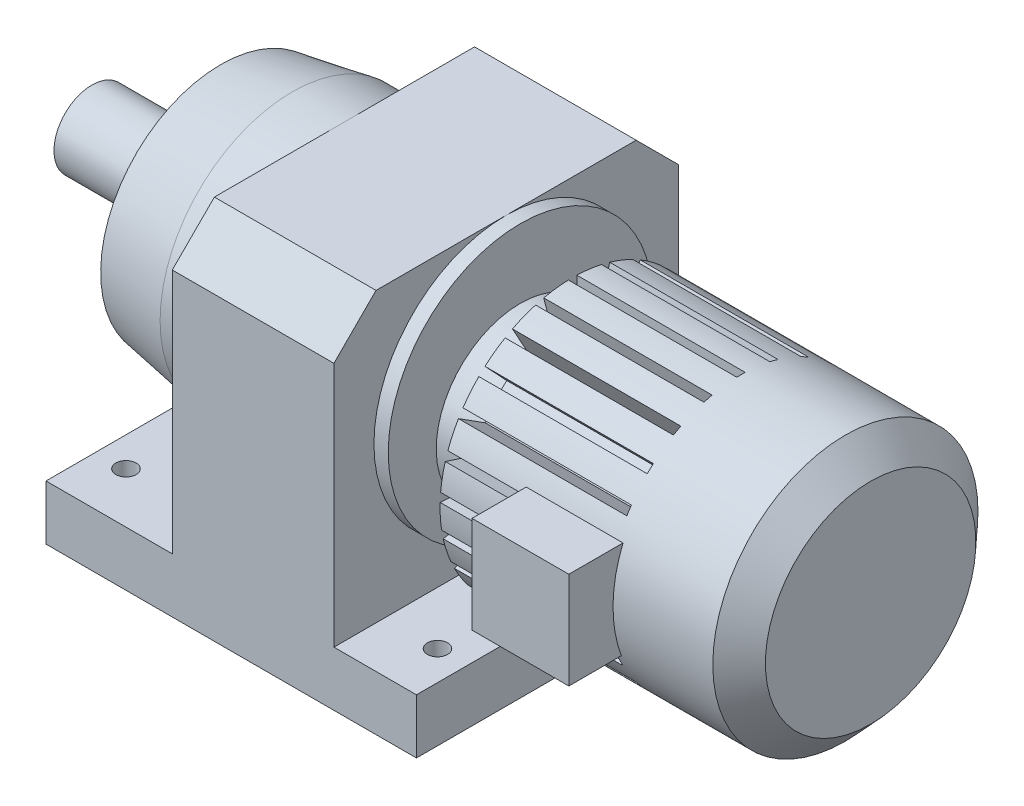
ISO-10303-21;
HEADER;
FILE_DESCRIPTION(('STEP AP214'),'2;1');
FILE_NAME('part.step','',(''),(''),'','','');
FILE_SCHEMA(('AUTOMOTIVE_DESIGN { 1 0 10303 214 1 1 1 1 }'));
ENDSEC;
DATA;
#1=APPLICATION_CONTEXT('core data for automotive mechanical design processes');
#2=APPLICATION_PROTOCOL_DEFINITION('international standard','automotive_design',2000,#1);
#3=PRODUCT_CONTEXT('',#1,'mechanical');
#4=PRODUCT('Part','Part','',(#3));
#5=PRODUCT_RELATED_PRODUCT_CATEGORY('part','',(#4));
#6=PRODUCT_DEFINITION_FORMATION('','',#4);
#7=PRODUCT_DEFINITION_CONTEXT('part definition',#1,'design');
#8=PRODUCT_DEFINITION('design','',#6,#7);
#9=PRODUCT_DEFINITION_SHAPE('','',#8);
#10=(LENGTH_UNIT() NAMED_UNIT(*) SI_UNIT(.MILLI.,.METRE.));
#11=(NAMED_UNIT(*) PLANE_ANGLE_UNIT() SI_UNIT($,.RADIAN.));
#12=(NAMED_UNIT(*) SI_UNIT($,.STERADIAN.) SOLID_ANGLE_UNIT());
#13=UNCERTAINTY_MEASURE_WITH_UNIT(LENGTH_MEASURE(1.E-05),#10,'distance_accuracy_value','');
#14=(GEOMETRIC_REPRESENTATION_CONTEXT(3) GLOBAL_UNCERTAINTY_ASSIGNED_CONTEXT((#13)) GLOBAL_UNIT_ASSIGNED_CONTEXT((#10,
#11,#12)) REPRESENTATION_CONTEXT('',''));
#15=CARTESIAN_POINT('',(0.,0.,0.));
#16=DIRECTION('',(0.,0.,1.));
#17=DIRECTION('',(1.,0.,0.));
#18=AXIS2_PLACEMENT_3D('',#15,#16,#17);
#19=CARTESIAN_POINT('',(668.78280778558,-0.959333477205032,0.));
#20=DIRECTION('',(1.,0.,0.));
#21=DIRECTION('',(0.,1.,0.));
#22=AXIS2_PLACEMENT_3D('',#19,#20,#21);
#23=CYLINDRICAL_SURFACE('',#22,157.5);
#24=CARTESIAN_POINT('',(405.28280778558,-0.959333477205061,0.));
#25=DIRECTION('',(-1.,0.,0.));
#26=DIRECTION('',(0.,0.,1.));
#27=AXIS2_PLACEMENT_3D('',#24,#25,#26);
#28=CIRCLE('',#27,157.5);
#29=CARTESIAN_POINT('',(405.28280778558,-55.9348806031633,147.593831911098));
#30=VERTEX_POINT('',#29);
#31=CARTESIAN_POINT('',(405.28280778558,-35.368451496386,153.69535645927));
#32=VERTEX_POINT('',#31);
#33=EDGE_CURVE('E1878',#30,#32,#28,.T.);
#34=ORIENTED_EDGE('',*,*,#33,.T.);
#35=DIRECTION('',(1.,0.,0.));
#36=VECTOR('',#35,1.);
#37=CARTESIAN_POINT('',(668.78280778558,-35.3684514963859,153.69535645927));
#38=LINE('',#37,#36);
#39=CARTESIAN_POINT('',(314.78280778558,-35.368451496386,153.69535645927));
#40=VERTEX_POINT('',#39);
#41=EDGE_CURVE('E1551',#40,#32,#38,.T.);
#42=ORIENTED_EDGE('',*,*,#41,.F.);
#43=CARTESIAN_POINT('',(314.78280778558,-0.959333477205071,0.));
#44=DIRECTION('',(1.,0.,0.));
#45=DIRECTION('',(0.,1.,0.));
#46=AXIS2_PLACEMENT_3D('',#43,#44,#45);
#47=CIRCLE('',#46,157.5);
#48=CARTESIAN_POINT('',(314.78280778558,-63.4616361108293,144.56732744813));
#49=VERTEX_POINT('',#48);
#50=EDGE_CURVE('E1735',#40,#49,#47,.T.);
#51=ORIENTED_EDGE('',*,*,#50,.T.);
#52=DIRECTION('',(1.,0.,0.));
#53=VECTOR('',#52,1.);
#54=CARTESIAN_POINT('',(668.78280778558,-63.4616361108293,144.56732744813));
#55=LINE('',#54,#53);
#56=CARTESIAN_POINT('',(514.78280778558,-63.4616361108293,144.56732744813));
#57=VERTEX_POINT('',#56);
#58=EDGE_CURVE('E1564',#49,#57,#55,.T.);
#59=ORIENTED_EDGE('',*,*,#58,.T.);
#60=CARTESIAN_POINT('',(514.78280778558,-0.959333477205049,0.));
#61=DIRECTION('',(1.,0.,0.));
#62=DIRECTION('',(0.,0.,-1.));
#63=AXIS2_PLACEMENT_3D('',#60,#61,#62);
#64=CIRCLE('',#63,157.5);
#65=CARTESIAN_POINT('',(514.78280778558,-72.5099066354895,140.309534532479));
#66=VERTEX_POINT('',#65);
#67=EDGE_CURVE('E1562',#66,#57,#64,.F.);
#68=ORIENTED_EDGE('',*,*,#67,.F.);
#69=DIRECTION('',(1.,0.,0.));
#70=VECTOR('',#69,1.);
#71=CARTESIAN_POINT('',(668.78280778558,-72.5099066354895,140.309534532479));
#72=LINE('',#71,#70);
#73=CARTESIAN_POINT('',(314.78280778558,-72.5099066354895,140.309534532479));
#74=VERTEX_POINT('',#73);
#75=EDGE_CURVE('E1560',#74,#66,#72,.T.);
#76=ORIENTED_EDGE('',*,*,#75,.F.);
#77=CARTESIAN_POINT('',(314.78280778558,-97.4504436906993,124.481788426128));
#78=VERTEX_POINT('',#77);
#79=EDGE_CURVE('E1739',#74,#78,#47,.T.);
#80=ORIENTED_EDGE('',*,*,#79,.T.);
#81=DIRECTION('',(1.,0.,0.));
#82=VECTOR('',#81,1.);
#83=CARTESIAN_POINT('',(668.78280778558,-97.4504436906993,124.481788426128));
#84=LINE('',#83,#82);
#85=CARTESIAN_POINT('',(514.78280778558,-97.4504436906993,124.481788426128));
#86=VERTEX_POINT('',#85);
#87=EDGE_CURVE('E1571',#78,#86,#84,.T.);
#88=ORIENTED_EDGE('',*,*,#87,.T.);
#89=CARTESIAN_POINT('',(514.78280778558,-0.959333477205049,0.));
#90=DIRECTION('',(1.,0.,0.));
#91=DIRECTION('',(0.,0.,-1.));
#92=AXIS2_PLACEMENT_3D('',#89,#90,#91);
#93=CIRCLE('',#92,157.5);
#94=CARTESIAN_POINT('',(514.78280778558,-105.155576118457,118.107548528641));
#95=VERTEX_POINT('',#94);
#96=EDGE_CURVE('E1569',#95,#86,#93,.F.);
#97=ORIENTED_EDGE('',*,*,#96,.F.);
#98=DIRECTION('',(1.,0.,0.));
#99=VECTOR('',#98,1.);
#100=CARTESIAN_POINT('',(668.78280778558,-105.155576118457,118.107548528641));
#101=LINE('',#100,#99);
#102=CARTESIAN_POINT('',(314.78280778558,-105.155576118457,118.107548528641));
#103=VERTEX_POINT('',#102);
#104=EDGE_CURVE('E1567',#103,#95,#101,.T.);
#105=ORIENTED_EDGE('',*,*,#104,.F.);
#106=CARTESIAN_POINT('',(314.78280778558,-125.376359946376,96.574600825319));
#107=VERTEX_POINT('',#106);
#108=EDGE_CURVE('E1743',#103,#107,#47,.T.);
#109=ORIENTED_EDGE('',*,*,#108,.T.);
#110=DIRECTION('',(1.,0.,0.));
#111=VECTOR('',#110,1.);
#112=CARTESIAN_POINT('',(668.78280778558,-125.376359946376,96.574600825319));
#113=LINE('',#112,#111);
#114=CARTESIAN_POINT('',(514.78280778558,-125.376359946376,96.574600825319));
#115=VERTEX_POINT('',#114);
#116=EDGE_CURVE('E1578',#107,#115,#113,.T.);
#117=ORIENTED_EDGE('',*,*,#116,.T.);
#118=CARTESIAN_POINT('',(514.78280778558,-0.959333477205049,0.));
#119=DIRECTION('',(1.,0.,0.));
#120=DIRECTION('',(0.,1.,0.));
#121=AXIS2_PLACEMENT_3D('',#118,#119,#120);
#122=CIRCLE('',#121,157.5);
#123=CARTESIAN_POINT('',(514.78280778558,-131.2542124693,88.4844308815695));
#124=VERTEX_POINT('',#123);
#125=EDGE_CURVE('E1576',#124,#115,#122,.F.);
#126=ORIENTED_EDGE('',*,*,#125,.F.);
#127=DIRECTION('',(1.,0.,0.));
#128=VECTOR('',#127,1.);
#129=CARTESIAN_POINT('',(668.78280778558,-131.2542124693,88.4844308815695));
#130=LINE('',#129,#128);
#131=CARTESIAN_POINT('',(314.78280778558,-131.2542124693,88.4844308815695));
#132=VERTEX_POINT('',#131);
#133=EDGE_CURVE('E1574',#132,#124,#130,.T.);
#134=ORIENTED_EDGE('',*,*,#133,.F.);
#135=CARTESIAN_POINT('',(314.78280778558,-145.484696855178,62.5992758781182));
#136=VERTEX_POINT('',#135);
#137=EDGE_CURVE('E1747',#132,#136,#47,.T.);
#138=ORIENTED_EDGE('',*,*,#137,.T.);
#139=DIRECTION('',(1.,0.,0.));
#140=VECTOR('',#139,1.);
#141=CARTESIAN_POINT('',(668.78280778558,-145.484696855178,62.5992758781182));
#142=LINE('',#141,#140);
#143=CARTESIAN_POINT('',(514.78280778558,-145.484696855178,62.5992758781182));
#144=VERTEX_POINT('',#143);
#145=EDGE_CURVE('E1585',#136,#144,#142,.T.);
#146=ORIENTED_EDGE('',*,*,#145,.T.);
#147=CARTESIAN_POINT('',(514.78280778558,-0.959333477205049,0.));
#148=DIRECTION('',(1.,0.,0.));
#149=DIRECTION('',(0.,1.,0.));
#150=AXIS2_PLACEMENT_3D('',#147,#148,#149);
#151=CIRCLE('',#150,157.5);
#152=CARTESIAN_POINT('',(514.78280778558,-149.165942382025,53.3015110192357));
#153=VERTEX_POINT('',#152);
#154=EDGE_CURVE('E1583',#153,#144,#151,.F.);
#155=ORIENTED_EDGE('',*,*,#154,.F.);
#156=DIRECTION('',(1.,0.,0.));
#157=VECTOR('',#156,1.);
#158=CARTESIAN_POINT('',(668.78280778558,-149.165942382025,53.3015110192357));
#159=LINE('',#158,#157);
#160=CARTESIAN_POINT('',(314.78280778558,-149.165942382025,53.3015110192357));
#161=VERTEX_POINT('',#160);
#162=EDGE_CURVE('E1581',#161,#153,#159,.T.);
#163=ORIENTED_EDGE('',*,*,#162,.F.);
#164=CARTESIAN_POINT('',(314.78280778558,-156.511973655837,24.6906082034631));
#165=VERTEX_POINT('',#164);
#166=EDGE_CURVE('E1751',#161,#165,#47,.T.);
#167=ORIENTED_EDGE('',*,*,#166,.T.);
#168=DIRECTION('',(1.,0.,0.));
#169=VECTOR('',#168,1.);
#170=CARTESIAN_POINT('',(668.78280778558,-156.511973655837,24.6906082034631));
#171=LINE('',#170,#169);
#172=CARTESIAN_POINT('',(514.78280778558,-156.511973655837,24.6906082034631));
#173=VERTEX_POINT('',#172);
#174=EDGE_CURVE('E1592',#165,#173,#171,.T.);
#175=ORIENTED_EDGE('',*,*,#174,.T.);
#176=CARTESIAN_POINT('',(514.78280778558,-0.959333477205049,0.));
#177=DIRECTION('',(1.,0.,0.));
#178=DIRECTION('',(0.,1.,0.));
#179=AXIS2_PLACEMENT_3D('',#176,#177,#178);
#180=CIRCLE('',#179,157.5);
#181=CARTESIAN_POINT('',(514.78280778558,-157.76530599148,14.7694611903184));
#182=VERTEX_POINT('',#181);
#183=EDGE_CURVE('E1590',#182,#173,#180,.F.);
#184=ORIENTED_EDGE('',*,*,#183,.F.);
#185=DIRECTION('',(1.,0.,0.));
#186=VECTOR('',#185,1.);
#187=CARTESIAN_POINT('',(668.78280778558,-157.76530599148,14.7694611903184));
#188=LINE('',#187,#186);
#189=CARTESIAN_POINT('',(314.78280778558,-157.76530599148,14.7694611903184));
#190=VERTEX_POINT('',#189);
#191=EDGE_CURVE('E1588',#190,#182,#188,.T.);
#192=ORIENTED_EDGE('',*,*,#191,.F.);
#193=CARTESIAN_POINT('',(314.78280778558,-157.76530599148,-14.7694611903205));
#194=VERTEX_POINT('',#193);
#195=EDGE_CURVE('E1755',#190,#194,#47,.T.);
#196=ORIENTED_EDGE('',*,*,#195,.T.);
#197=DIRECTION('',(1.,0.,0.));
#198=VECTOR('',#197,1.);
#199=CARTESIAN_POINT('',(668.78280778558,-157.76530599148,-14.7694611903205));
#200=LINE('',#199,#198);
#201=CARTESIAN_POINT('',(514.78280778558,-157.76530599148,-14.7694611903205));
#202=VERTEX_POINT('',#201);
#203=EDGE_CURVE('E1513',#194,#202,#200,.T.);
#204=ORIENTED_EDGE('',*,*,#203,.T.);
#205=CARTESIAN_POINT('',(514.78280778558,-0.959333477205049,0.));
#206=DIRECTION('',(1.,0.,0.));
#207=DIRECTION('',(0.,1.,0.));
#208=AXIS2_PLACEMENT_3D('',#205,#206,#207);
#209=CIRCLE('',#208,157.5);
#210=CARTESIAN_POINT('',(514.78280778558,-156.511973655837,-24.6906082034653));
#211=VERTEX_POINT('',#210);
#212=EDGE_CURVE('E1511',#211,#202,#209,.F.);
#213=ORIENTED_EDGE('',*,*,#212,.F.);
#214=DIRECTION('',(1.,0.,0.));
#215=VECTOR('',#214,1.);
#216=CARTESIAN_POINT('',(668.78280778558,-156.511973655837,-24.6906082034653));
#217=LINE('',#216,#215);
#218=CARTESIAN_POINT('',(314.78280778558,-156.511973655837,-24.6906082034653));
#219=VERTEX_POINT('',#218);
#220=EDGE_CURVE('E1509',#219,#211,#217,.T.);
#221=ORIENTED_EDGE('',*,*,#220,.F.);
#222=CARTESIAN_POINT('',(314.78280778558,-149.165942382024,-53.3015110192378));
#223=VERTEX_POINT('',#222);
#224=EDGE_CURVE('E1759',#219,#223,#47,.T.);
#225=ORIENTED_EDGE('',*,*,#224,.T.);
#226=DIRECTION('',(1.,0.,0.));
#227=VECTOR('',#226,1.);
#228=CARTESIAN_POINT('',(668.78280778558,-149.165942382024,-53.3015110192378));
#229=LINE('',#228,#227);
#230=CARTESIAN_POINT('',(514.78280778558,-149.165942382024,-53.3015110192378));
#231=VERTEX_POINT('',#230);
#232=EDGE_CURVE('E1520',#223,#231,#229,.T.);
#233=ORIENTED_EDGE('',*,*,#232,.T.);
#234=CARTESIAN_POINT('',(514.78280778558,-0.959333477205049,0.));
#235=DIRECTION('',(1.,0.,0.));
#236=DIRECTION('',(0.,1.,0.));
#237=AXIS2_PLACEMENT_3D('',#234,#235,#236);
#238=CIRCLE('',#237,157.5);
#239=CARTESIAN_POINT('',(514.78280778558,-145.484696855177,-62.5992758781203));
#240=VERTEX_POINT('',#239);
#241=EDGE_CURVE('E1518',#240,#231,#238,.F.);
#242=ORIENTED_EDGE('',*,*,#241,.F.);
#243=DIRECTION('',(1.,0.,0.));
#244=VECTOR('',#243,1.);
#245=CARTESIAN_POINT('',(668.78280778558,-145.484696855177,-62.5992758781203));
#246=LINE('',#245,#244);
#247=CARTESIAN_POINT('',(314.78280778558,-145.484696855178,-62.5992758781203));
#248=VERTEX_POINT('',#247);
#249=EDGE_CURVE('E1516',#248,#240,#246,.T.);
#250=ORIENTED_EDGE('',*,*,#249,.F.);
#251=CARTESIAN_POINT('',(314.78280778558,-131.254212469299,-88.4844308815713));
#252=VERTEX_POINT('',#251);
#253=EDGE_CURVE('E1763',#248,#252,#47,.T.);
#254=ORIENTED_EDGE('',*,*,#253,.T.);
#255=DIRECTION('',(1.,0.,0.));
#256=VECTOR('',#255,1.);
#257=CARTESIAN_POINT('',(668.78280778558,-131.254212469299,-88.4844308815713));
#258=LINE('',#257,#256);
#259=CARTESIAN_POINT('',(514.78280778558,-131.254212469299,-88.4844308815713));
#260=VERTEX_POINT('',#259);
#261=EDGE_CURVE('E1527',#252,#260,#258,.T.);
#262=ORIENTED_EDGE('',*,*,#261,.T.);
#263=CARTESIAN_POINT('',(514.78280778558,-0.959333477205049,0.));
#264=DIRECTION('',(1.,0.,0.));
#265=DIRECTION('',(0.,1.,0.));
#266=AXIS2_PLACEMENT_3D('',#263,#264,#265);
#267=CIRCLE('',#266,157.5);
#268=CARTESIAN_POINT('',(514.78280778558,-125.376359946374,-96.5746008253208));
#269=VERTEX_POINT('',#268);
#270=EDGE_CURVE('E1525',#269,#260,#267,.F.);
#271=ORIENTED_EDGE('',*,*,#270,.F.);
#272=DIRECTION('',(1.,0.,0.));
#273=VECTOR('',#272,1.);
#274=CARTESIAN_POINT('',(668.78280778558,-125.376359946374,-96.5746008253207));
#275=LINE('',#274,#273);
#276=CARTESIAN_POINT('',(314.78280778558,-125.376359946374,-96.5746008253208));
#277=VERTEX_POINT('',#276);
#278=EDGE_CURVE('E1523',#277,#269,#275,.T.);
#279=ORIENTED_EDGE('',*,*,#278,.F.);
#280=CARTESIAN_POINT('',(314.78280778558,-105.155576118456,-118.107548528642));
#281=VERTEX_POINT('',#280);
#282=EDGE_CURVE('E1767',#277,#281,#47,.T.);
#283=ORIENTED_EDGE('',*,*,#282,.T.);
#284=DIRECTION('',(1.,0.,0.));
#285=VECTOR('',#284,1.);
#286=CARTESIAN_POINT('',(668.78280778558,-105.155576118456,-118.107548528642));
#287=LINE('',#286,#285);
#288=CARTESIAN_POINT('',(514.78280778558,-105.155576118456,-118.107548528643));
#289=VERTEX_POINT('',#288);
#290=EDGE_CURVE('E1534',#281,#289,#287,.T.);
#291=ORIENTED_EDGE('',*,*,#290,.T.);
#292=CARTESIAN_POINT('',(514.78280778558,-0.959333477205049,0.));
#293=DIRECTION('',(1.,0.,0.));
#294=DIRECTION('',(0.,0.,-1.));
#295=AXIS2_PLACEMENT_3D('',#292,#293,#294);
#296=CIRCLE('',#295,157.5);
#297=CARTESIAN_POINT('',(514.78280778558,-97.4504436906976,-124.481788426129));
#298=VERTEX_POINT('',#297);
#299=EDGE_CURVE('E1532',#298,#289,#296,.F.);
#300=ORIENTED_EDGE('',*,*,#299,.F.);
#301=DIRECTION('',(1.,0.,0.));
#302=VECTOR('',#301,1.);
#303=CARTESIAN_POINT('',(668.78280778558,-97.4504436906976,-124.481788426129));
#304=LINE('',#303,#302);
#305=CARTESIAN_POINT('',(314.78280778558,-97.4504436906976,-124.481788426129));
#306=VERTEX_POINT('',#305);
#307=EDGE_CURVE('E1530',#306,#298,#304,.T.);
#308=ORIENTED_EDGE('',*,*,#307,.F.);
#309=CARTESIAN_POINT('',(314.78280778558,-72.5099066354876,-140.30953453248));
#310=VERTEX_POINT('',#309);
#311=EDGE_CURVE('E1771',#306,#310,#47,.T.);
#312=ORIENTED_EDGE('',*,*,#311,.T.);
#313=DIRECTION('',(1.,0.,0.));
#314=VECTOR('',#313,1.);
#315=CARTESIAN_POINT('',(668.78280778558,-72.5099066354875,-140.30953453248));
#316=LINE('',#315,#314);
#317=CARTESIAN_POINT('',(514.78280778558,-72.5099066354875,-140.30953453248));
#318=VERTEX_POINT('',#317);
#319=EDGE_CURVE('E1541',#310,#318,#316,.T.);
#320=ORIENTED_EDGE('',*,*,#319,.T.);
#321=CARTESIAN_POINT('',(514.78280778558,-0.959333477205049,0.));
#322=DIRECTION('',(1.,0.,0.));
#323=DIRECTION('',(0.,0.,-1.));
#324=AXIS2_PLACEMENT_3D('',#321,#322,#323);
#325=CIRCLE('',#324,157.5);
#326=CARTESIAN_POINT('',(514.78280778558,-63.4616361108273,-144.567327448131));
#327=VERTEX_POINT('',#326);
#328=EDGE_CURVE('E1539',#327,#318,#325,.F.);
#329=ORIENTED_EDGE('',*,*,#328,.F.);
#330=DIRECTION('',(1.,0.,0.));
#331=VECTOR('',#330,1.);
#332=CARTESIAN_POINT('',(668.78280778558,-63.4616361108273,-144.567327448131));
#333=LINE('',#332,#331);
#334=CARTESIAN_POINT('',(314.78280778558,-63.4616361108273,-144.567327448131));
#335=VERTEX_POINT('',#334);
#336=EDGE_CURVE('E1537',#335,#327,#333,.T.);
#337=ORIENTED_EDGE('',*,*,#336,.F.);
#338=CARTESIAN_POINT('',(314.78280778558,-35.3684514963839,-153.69535645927));
#339=VERTEX_POINT('',#338);
#340=EDGE_CURVE('E1775',#335,#339,#47,.T.);
#341=ORIENTED_EDGE('',*,*,#340,.T.);
#342=DIRECTION('',(1.,0.,0.));
#343=VECTOR('',#342,1.);
#344=CARTESIAN_POINT('',(668.78280778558,-35.3684514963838,-153.69535645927));
#345=LINE('',#344,#343);
#346=CARTESIAN_POINT('',(514.78280778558,-35.3684514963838,-153.69535645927));
#347=VERTEX_POINT('',#346);
#348=EDGE_CURVE('E1548',#339,#347,#345,.T.);
#349=ORIENTED_EDGE('',*,*,#348,.T.);
#350=CARTESIAN_POINT('',(514.78280778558,-0.959333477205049,0.));
#351=DIRECTION('',(1.,0.,0.));
#352=DIRECTION('',(0.,0.,-1.));
#353=AXIS2_PLACEMENT_3D('',#350,#351,#352);
#354=CIRCLE('',#353,157.5);
#355=CARTESIAN_POINT('',(514.78280778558,-25.5455789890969,-155.569169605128));
#356=VERTEX_POINT('',#355);
#357=EDGE_CURVE('E1546',#356,#347,#354,.F.);
#358=ORIENTED_EDGE('',*,*,#357,.F.);
#359=DIRECTION('',(1.,0.,0.));
#360=VECTOR('',#359,1.);
#361=CARTESIAN_POINT('',(668.78280778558,-25.5455789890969,-155.569169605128));
#362=LINE('',#361,#360);
#363=CARTESIAN_POINT('',(314.78280778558,-25.5455789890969,-155.569169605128));
#364=VERTEX_POINT('',#363);
#365=EDGE_CURVE('E1544',#364,#356,#362,.T.);
#366=ORIENTED_EDGE('',*,*,#365,.F.);
#367=CARTESIAN_POINT('',(314.78280778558,3.93505507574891,-157.423933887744));
#368=VERTEX_POINT('',#367);
#369=EDGE_CURVE('E1779',#364,#368,#47,.T.);
#370=ORIENTED_EDGE('',*,*,#369,.T.);
#371=DIRECTION('',(1.,0.,0.));
#372=VECTOR('',#371,1.);
#373=CARTESIAN_POINT('',(668.78280778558,3.93505507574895,-157.423933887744));
#374=LINE('',#373,#372);
#375=CARTESIAN_POINT('',(514.78280778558,3.93505507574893,-157.423933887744));
#376=VERTEX_POINT('',#375);
#377=EDGE_CURVE('E1471',#368,#376,#374,.T.);
#378=ORIENTED_EDGE('',*,*,#377,.T.);
#379=CARTESIAN_POINT('',(514.78280778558,-0.959333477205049,0.));
#380=DIRECTION('',(1.,0.,0.));
#381=DIRECTION('',(0.,0.,-1.));
#382=AXIS2_PLACEMENT_3D('',#379,#380,#381);
#383=CIRCLE('',#382,157.5);
#384=CARTESIAN_POINT('',(514.78280778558,13.9153223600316,-156.79602869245));
#385=VERTEX_POINT('',#384);
#386=EDGE_CURVE('E1469',#385,#376,#383,.F.);
#387=ORIENTED_EDGE('',*,*,#386,.F.);
#388=DIRECTION('',(1.,0.,0.));
#389=VECTOR('',#388,1.);
#390=CARTESIAN_POINT('',(668.78280778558,13.9153223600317,-156.79602869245));
#391=LINE('',#390,#389);
#392=CARTESIAN_POINT('',(314.78280778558,13.9153223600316,-156.79602869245));
#393=VERTEX_POINT('',#392);
#394=EDGE_CURVE('E1467',#393,#385,#391,.T.);
#395=ORIENTED_EDGE('',*,*,#394,.F.);
#396=CARTESIAN_POINT('',(314.78280778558,42.9310292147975,-151.26098658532));
#397=VERTEX_POINT('',#396);
#398=EDGE_CURVE('E1783',#393,#397,#47,.T.);
#399=ORIENTED_EDGE('',*,*,#398,.T.);
#400=DIRECTION('',(1.,0.,0.));
#401=VECTOR('',#400,1.);
#402=CARTESIAN_POINT('',(668.78280778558,42.9310292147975,-151.26098658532));
#403=LINE('',#402,#401);
#404=CARTESIAN_POINT('',(514.78280778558,42.9310292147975,-151.26098658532));
#405=VERTEX_POINT('',#404);
#406=EDGE_CURVE('E1478',#397,#405,#403,.T.);
#407=ORIENTED_EDGE('',*,*,#406,.T.);
#408=CARTESIAN_POINT('',(514.78280778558,-0.959333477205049,0.));
#409=DIRECTION('',(1.,0.,0.));
#410=DIRECTION('',(0.,0.,-1.));
#411=AXIS2_PLACEMENT_3D('',#408,#409,#410);
#412=CIRCLE('',#411,157.5);
#413=CARTESIAN_POINT('',(514.78280778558,52.441594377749,-148.170816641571));
#414=VERTEX_POINT('',#413);
#415=EDGE_CURVE('E1476',#414,#405,#412,.F.);
#416=ORIENTED_EDGE('',*,*,#415,.F.);
#417=DIRECTION('',(1.,0.,0.));
#418=VECTOR('',#417,1.);
#419=CARTESIAN_POINT('',(668.78280778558,52.441594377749,-148.170816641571));
#420=LINE('',#419,#418);
#421=CARTESIAN_POINT('',(314.78280778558,52.441594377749,-148.170816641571));
#422=VERTEX_POINT('',#421);
#423=EDGE_CURVE('E1474',#422,#414,#420,.T.);
#424=ORIENTED_EDGE('',*,*,#423,.F.);
#425=CARTESIAN_POINT('',(314.78280778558,79.1692104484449,-135.593755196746));
#426=VERTEX_POINT('',#425);
#427=EDGE_CURVE('E1787',#422,#426,#47,.T.);
#428=ORIENTED_EDGE('',*,*,#427,.T.);
#429=DIRECTION('',(1.,0.,0.));
#430=VECTOR('',#429,1.);
#431=CARTESIAN_POINT('',(668.78280778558,79.1692104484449,-135.593755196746));
#432=LINE('',#431,#430);
#433=CARTESIAN_POINT('',(514.78280778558,79.1692104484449,-135.593755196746));
#434=VERTEX_POINT('',#433);
#435=EDGE_CURVE('E1485',#426,#434,#432,.T.);
#436=ORIENTED_EDGE('',*,*,#435,.T.);
#437=CARTESIAN_POINT('',(514.78280778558,-0.959333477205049,0.));
#438=DIRECTION('',(1.,0.,0.));
#439=DIRECTION('',(0.,0.,-1.));
#440=AXIS2_PLACEMENT_3D('',#437,#438,#439);
#441=CIRCLE('',#440,157.5);
#442=CARTESIAN_POINT('',(514.78280778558,87.612489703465,-130.235487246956));
#443=VERTEX_POINT('',#442);
#444=EDGE_CURVE('E1483',#443,#434,#441,.F.);
#445=ORIENTED_EDGE('',*,*,#444,.F.);
#446=DIRECTION('',(1.,0.,0.));
#447=VECTOR('',#446,1.);
#448=CARTESIAN_POINT('',(668.78280778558,87.612489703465,-130.235487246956));
#449=LINE('',#448,#447);
#450=CARTESIAN_POINT('',(314.78280778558,87.612489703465,-130.235487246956));
#451=VERTEX_POINT('',#450);
#452=EDGE_CURVE('E1481',#451,#443,#449,.T.);
#453=ORIENTED_EDGE('',*,*,#452,.F.);
#454=CARTESIAN_POINT('',(314.78280778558,110.372620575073,-111.406669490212));
#455=VERTEX_POINT('',#454);
#456=EDGE_CURVE('E1791',#451,#455,#47,.T.);
#457=ORIENTED_EDGE('',*,*,#456,.T.);
#458=DIRECTION('',(1.,0.,0.));
#459=VECTOR('',#458,1.);
#460=CARTESIAN_POINT('',(668.78280778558,110.372620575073,-111.406669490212));
#461=LINE('',#460,#459);
#462=CARTESIAN_POINT('',(514.78280778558,110.372620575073,-111.406669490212));
#463=VERTEX_POINT('',#462);
#464=EDGE_CURVE('E1506',#455,#463,#461,.T.);
#465=ORIENTED_EDGE('',*,*,#464,.T.);
#466=CARTESIAN_POINT('',(514.78280778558,-0.959333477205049,0.));
#467=DIRECTION('',(1.,0.,0.));
#468=DIRECTION('',(0.,1.,0.));
#469=AXIS2_PLACEMENT_3D('',#466,#467,#468);
#470=CIRCLE('',#469,157.5);
#471=CARTESIAN_POINT('',(514.78280778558,117.21809163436,-104.116983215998));
#472=VERTEX_POINT('',#471);
#473=EDGE_CURVE('E1504',#472,#463,#470,.F.);
#474=ORIENTED_EDGE('',*,*,#473,.F.);
#475=DIRECTION('',(1.,0.,0.));
#476=VECTOR('',#475,1.);
#477=CARTESIAN_POINT('',(668.78280778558,117.21809163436,-104.116983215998));
#478=LINE('',#477,#476);
#479=CARTESIAN_POINT('',(314.78280778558,117.21809163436,-104.116983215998));
#480=VERTEX_POINT('',#479);
#481=EDGE_CURVE('E1502',#480,#472,#478,.T.);
#482=ORIENTED_EDGE('',*,*,#481,.F.);
#483=CARTESIAN_POINT('',(314.78280778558,134.580634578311,-80.2194930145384));
#484=VERTEX_POINT('',#483);
#485=EDGE_CURVE('E1795',#480,#484,#47,.T.);
#486=ORIENTED_EDGE('',*,*,#485,.T.);
#487=DIRECTION('',(1.,0.,0.));
#488=VECTOR('',#487,1.);
#489=CARTESIAN_POINT('',(668.78280778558,134.580634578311,-80.2194930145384));
#490=LINE('',#489,#488);
#491=CARTESIAN_POINT('',(514.78280778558,134.580634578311,-80.2194930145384));
#492=VERTEX_POINT('',#491);
#493=EDGE_CURVE('E1499',#484,#492,#490,.T.);
#494=ORIENTED_EDGE('',*,*,#493,.T.);
#495=CARTESIAN_POINT('',(514.78280778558,-0.959333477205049,0.));
#496=DIRECTION('',(1.,0.,0.));
#497=DIRECTION('',(0.,1.,0.));
#498=AXIS2_PLACEMENT_3D('',#495,#496,#497);
#499=CIRCLE('',#498,157.5);
#500=CARTESIAN_POINT('',(514.78280778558,139.398171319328,-71.4564262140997));
#501=VERTEX_POINT('',#500);
#502=EDGE_CURVE('E1497',#501,#492,#499,.F.);
#503=ORIENTED_EDGE('',*,*,#502,.F.);
#504=DIRECTION('',(1.,0.,0.));
#505=VECTOR('',#504,1.);
#506=CARTESIAN_POINT('',(668.78280778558,139.398171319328,-71.4564262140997));
#507=LINE('',#506,#505);
#508=CARTESIAN_POINT('',(314.78280778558,139.398171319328,-71.4564262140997));
#509=VERTEX_POINT('',#508);
#510=EDGE_CURVE('E1495',#509,#501,#507,.T.);
#511=ORIENTED_EDGE('',*,*,#510,.F.);
#512=CARTESIAN_POINT('',(314.78280778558,150.272173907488,-43.9918307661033));
#513=VERTEX_POINT('',#512);
#514=EDGE_CURVE('E1799',#509,#513,#47,.T.);
#515=ORIENTED_EDGE('',*,*,#514,.T.);
#516=DIRECTION('',(1.,0.,0.));
#517=VECTOR('',#516,1.);
#518=CARTESIAN_POINT('',(668.78280778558,150.272173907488,-43.9918307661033));
#519=LINE('',#518,#517);
#520=CARTESIAN_POINT('',(514.78280778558,150.272173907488,-43.9918307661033));
#521=VERTEX_POINT('',#520);
#522=EDGE_CURVE('E1492',#513,#521,#519,.T.);
#523=ORIENTED_EDGE('',*,*,#522,.T.);
#524=CARTESIAN_POINT('',(514.78280778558,-0.959333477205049,0.));
#525=DIRECTION('',(1.,0.,0.));
#526=DIRECTION('',(0.,1.,0.));
#527=AXIS2_PLACEMENT_3D('',#524,#525,#526);
#528=CIRCLE('',#527,157.5);
#529=CARTESIAN_POINT('',(514.78280778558,152.759072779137,-34.3059991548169));
#530=VERTEX_POINT('',#529);
#531=EDGE_CURVE('E1490',#530,#521,#528,.F.);
#532=ORIENTED_EDGE('',*,*,#531,.F.);
#533=DIRECTION('',(1.,0.,0.));
#534=VECTOR('',#533,1.);
#535=CARTESIAN_POINT('',(668.78280778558,152.759072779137,-34.305999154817));
#536=LINE('',#535,#534);
#537=CARTESIAN_POINT('',(314.78280778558,152.759072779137,-34.305999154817));
#538=VERTEX_POINT('',#537);
#539=EDGE_CURVE('E1488',#538,#530,#536,.T.);
#540=ORIENTED_EDGE('',*,*,#539,.F.);
#541=CARTESIAN_POINT('',(314.78280778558,156.461281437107,-5.));
#542=VERTEX_POINT('',#541);
#543=EDGE_CURVE('E1415',#538,#542,#47,.T.);
#544=ORIENTED_EDGE('',*,*,#543,.T.);
#545=DIRECTION('',(1.,0.,0.));
#546=VECTOR('',#545,1.);
#547=CARTESIAN_POINT('',(668.78280778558,156.461281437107,-5.));
#548=LINE('',#547,#546);
#549=CARTESIAN_POINT('',(514.78280778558,156.461281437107,-5.));
#550=VERTEX_POINT('',#549);
#551=EDGE_CURVE('E1457',#542,#550,#548,.T.);
#552=ORIENTED_EDGE('',*,*,#551,.T.);
#553=CARTESIAN_POINT('',(514.78280778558,-0.959333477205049,0.));
#554=DIRECTION('',(1.,0.,0.));
#555=DIRECTION('',(0.,1.,0.));
#556=AXIS2_PLACEMENT_3D('',#553,#554,#555);
#557=CIRCLE('',#556,157.5);
#558=CARTESIAN_POINT('',(514.78280778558,156.461281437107,5.));
#559=VERTEX_POINT('',#558);
#560=EDGE_CURVE('E1455',#559,#550,#557,.F.);
#561=ORIENTED_EDGE('',*,*,#560,.F.);
#562=DIRECTION('',(1.,0.,0.));
#563=VECTOR('',#562,1.);
#564=CARTESIAN_POINT('',(668.78280778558,156.461281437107,5.));
#565=LINE('',#564,#563);
#566=CARTESIAN_POINT('',(314.78280778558,156.461281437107,5.));
#567=VERTEX_POINT('',#566);
#568=EDGE_CURVE('E1453',#567,#559,#565,.T.);
#569=ORIENTED_EDGE('',*,*,#568,.F.);
#570=CARTESIAN_POINT('',(314.78280778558,152.759072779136,34.3059991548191));
#571=VERTEX_POINT('',#570);
#572=EDGE_CURVE('E1416',#567,#571,#47,.T.);
#573=ORIENTED_EDGE('',*,*,#572,.T.);
#574=DIRECTION('',(1.,0.,0.));
#575=VECTOR('',#574,1.);
#576=CARTESIAN_POINT('',(668.78280778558,152.759072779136,34.3059991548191));
#577=LINE('',#576,#575);
#578=CARTESIAN_POINT('',(514.78280778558,152.759072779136,34.3059991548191));
#579=VERTEX_POINT('',#578);
#580=EDGE_CURVE('E1464',#571,#579,#577,.T.);
#581=ORIENTED_EDGE('',*,*,#580,.T.);
#582=CARTESIAN_POINT('',(514.78280778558,-0.959333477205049,0.));
#583=DIRECTION('',(1.,0.,0.));
#584=DIRECTION('',(0.,1.,0.));
#585=AXIS2_PLACEMENT_3D('',#582,#583,#584);
#586=CIRCLE('',#585,157.5);
#587=CARTESIAN_POINT('',(514.78280778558,150.272173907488,43.9918307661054));
#588=VERTEX_POINT('',#587);
#589=EDGE_CURVE('E1462',#588,#579,#586,.F.);
#590=ORIENTED_EDGE('',*,*,#589,.F.);
#591=DIRECTION('',(1.,0.,0.));
#592=VECTOR('',#591,1.);
#593=CARTESIAN_POINT('',(668.78280778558,150.272173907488,43.9918307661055));
#594=LINE('',#593,#592);
#595=CARTESIAN_POINT('',(314.78280778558,150.272173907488,43.9918307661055));
#596=VERTEX_POINT('',#595);
#597=EDGE_CURVE('E1460',#596,#588,#594,.T.);
#598=ORIENTED_EDGE('',*,*,#597,.F.);
#599=CARTESIAN_POINT('',(314.78280778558,139.398171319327,71.4564262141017));
#600=VERTEX_POINT('',#599);
#601=EDGE_CURVE('E1420',#596,#600,#47,.T.);
#602=ORIENTED_EDGE('',*,*,#601,.T.);
#603=DIRECTION('',(1.,0.,0.));
#604=VECTOR('',#603,1.);
#605=CARTESIAN_POINT('',(668.78280778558,139.398171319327,71.4564262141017));
#606=LINE('',#605,#604);
#607=CARTESIAN_POINT('',(514.78280778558,139.398171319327,71.4564262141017));
#608=VERTEX_POINT('',#607);
#609=EDGE_CURVE('E1606',#600,#608,#606,.T.);
#610=ORIENTED_EDGE('',*,*,#609,.T.);
#611=CARTESIAN_POINT('',(514.78280778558,-0.959333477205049,0.));
#612=DIRECTION('',(1.,0.,0.));
#613=DIRECTION('',(0.,1.,0.));
#614=AXIS2_PLACEMENT_3D('',#611,#612,#613);
#615=CIRCLE('',#614,157.5);
#616=CARTESIAN_POINT('',(514.78280778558,134.58063457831,80.2194930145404));
#617=VERTEX_POINT('',#616);
#618=EDGE_CURVE('E1604',#617,#608,#615,.F.);
#619=ORIENTED_EDGE('',*,*,#618,.F.);
#620=DIRECTION('',(1.,0.,0.));
#621=VECTOR('',#620,1.);
#622=CARTESIAN_POINT('',(668.78280778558,134.58063457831,80.2194930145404));
#623=LINE('',#622,#621);
#624=CARTESIAN_POINT('',(314.78280778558,134.58063457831,80.2194930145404));
#625=VERTEX_POINT('',#624);
#626=EDGE_CURVE('E1602',#625,#617,#623,.T.);
#627=ORIENTED_EDGE('',*,*,#626,.F.);
#628=CARTESIAN_POINT('',(314.78280778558,117.218091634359,104.116983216));
#629=VERTEX_POINT('',#628);
#630=EDGE_CURVE('E1845',#625,#629,#47,.T.);
#631=ORIENTED_EDGE('',*,*,#630,.T.);
#632=DIRECTION('',(1.,0.,0.));
#633=VECTOR('',#632,1.);
#634=CARTESIAN_POINT('',(668.78280778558,117.218091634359,104.116983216));
#635=LINE('',#634,#633);
#636=CARTESIAN_POINT('',(514.78280778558,117.218091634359,104.116983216));
#637=VERTEX_POINT('',#636);
#638=EDGE_CURVE('E1599',#629,#637,#635,.T.);
#639=ORIENTED_EDGE('',*,*,#638,.T.);
#640=CARTESIAN_POINT('',(514.78280778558,-0.959333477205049,0.));
#641=DIRECTION('',(1.,0.,0.));
#642=DIRECTION('',(0.,1.,0.));
#643=AXIS2_PLACEMENT_3D('',#640,#641,#642);
#644=CIRCLE('',#643,157.5);
#645=CARTESIAN_POINT('',(514.78280778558,110.372620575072,111.406669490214));
#646=VERTEX_POINT('',#645);
#647=EDGE_CURVE('E1597',#646,#637,#644,.F.);
#648=ORIENTED_EDGE('',*,*,#647,.F.);
#649=DIRECTION('',(1.,0.,0.));
#650=VECTOR('',#649,1.);
#651=CARTESIAN_POINT('',(668.78280778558,110.372620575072,111.406669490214));
#652=LINE('',#651,#650);
#653=CARTESIAN_POINT('',(314.78280778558,110.372620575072,111.406669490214));
#654=VERTEX_POINT('',#653);
#655=EDGE_CURVE('E1595',#654,#646,#652,.T.);
#656=ORIENTED_EDGE('',*,*,#655,.F.);
#657=CARTESIAN_POINT('',(314.78280778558,87.6124897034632,130.235487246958));
#658=VERTEX_POINT('',#657);
#659=EDGE_CURVE('E1847',#654,#658,#47,.T.);
#660=ORIENTED_EDGE('',*,*,#659,.T.);
#661=DIRECTION('',(1.,0.,0.));
#662=VECTOR('',#661,1.);
#663=CARTESIAN_POINT('',(668.78280778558,87.6124897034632,130.235487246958));
#664=LINE('',#663,#662);
#665=CARTESIAN_POINT('',(514.78280778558,87.6124897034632,130.235487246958));
#666=VERTEX_POINT('',#665);
#667=EDGE_CURVE('E1613',#658,#666,#664,.T.);
#668=ORIENTED_EDGE('',*,*,#667,.T.);
#669=CARTESIAN_POINT('',(514.78280778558,-0.959333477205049,0.));
#670=DIRECTION('',(1.,0.,0.));
#671=DIRECTION('',(0.,0.,-1.));
#672=AXIS2_PLACEMENT_3D('',#669,#670,#671);
#673=CIRCLE('',#672,157.5);
#674=CARTESIAN_POINT('',(514.78280778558,79.169210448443,135.593755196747));
#675=VERTEX_POINT('',#674);
#676=EDGE_CURVE('E1611',#675,#666,#673,.F.);
#677=ORIENTED_EDGE('',*,*,#676,.F.);
#678=DIRECTION('',(1.,0.,0.));
#679=VECTOR('',#678,1.);
#680=CARTESIAN_POINT('',(668.78280778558,79.169210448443,135.593755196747));
#681=LINE('',#680,#679);
#682=CARTESIAN_POINT('',(314.78280778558,79.169210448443,135.593755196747));
#683=VERTEX_POINT('',#682);
#684=EDGE_CURVE('E1609',#683,#675,#681,.T.);
#685=ORIENTED_EDGE('',*,*,#684,.F.);
#686=CARTESIAN_POINT('',(314.78280778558,52.4415943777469,148.170816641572));
#687=VERTEX_POINT('',#686);
#688=EDGE_CURVE('E1737',#683,#687,#47,.T.);
#689=ORIENTED_EDGE('',*,*,#688,.T.);
#690=DIRECTION('',(1.,0.,0.));
#691=VECTOR('',#690,1.);
#692=CARTESIAN_POINT('',(668.78280778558,52.4415943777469,148.170816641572));
#693=LINE('',#692,#691);
#694=CARTESIAN_POINT('',(405.28280778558,52.4415943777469,148.170816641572));
#695=VERTEX_POINT('',#694);
#696=EDGE_CURVE('E1622',#687,#695,#693,.T.);
#697=ORIENTED_EDGE('',*,*,#696,.T.);
#698=CARTESIAN_POINT('',(405.28280778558,59.0651193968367,145.613581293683));
#699=VERTEX_POINT('',#698);
#700=EDGE_CURVE('E771',#695,#699,#28,.T.);
#701=ORIENTED_EDGE('',*,*,#700,.T.);
#702=DIRECTION('',(1.,0.,0.));
#703=VECTOR('',#702,1.);
#704=CARTESIAN_POINT('',(668.78280778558,59.0651193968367,145.613581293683));
#705=LINE('',#704,#703);
#706=CARTESIAN_POINT('',(520.28280778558,59.0651193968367,145.613581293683));
#707=VERTEX_POINT('',#706);
#708=EDGE_CURVE('E786',#699,#707,#705,.T.);
#709=ORIENTED_EDGE('',*,*,#708,.T.);
#710=CARTESIAN_POINT('',(520.28280778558,-0.959333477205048,0.));
#711=DIRECTION('',(1.,0.,0.));
#712=DIRECTION('',(0.,0.,-1.));
#713=AXIS2_PLACEMENT_3D('',#710,#711,#712);
#714=CIRCLE('',#713,157.5);
#715=CARTESIAN_POINT('',(520.28280778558,-55.9348806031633,147.593831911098));
#716=VERTEX_POINT('',#715);
#717=EDGE_CURVE('E772',#707,#716,#714,.T.);
#718=ORIENTED_EDGE('',*,*,#717,.T.);
#719=DIRECTION('',(1.,0.,0.));
#720=VECTOR('',#719,1.);
#721=CARTESIAN_POINT('',(668.78280778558,-55.9348806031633,147.593831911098));
#722=LINE('',#721,#720);
#723=EDGE_CURVE('E761',#716,#30,#722,.F.);
#724=ORIENTED_EDGE('',*,*,#723,.T.);
#725=EDGE_LOOP('',(#34,#42,#51,#59,#68,#76,#80,#88,#97,#105,#109,#117,#126,#134,#138,#146,#155,
#163,#167,#175,#184,#192,#196,#204,#213,#221,#225,#233,#242,#250,#254,#262,#271,#279,#283,#291,
#300,#308,#312,#320,#329,#337,#341,#349,#358,#366,#370,#378,#387,#395,#399,#407,#416,#424,#428,
#436,#445,#453,#457,#465,#474,#482,#486,#494,#503,#511,#515,#523,#532,#540,#544,#552,#561,#569,
#573,#581,#590,#598,#602,#610,#619,#627,#631,#639,#648,#656,#660,#668,#677,#685,#689,#697,#701,
#709,#718,#724));
#726=FACE_BOUND('',#725,.T.);
#727=CARTESIAN_POINT('',(638.78280778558,-0.959333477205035,0.));
#728=DIRECTION('',(1.,0.,0.));
#729=DIRECTION('',(0.,1.,0.));
#730=AXIS2_PLACEMENT_3D('',#727,#728,#729);
#731=CIRCLE('',#730,157.5);
#732=CARTESIAN_POINT('',(638.78280778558,156.540666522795,0.));
#733=VERTEX_POINT('',#732);
#734=EDGE_CURVE('E1412',#733,#733,#731,.T.);
#735=ORIENTED_EDGE('',*,*,#734,.F.);
#736=EDGE_LOOP('',(#735));
#737=FACE_BOUND('',#736,.T.);
#738=ADVANCED_FACE('F32',(#726,#737),#23,.T.);
#739=CARTESIAN_POINT('',(405.28280778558,13.9153223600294,156.796028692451));
#740=VERTEX_POINT('',#739);
#741=CARTESIAN_POINT('',(405.28280778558,42.9310292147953,151.260986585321));
#742=VERTEX_POINT('',#741);
#743=EDGE_CURVE('E1877',#740,#742,#28,.T.);
#744=ORIENTED_EDGE('',*,*,#743,.T.);
#745=DIRECTION('',(1.,0.,0.));
#746=VECTOR('',#745,1.);
#747=CARTESIAN_POINT('',(668.78280778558,42.9310292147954,151.260986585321));
#748=LINE('',#747,#746);
#749=CARTESIAN_POINT('',(314.78280778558,42.9310292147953,151.260986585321));
#750=VERTEX_POINT('',#749);
#751=EDGE_CURVE('E1616',#750,#742,#748,.T.);
#752=ORIENTED_EDGE('',*,*,#751,.F.);
#753=CARTESIAN_POINT('',(314.78280778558,13.9153223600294,156.796028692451));
#754=VERTEX_POINT('',#753);
#755=EDGE_CURVE('E1734',#750,#754,#47,.T.);
#756=ORIENTED_EDGE('',*,*,#755,.T.);
#757=DIRECTION('',(1.,0.,0.));
#758=VECTOR('',#757,1.);
#759=CARTESIAN_POINT('',(668.78280778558,13.9153223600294,156.796028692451));
#760=LINE('',#759,#758);
#761=EDGE_CURVE('E1632',#754,#740,#760,.T.);
#762=ORIENTED_EDGE('',*,*,#761,.T.);
#763=EDGE_LOOP('',(#744,#752,#756,#762));
#764=FACE_BOUND('',#763,.T.);
#765=ADVANCED_FACE('F1691',(#764),#23,.T.);
#766=CARTESIAN_POINT('',(314.78280778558,99.0406665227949,0.));
#767=DIRECTION('',(-1.,0.,0.));
#768=DIRECTION('',(0.,-1.,0.));
#769=AXIS2_PLACEMENT_3D('',#766,#767,#768);
#770=PLANE('',#769);
#771=CARTESIAN_POINT('',(314.78280778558,-0.959333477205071,0.));
#772=DIRECTION('',(1.,0.,0.));
#773=DIRECTION('',(0.,1.,0.));
#774=AXIS2_PLACEMENT_3D('',#771,#772,#773);
#775=CIRCLE('',#774,100.);
#776=CARTESIAN_POINT('',(314.78280778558,99.0406665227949,0.));
#777=VERTEX_POINT('',#776);
#778=EDGE_CURVE('E1419',#777,#777,#775,.T.);
#779=ORIENTED_EDGE('',*,*,#778,.T.);
#780=EDGE_LOOP('',(#779));
#781=FACE_BOUND('',#780,.T.);
#782=DIRECTION('',(0.,-0.998026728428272,0.06279051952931));
#783=VECTOR('',#782,1.);
#784=CARTESIAN_POINT('',(314.78280778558,11.5453866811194,119.126979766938));
#785=LINE('',#784,#783);
#786=CARTESIAN_POINT('',(314.78280778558,11.5453866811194,119.126979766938));
#787=VERTEX_POINT('',#786);
#788=CARTESIAN_POINT('',(314.78280778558,1.56511939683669,119.754884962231));
#789=VERTEX_POINT('',#788);
#790=EDGE_CURVE('E884',#787,#789,#785,.T.);
#791=ORIENTED_EDGE('',*,*,#790,.F.);
#792=DIRECTION('',(0.,-0.06279051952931,-0.998026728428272));
#793=VECTOR('',#792,1.);
#794=CARTESIAN_POINT('',(314.78280778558,13.9203069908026,156.875257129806));
#795=LINE('',#794,#793);
#796=EDGE_CURVE('E875',#754,#787,#795,.T.);
#797=ORIENTED_EDGE('',*,*,#796,.F.);
#798=ORIENTED_EDGE('',*,*,#755,.F.);
#799=DIRECTION('',(0.,-0.309016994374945,-0.951056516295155));
#800=VECTOR('',#799,1.);
#801=CARTESIAN_POINT('',(314.78280778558,42.955560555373,151.336486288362));
#802=LINE('',#801,#800);
#803=CARTESIAN_POINT('',(314.78280778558,31.2676378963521,115.364759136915));
#804=VERTEX_POINT('',#803);
#805=EDGE_CURVE('E864',#750,#804,#802,.T.);
#806=ORIENTED_EDGE('',*,*,#805,.T.);
#807=DIRECTION('',(0.,-0.951056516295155,0.309016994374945));
#808=VECTOR('',#807,1.);
#809=CARTESIAN_POINT('',(314.78280778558,40.7782030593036,112.274589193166));
#810=LINE('',#809,#808);
#811=CARTESIAN_POINT('',(314.78280778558,40.7782030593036,112.274589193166));
#812=VERTEX_POINT('',#811);
#813=EDGE_CURVE('E863',#812,#804,#810,.T.);
#814=ORIENTED_EDGE('',*,*,#813,.F.);
#815=DIRECTION('',(0.,-0.309016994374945,-0.951056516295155));
#816=VECTOR('',#815,1.);
#817=CARTESIAN_POINT('',(314.78280778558,52.4661257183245,148.246316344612));
#818=LINE('',#817,#816);
#819=EDGE_CURVE('E854',#687,#812,#818,.T.);
#820=ORIENTED_EDGE('',*,*,#819,.F.);
#821=ORIENTED_EDGE('',*,*,#688,.F.);
#822=DIRECTION('',(0.,-0.535826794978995,-0.844327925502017));
#823=VECTOR('',#822,1.);
#824=CARTESIAN_POINT('',(314.78280778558,79.2117471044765,135.660782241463));
#825=LINE('',#824,#823);
#826=CARTESIAN_POINT('',(314.78280778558,58.9452172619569,103.725841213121));
#827=VERTEX_POINT('',#826);
#828=EDGE_CURVE('E841',#683,#827,#825,.T.);
#829=ORIENTED_EDGE('',*,*,#828,.T.);
#830=DIRECTION('',(0.,-0.844327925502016,0.535826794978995));
#831=VECTOR('',#830,1.);
#832=CARTESIAN_POINT('',(314.78280778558,67.3884965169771,98.3675732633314));
#833=LINE('',#832,#831);
#834=CARTESIAN_POINT('',(314.78280778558,67.3884965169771,98.3675732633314));
#835=VERTEX_POINT('',#834);
#836=EDGE_CURVE('E840',#835,#827,#833,.T.);
#837=ORIENTED_EDGE('',*,*,#836,.F.);
#838=DIRECTION('',(0.,-0.535826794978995,-0.844327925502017));
#839=VECTOR('',#838,1.);
#840=CARTESIAN_POINT('',(314.78280778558,87.6550263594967,130.302514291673));
#841=LINE('',#840,#839);
#842=EDGE_CURVE('E831',#658,#835,#841,.T.);
#843=ORIENTED_EDGE('',*,*,#842,.F.);
#844=ORIENTED_EDGE('',*,*,#659,.F.);
#845=DIRECTION('',(0.,-0.72896862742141,-0.68454710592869));
#846=VECTOR('',#845,1.);
#847=CARTESIAN_POINT('',(314.78280778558,110.430489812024,111.461012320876));
#848=LINE('',#847,#846);
#849=CARTESIAN_POINT('',(314.78280778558,82.8587733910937,85.5694472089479));
#850=VERTEX_POINT('',#849);
#851=EDGE_CURVE('E852',#654,#850,#848,.T.);
#852=ORIENTED_EDGE('',*,*,#851,.T.);
#853=DIRECTION('',(0.,-0.68454710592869,0.72896862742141));
#854=VECTOR('',#853,1.);
#855=CARTESIAN_POINT('',(314.78280778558,89.7042444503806,78.2797609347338));
#856=LINE('',#855,#854);
#857=CARTESIAN_POINT('',(314.78280778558,89.7042444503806,78.2797609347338));
#858=VERTEX_POINT('',#857);
#859=EDGE_CURVE('E905',#858,#850,#856,.T.);
#860=ORIENTED_EDGE('',*,*,#859,.F.);
#861=DIRECTION('',(0.,-0.72896862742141,-0.68454710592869));
#862=VECTOR('',#861,1.);
#863=CARTESIAN_POINT('',(314.78280778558,117.275960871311,104.171326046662));
#864=LINE('',#863,#862);
#865=EDGE_CURVE('E896',#629,#858,#864,.T.);
#866=ORIENTED_EDGE('',*,*,#865,.F.);
#867=ORIENTED_EDGE('',*,*,#630,.F.);
#868=DIRECTION('',(0.,-0.876306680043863,-0.481753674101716));
#869=VECTOR('',#868,1.);
#870=CARTESIAN_POINT('',(314.78280778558,134.650200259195,80.2577370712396));
#871=LINE('',#870,#869);
#872=CARTESIAN_POINT('',(314.78280778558,101.505729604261,62.0364101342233));
#873=VERTEX_POINT('',#872);
#874=EDGE_CURVE('E915',#625,#873,#871,.T.);
#875=ORIENTED_EDGE('',*,*,#874,.T.);
#876=DIRECTION('',(0.,-0.481753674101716,0.876306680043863));
#877=VECTOR('',#876,1.);
#878=CARTESIAN_POINT('',(314.78280778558,106.323266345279,53.2733433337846));
#879=LINE('',#878,#877);
#880=CARTESIAN_POINT('',(314.78280778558,106.323266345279,53.2733433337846));
#881=VERTEX_POINT('',#880);
#882=EDGE_CURVE('E926',#881,#873,#879,.T.);
#883=ORIENTED_EDGE('',*,*,#882,.F.);
#884=DIRECTION('',(0.,-0.876306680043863,-0.481753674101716));
#885=VECTOR('',#884,1.);
#886=CARTESIAN_POINT('',(314.78280778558,139.467737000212,71.494670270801));
#887=LINE('',#886,#885);
#888=EDGE_CURVE('E917',#600,#881,#887,.T.);
#889=ORIENTED_EDGE('',*,*,#888,.F.);
#890=ORIENTED_EDGE('',*,*,#601,.F.);
#891=DIRECTION('',(0.,-0.968583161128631,-0.248689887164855));
#892=VECTOR('',#891,1.);
#893=CARTESIAN_POINT('',(314.78280778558,150.34906496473,44.0115730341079));
#894=LINE('',#893,#892);
#895=CARTESIAN_POINT('',(314.78280778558,113.714429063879,34.6053972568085));
#896=VERTEX_POINT('',#895);
#897=EDGE_CURVE('E936',#596,#896,#894,.T.);
#898=ORIENTED_EDGE('',*,*,#897,.T.);
#899=DIRECTION('',(0.,-0.248689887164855,0.968583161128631));
#900=VECTOR('',#899,1.);
#901=CARTESIAN_POINT('',(314.78280778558,116.201327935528,24.9195656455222));
#902=LINE('',#901,#900);
#903=CARTESIAN_POINT('',(314.78280778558,116.201327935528,24.9195656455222));
#904=VERTEX_POINT('',#903);
#905=EDGE_CURVE('E1323',#904,#896,#902,.T.);
#906=ORIENTED_EDGE('',*,*,#905,.F.);
#907=DIRECTION('',(0.,-0.968583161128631,-0.248689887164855));
#908=VECTOR('',#907,1.);
#909=CARTESIAN_POINT('',(314.78280778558,152.835963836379,34.3257414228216));
#910=LINE('',#909,#908);
#911=EDGE_CURVE('E1314',#571,#904,#910,.T.);
#912=ORIENTED_EDGE('',*,*,#911,.F.);
#913=ORIENTED_EDGE('',*,*,#572,.F.);
#914=DIRECTION('',(0.,-1.,0.));
#915=VECTOR('',#914,1.);
#916=CARTESIAN_POINT('',(314.78280778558,156.540666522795,5.));
#917=LINE('',#916,#915);
#918=CARTESIAN_POINT('',(314.78280778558,118.717754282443,5.));
#919=VERTEX_POINT('',#918);
#920=EDGE_CURVE('E1333',#567,#919,#917,.T.);
#921=ORIENTED_EDGE('',*,*,#920,.T.);
#922=DIRECTION('',(0.,0.,1.));
#923=VECTOR('',#922,1.);
#924=CARTESIAN_POINT('',(314.78280778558,118.717754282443,-5.));
#925=LINE('',#924,#923);
#926=CARTESIAN_POINT('',(314.78280778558,118.717754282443,-5.));
#927=VERTEX_POINT('',#926);
#928=EDGE_CURVE('E1344',#927,#919,#925,.T.);
#929=ORIENTED_EDGE('',*,*,#928,.F.);
#930=DIRECTION('',(0.,-1.,0.));
#931=VECTOR('',#930,1.);
#932=CARTESIAN_POINT('',(314.78280778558,156.540666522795,-5.));
#933=LINE('',#932,#931);
#934=EDGE_CURVE('E1335',#542,#927,#933,.T.);
#935=ORIENTED_EDGE('',*,*,#934,.F.);
#936=ORIENTED_EDGE('',*,*,#543,.F.);
#937=DIRECTION('',(0.,-0.968583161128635,0.248689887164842));
#938=VECTOR('',#937,1.);
#939=CARTESIAN_POINT('',(314.78280778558,152.835963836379,-34.3257414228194));
#940=LINE('',#939,#938);
#941=CARTESIAN_POINT('',(314.78280778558,116.201327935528,-24.9195656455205));
#942=VERTEX_POINT('',#941);
#943=EDGE_CURVE('E828',#538,#942,#940,.T.);
#944=ORIENTED_EDGE('',*,*,#943,.T.);
#945=DIRECTION('',(0.,0.248689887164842,0.968583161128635));
#946=VECTOR('',#945,1.);
#947=CARTESIAN_POINT('',(314.78280778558,113.71442906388,-34.6053972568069));
#948=LINE('',#947,#946);
#949=CARTESIAN_POINT('',(314.78280778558,113.71442906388,-34.6053972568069));
#950=VERTEX_POINT('',#949);
#951=EDGE_CURVE('E1222',#950,#942,#948,.T.);
#952=ORIENTED_EDGE('',*,*,#951,.F.);
#953=DIRECTION('',(0.,-0.968583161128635,0.248689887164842));
#954=VECTOR('',#953,1.);
#955=CARTESIAN_POINT('',(314.78280778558,150.349064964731,-44.0115730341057));
#956=LINE('',#955,#954);
#957=EDGE_CURVE('E1213',#513,#950,#956,.T.);
#958=ORIENTED_EDGE('',*,*,#957,.F.);
#959=ORIENTED_EDGE('',*,*,#514,.F.);
#960=DIRECTION('',(0.,-0.87630668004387,0.481753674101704));
#961=VECTOR('',#960,1.);
#962=CARTESIAN_POINT('',(314.78280778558,139.467737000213,-71.494670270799));
#963=LINE('',#962,#961);
#964=CARTESIAN_POINT('',(314.78280778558,106.323266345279,-53.2733433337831));
#965=VERTEX_POINT('',#964);
#966=EDGE_CURVE('E1200',#509,#965,#963,.T.);
#967=ORIENTED_EDGE('',*,*,#966,.T.);
#968=DIRECTION('',(0.,0.481753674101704,0.87630668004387));
#969=VECTOR('',#968,1.);
#970=CARTESIAN_POINT('',(314.78280778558,101.505729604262,-62.0364101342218));
#971=LINE('',#970,#969);
#972=CARTESIAN_POINT('',(314.78280778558,101.505729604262,-62.0364101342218));
#973=VERTEX_POINT('',#972);
#974=EDGE_CURVE('E1199',#973,#965,#971,.T.);
#975=ORIENTED_EDGE('',*,*,#974,.F.);
#976=DIRECTION('',(0.,-0.87630668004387,0.481753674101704));
#977=VECTOR('',#976,1.);
#978=CARTESIAN_POINT('',(314.78280778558,134.650200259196,-80.2577370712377));
#979=LINE('',#978,#977);
#980=EDGE_CURVE('E1190',#484,#973,#979,.T.);
#981=ORIENTED_EDGE('',*,*,#980,.F.);
#982=ORIENTED_EDGE('',*,*,#485,.F.);
#983=DIRECTION('',(0.,-0.72896862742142,0.684547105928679));
#984=VECTOR('',#983,1.);
#985=CARTESIAN_POINT('',(314.78280778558,117.275960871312,-104.17132604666));
#986=LINE('',#985,#984);
#987=CARTESIAN_POINT('',(314.78280778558,89.7042444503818,-78.2797609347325));
#988=VERTEX_POINT('',#987);
#989=EDGE_CURVE('E1211',#480,#988,#986,.T.);
#990=ORIENTED_EDGE('',*,*,#989,.T.);
#991=DIRECTION('',(0.,0.684547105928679,0.72896862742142));
#992=VECTOR('',#991,1.);
#993=CARTESIAN_POINT('',(314.78280778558,82.858773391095,-85.5694472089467));
#994=LINE('',#993,#992);
#995=CARTESIAN_POINT('',(314.78280778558,82.858773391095,-85.5694472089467));
#996=VERTEX_POINT('',#995);
#997=EDGE_CURVE('E1241',#996,#988,#994,.T.);
#998=ORIENTED_EDGE('',*,*,#997,.F.);
#999=DIRECTION('',(0.,-0.72896862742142,0.684547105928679));
#1000=VECTOR('',#999,1.);
#1001=CARTESIAN_POINT('',(314.78280778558,110.430489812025,-111.461012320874));
#1002=LINE('',#1001,#1000);
#1003=EDGE_CURVE('E1232',#455,#996,#1002,.T.);
#1004=ORIENTED_EDGE('',*,*,#1003,.F.);
#1005=ORIENTED_EDGE('',*,*,#456,.F.);
#1006=DIRECTION('',(0.,-0.535826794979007,0.844327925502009));
#1007=VECTOR('',#1006,1.);
#1008=CARTESIAN_POINT('',(314.78280778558,87.6550263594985,-130.302514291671));
#1009=LINE('',#1008,#1007);
#1010=CARTESIAN_POINT('',(314.78280778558,67.3884965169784,-98.3675732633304));
#1011=VERTEX_POINT('',#1010);
#1012=EDGE_CURVE('E1251',#451,#1011,#1009,.T.);
#1013=ORIENTED_EDGE('',*,*,#1012,.T.);
#1014=DIRECTION('',(0.,0.844327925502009,0.535826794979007));
#1015=VECTOR('',#1014,1.);
#1016=CARTESIAN_POINT('',(314.78280778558,58.9452172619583,-103.72584121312));
#1017=LINE('',#1016,#1015);
#1018=CARTESIAN_POINT('',(314.78280778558,58.9452172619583,-103.72584121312));
#1019=VERTEX_POINT('',#1018);
#1020=EDGE_CURVE('E1304',#1019,#1011,#1017,.T.);
#1021=ORIENTED_EDGE('',*,*,#1020,.F.);
#1022=DIRECTION('',(0.,-0.535826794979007,0.844327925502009));
#1023=VECTOR('',#1022,1.);
#1024=CARTESIAN_POINT('',(314.78280778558,79.2117471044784,-135.660782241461));
#1025=LINE('',#1024,#1023);
#1026=EDGE_CURVE('E1295',#426,#1019,#1025,.T.);
#1027=ORIENTED_EDGE('',*,*,#1026,.F.);
#1028=ORIENTED_EDGE('',*,*,#427,.F.);
#1029=DIRECTION('',(0.,-0.309016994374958,0.95105651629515));
#1030=VECTOR('',#1029,1.);
#1031=CARTESIAN_POINT('',(314.78280778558,52.4661257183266,-148.246316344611));
#1032=LINE('',#1031,#1030);
#1033=CARTESIAN_POINT('',(314.78280778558,40.7782030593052,-112.274589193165));
#1034=VERTEX_POINT('',#1033);
#1035=EDGE_CURVE('E1284',#422,#1034,#1032,.T.);
#1036=ORIENTED_EDGE('',*,*,#1035,.T.);
#1037=DIRECTION('',(0.,0.95105651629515,0.309016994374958));
#1038=VECTOR('',#1037,1.);
#1039=CARTESIAN_POINT('',(314.78280778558,31.2676378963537,-115.364759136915));
#1040=LINE('',#1039,#1038);
#1041=CARTESIAN_POINT('',(314.78280778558,31.2676378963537,-115.364759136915));
#1042=VERTEX_POINT('',#1041);
#1043=EDGE_CURVE('E1283',#1042,#1034,#1040,.T.);
#1044=ORIENTED_EDGE('',*,*,#1043,.F.);
#1045=DIRECTION('',(0.,-0.309016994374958,0.95105651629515));
#1046=VECTOR('',#1045,1.);
#1047=CARTESIAN_POINT('',(314.78280778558,42.9555605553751,-151.336486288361));
#1048=LINE('',#1047,#1046);
#1049=EDGE_CURVE('E1274',#397,#1042,#1048,.T.);
#1050=ORIENTED_EDGE('',*,*,#1049,.F.);
#1051=ORIENTED_EDGE('',*,*,#398,.F.);
#1052=DIRECTION('',(0.,-0.0627905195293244,0.998026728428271));
#1053=VECTOR('',#1052,1.);
#1054=CARTESIAN_POINT('',(314.78280778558,13.9203069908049,-156.875257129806));
#1055=LINE('',#1054,#1053);
#1056=CARTESIAN_POINT('',(314.78280778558,11.5453866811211,-119.126979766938));
#1057=VERTEX_POINT('',#1056);
#1058=EDGE_CURVE('E1263',#393,#1057,#1055,.T.);
#1059=ORIENTED_EDGE('',*,*,#1058,.T.);
#1060=DIRECTION('',(0.,0.998026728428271,0.0627905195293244));
#1061=VECTOR('',#1060,1.);
#1062=CARTESIAN_POINT('',(314.78280778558,1.56511939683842,-119.754884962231));
#1063=LINE('',#1062,#1061);
#1064=CARTESIAN_POINT('',(314.78280778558,1.56511939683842,-119.754884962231));
#1065=VERTEX_POINT('',#1064);
#1066=EDGE_CURVE('E1262',#1065,#1057,#1063,.T.);
#1067=ORIENTED_EDGE('',*,*,#1066,.F.);
#1068=DIRECTION('',(0.,-0.0627905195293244,0.998026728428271));
#1069=VECTOR('',#1068,1.);
#1070=CARTESIAN_POINT('',(314.78280778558,3.94003970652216,-157.503162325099));
#1071=LINE('',#1070,#1069);
#1072=EDGE_CURVE('E1253',#368,#1065,#1071,.T.);
#1073=ORIENTED_EDGE('',*,*,#1072,.F.);
#1074=ORIENTED_EDGE('',*,*,#369,.F.);
#1075=DIRECTION('',(0.,0.187381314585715,0.982287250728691));
#1076=VECTOR('',#1075,1.);
#1077=CARTESIAN_POINT('',(314.78280778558,-25.5604542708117,-155.647148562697));
#1078=LINE('',#1077,#1076);
#1079=CARTESIAN_POINT('',(314.78280778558,-18.4731472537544,-118.494184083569));
#1080=VERTEX_POINT('',#1079);
#1081=EDGE_CURVE('E1118',#364,#1080,#1078,.T.);
#1082=ORIENTED_EDGE('',*,*,#1081,.T.);
#1083=DIRECTION('',(0.,0.98228725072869,-0.187381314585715));
#1084=VECTOR('',#1083,1.);
#1085=CARTESIAN_POINT('',(314.78280778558,-28.2960197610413,-116.620370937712));
#1086=LINE('',#1085,#1084);
#1087=CARTESIAN_POINT('',(314.78280778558,-28.2960197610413,-116.620370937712));
#1088=VERTEX_POINT('',#1087);
#1089=EDGE_CURVE('E1117',#1088,#1080,#1086,.T.);
#1090=ORIENTED_EDGE('',*,*,#1089,.F.);
#1091=DIRECTION('',(0.,0.187381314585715,0.982287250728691));
#1092=VECTOR('',#1091,1.);
#1093=CARTESIAN_POINT('',(314.78280778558,-35.3833267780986,-153.77333541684));
#1094=LINE('',#1093,#1092);
#1095=EDGE_CURVE('E1108',#339,#1088,#1094,.T.);
#1096=ORIENTED_EDGE('',*,*,#1095,.F.);
#1097=ORIENTED_EDGE('',*,*,#340,.F.);
#1098=DIRECTION('',(0.,0.425779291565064,0.904827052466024));
#1099=VECTOR('',#1098,1.);
#1100=CARTESIAN_POINT('',(314.78280778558,-63.4954366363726,-144.639157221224));
#1101=LINE('',#1100,#1099);
#1102=CARTESIAN_POINT('',(314.78280778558,-47.3912238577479,-110.415963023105));
#1103=VERTEX_POINT('',#1102);
#1104=EDGE_CURVE('E1097',#335,#1103,#1101,.T.);
#1105=ORIENTED_EDGE('',*,*,#1104,.T.);
#1106=DIRECTION('',(0.,0.904827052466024,-0.425779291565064));
#1107=VECTOR('',#1106,1.);
#1108=CARTESIAN_POINT('',(314.78280778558,-56.4394943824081,-106.158170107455));
#1109=LINE('',#1108,#1107);
#1110=CARTESIAN_POINT('',(314.78280778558,-56.4394943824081,-106.158170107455));
#1111=VERTEX_POINT('',#1110);
#1112=EDGE_CURVE('E1096',#1111,#1103,#1109,.T.);
#1113=ORIENTED_EDGE('',*,*,#1112,.F.);
#1114=DIRECTION('',(0.,0.425779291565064,0.904827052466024));
#1115=VECTOR('',#1114,1.);
#1116=CARTESIAN_POINT('',(314.78280778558,-72.5437071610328,-140.381364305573));
#1117=LINE('',#1116,#1115);
#1118=EDGE_CURVE('E1087',#310,#1111,#1117,.T.);
#1119=ORIENTED_EDGE('',*,*,#1118,.F.);
#1120=ORIENTED_EDGE('',*,*,#311,.F.);
#1121=DIRECTION('',(0.,0.637423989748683,0.770513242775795));
#1122=VECTOR('',#1121,1.);
#1123=CARTESIAN_POINT('',(314.78280778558,-97.5010456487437,-124.542955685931));
#1124=LINE('',#1123,#1122);
#1125=CARTESIAN_POINT('',(314.78280778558,-73.3918140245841,-95.3999009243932));
#1126=VERTEX_POINT('',#1125);
#1127=EDGE_CURVE('E1074',#306,#1126,#1124,.T.);
#1128=ORIENTED_EDGE('',*,*,#1127,.T.);
#1129=DIRECTION('',(0.,0.770513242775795,-0.637423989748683));
#1130=VECTOR('',#1129,1.);
#1131=CARTESIAN_POINT('',(314.78280778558,-81.0969464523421,-89.0256610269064));
#1132=LINE('',#1131,#1130);
#1133=CARTESIAN_POINT('',(314.78280778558,-81.0969464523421,-89.0256610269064));
#1134=VERTEX_POINT('',#1133);
#1135=EDGE_CURVE('E1073',#1134,#1126,#1132,.T.);
#1136=ORIENTED_EDGE('',*,*,#1135,.F.);
#1137=DIRECTION('',(0.,0.637423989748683,0.770513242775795));
#1138=VECTOR('',#1137,1.);
#1139=CARTESIAN_POINT('',(314.78280778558,-105.206178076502,-118.168715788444));
#1140=LINE('',#1139,#1138);
#1141=EDGE_CURVE('E1064',#281,#1134,#1140,.T.);
#1142=ORIENTED_EDGE('',*,*,#1141,.F.);
#1143=ORIENTED_EDGE('',*,*,#282,.F.);
#1144=DIRECTION('',(0.,0.809016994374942,0.58778525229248));
#1145=VECTOR('',#1144,1.);
#1146=CARTESIAN_POINT('',(314.78280778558,-125.440583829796,-96.6212622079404));
#1147=LINE('',#1146,#1145);
#1148=CARTESIAN_POINT('',(314.78280778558,-94.8412050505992,-74.3895121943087));
#1149=VERTEX_POINT('',#1148);
#1150=EDGE_CURVE('E1085',#277,#1149,#1147,.T.);
#1151=ORIENTED_EDGE('',*,*,#1150,.T.);
#1152=DIRECTION('',(0.,0.58778525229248,-0.809016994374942));
#1153=VECTOR('',#1152,1.);
#1154=CARTESIAN_POINT('',(314.78280778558,-100.719057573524,-66.2993422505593));
#1155=LINE('',#1154,#1153);
#1156=CARTESIAN_POINT('',(314.78280778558,-100.719057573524,-66.2993422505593));
#1157=VERTEX_POINT('',#1156);
#1158=EDGE_CURVE('E1180',#1157,#1149,#1155,.T.);
#1159=ORIENTED_EDGE('',*,*,#1158,.F.);
#1160=DIRECTION('',(0.,0.809016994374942,0.58778525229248));
#1161=VECTOR('',#1160,1.);
#1162=CARTESIAN_POINT('',(314.78280778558,-131.318436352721,-88.5310922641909));
#1163=LINE('',#1162,#1161);
#1164=EDGE_CURVE('E1171',#252,#1157,#1163,.T.);
#1165=ORIENTED_EDGE('',*,*,#1164,.F.);
#1166=ORIENTED_EDGE('',*,*,#253,.F.);
#1167=DIRECTION('',(0.,0.929776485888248,0.368124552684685));
#1168=VECTOR('',#1167,1.);
#1169=CARTESIAN_POINT('',(314.78280778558,-145.558507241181,-62.6284994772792));
#1170=LINE('',#1169,#1168);
#1171=CARTESIAN_POINT('',(314.78280778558,-110.391652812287,-48.7049568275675));
#1172=VERTEX_POINT('',#1171);
#1173=EDGE_CURVE('E1160',#248,#1172,#1170,.T.);
#1174=ORIENTED_EDGE('',*,*,#1173,.T.);
#1175=DIRECTION('',(0.,0.368124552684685,-0.929776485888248));
#1176=VECTOR('',#1175,1.);
#1177=CARTESIAN_POINT('',(314.78280778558,-114.072898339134,-39.407191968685));
#1178=LINE('',#1177,#1176);
#1179=CARTESIAN_POINT('',(314.78280778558,-114.072898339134,-39.407191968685));
#1180=VERTEX_POINT('',#1179);
#1181=EDGE_CURVE('E1159',#1180,#1172,#1178,.T.);
#1182=ORIENTED_EDGE('',*,*,#1181,.F.);
#1183=DIRECTION('',(0.,0.929776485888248,0.368124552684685));
#1184=VECTOR('',#1183,1.);
#1185=CARTESIAN_POINT('',(314.78280778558,-149.239752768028,-53.3307346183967));
#1186=LINE('',#1185,#1184);
#1187=EDGE_CURVE('E1150',#223,#1180,#1186,.T.);
#1188=ORIENTED_EDGE('',*,*,#1187,.F.);
#1189=ORIENTED_EDGE('',*,*,#224,.F.);
#1190=DIRECTION('',(0.,0.992114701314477,0.125333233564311));
#1191=VECTOR('',#1190,1.);
#1192=CARTESIAN_POINT('',(314.78280778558,-156.590732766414,-24.7005577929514));
#1193=LINE('',#1192,#1191);
#1194=CARTESIAN_POINT('',(314.78280778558,-119.066065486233,-19.9600898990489));
#1195=VERTEX_POINT('',#1194);
#1196=EDGE_CURVE('E1139',#219,#1195,#1193,.T.);
#1197=ORIENTED_EDGE('',*,*,#1196,.T.);
#1198=DIRECTION('',(0.,0.125333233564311,-0.992114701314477));
#1199=VECTOR('',#1198,1.);
#1200=CARTESIAN_POINT('',(314.78280778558,-120.319397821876,-10.0389428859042));
#1201=LINE('',#1200,#1199);
#1202=CARTESIAN_POINT('',(314.78280778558,-120.319397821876,-10.0389428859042));
#1203=VERTEX_POINT('',#1202);
#1204=EDGE_CURVE('E1138',#1203,#1195,#1201,.T.);
#1205=ORIENTED_EDGE('',*,*,#1204,.F.);
#1206=DIRECTION('',(0.,0.992114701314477,0.125333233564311));
#1207=VECTOR('',#1206,1.);
#1208=CARTESIAN_POINT('',(314.78280778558,-157.844065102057,-14.7794107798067));
#1209=LINE('',#1208,#1207);
#1210=EDGE_CURVE('E1129',#194,#1203,#1209,.T.);
#1211=ORIENTED_EDGE('',*,*,#1210,.F.);
#1212=ORIENTED_EDGE('',*,*,#195,.F.);
#1213=DIRECTION('',(0.,0.992114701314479,-0.125333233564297));
#1214=VECTOR('',#1213,1.);
#1215=CARTESIAN_POINT('',(314.78280778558,-157.844065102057,14.7794107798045));
#1216=LINE('',#1215,#1214);
#1217=CARTESIAN_POINT('',(314.78280778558,-120.319397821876,10.0389428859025));
#1218=VERTEX_POINT('',#1217);
#1219=EDGE_CURVE('E992',#190,#1218,#1216,.T.);
#1220=ORIENTED_EDGE('',*,*,#1219,.T.);
#1221=DIRECTION('',(0.,-0.125333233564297,-0.992114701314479));
#1222=VECTOR('',#1221,1.);
#1223=CARTESIAN_POINT('',(314.78280778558,-119.066065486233,19.9600898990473));
#1224=LINE('',#1223,#1222);
#1225=CARTESIAN_POINT('',(314.78280778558,-119.066065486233,19.9600898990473));
#1226=VERTEX_POINT('',#1225);
#1227=EDGE_CURVE('E991',#1226,#1218,#1224,.T.);
#1228=ORIENTED_EDGE('',*,*,#1227,.F.);
#1229=DIRECTION('',(0.,0.992114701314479,-0.125333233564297));
#1230=VECTOR('',#1229,1.);
#1231=CARTESIAN_POINT('',(314.78280778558,-156.590732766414,24.7005577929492));
#1232=LINE('',#1231,#1230);
#1233=EDGE_CURVE('E982',#165,#1226,#1232,.T.);
#1234=ORIENTED_EDGE('',*,*,#1233,.F.);
#1235=ORIENTED_EDGE('',*,*,#166,.F.);
#1236=DIRECTION('',(0.,0.929776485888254,-0.368124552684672));
#1237=VECTOR('',#1236,1.);
#1238=CARTESIAN_POINT('',(314.78280778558,-149.239752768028,53.3307346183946));
#1239=LINE('',#1238,#1237);
#1240=CARTESIAN_POINT('',(314.78280778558,-114.072898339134,39.4071919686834));
#1241=VERTEX_POINT('',#1240);
#1242=EDGE_CURVE('E971',#161,#1241,#1239,.T.);
#1243=ORIENTED_EDGE('',*,*,#1242,.T.);
#1244=DIRECTION('',(0.,-0.368124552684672,-0.929776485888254));
#1245=VECTOR('',#1244,1.);
#1246=CARTESIAN_POINT('',(314.78280778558,-110.391652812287,48.7049568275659));
#1247=LINE('',#1246,#1245);
#1248=CARTESIAN_POINT('',(314.78280778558,-110.391652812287,48.7049568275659));
#1249=VERTEX_POINT('',#1248);
#1250=EDGE_CURVE('E970',#1249,#1241,#1247,.T.);
#1251=ORIENTED_EDGE('',*,*,#1250,.F.);
#1252=DIRECTION('',(0.,0.929776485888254,-0.368124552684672));
#1253=VECTOR('',#1252,1.);
#1254=CARTESIAN_POINT('',(314.78280778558,-145.558507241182,62.6284994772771));
#1255=LINE('',#1254,#1253);
#1256=EDGE_CURVE('E961',#136,#1249,#1255,.T.);
#1257=ORIENTED_EDGE('',*,*,#1256,.F.);
#1258=ORIENTED_EDGE('',*,*,#137,.F.);
#1259=DIRECTION('',(0.,0.809016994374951,-0.587785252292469));
#1260=VECTOR('',#1259,1.);
#1261=CARTESIAN_POINT('',(314.78280778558,-131.318436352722,88.5310922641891));
#1262=LINE('',#1261,#1260);
#1263=CARTESIAN_POINT('',(314.78280778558,-100.719057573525,66.2993422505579));
#1264=VERTEX_POINT('',#1263);
#1265=EDGE_CURVE('E948',#132,#1264,#1262,.T.);
#1266=ORIENTED_EDGE('',*,*,#1265,.T.);
#1267=DIRECTION('',(0.,-0.587785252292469,-0.809016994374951));
#1268=VECTOR('',#1267,1.);
#1269=CARTESIAN_POINT('',(314.78280778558,-94.8412050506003,74.3895121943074));
#1270=LINE('',#1269,#1268);
#1271=CARTESIAN_POINT('',(314.78280778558,-94.8412050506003,74.3895121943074));
#1272=VERTEX_POINT('',#1271);
#1273=EDGE_CURVE('E947',#1272,#1264,#1270,.T.);
#1274=ORIENTED_EDGE('',*,*,#1273,.F.);
#1275=DIRECTION('',(0.,0.809016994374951,-0.587785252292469));
#1276=VECTOR('',#1275,1.);
#1277=CARTESIAN_POINT('',(314.78280778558,-125.440583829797,96.6212622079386));
#1278=LINE('',#1277,#1276);
#1279=EDGE_CURVE('E938',#107,#1272,#1278,.T.);
#1280=ORIENTED_EDGE('',*,*,#1279,.F.);
#1281=ORIENTED_EDGE('',*,*,#108,.F.);
#1282=DIRECTION('',(0.,0.637423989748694,-0.770513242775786));
#1283=VECTOR('',#1282,1.);
#1284=CARTESIAN_POINT('',(314.78280778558,-105.206178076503,118.168715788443));
#1285=LINE('',#1284,#1283);
#1286=CARTESIAN_POINT('',(314.78280778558,-81.0969464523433,89.0256610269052));
#1287=VERTEX_POINT('',#1286);
#1288=EDGE_CURVE('E959',#103,#1287,#1285,.T.);
#1289=ORIENTED_EDGE('',*,*,#1288,.T.);
#1290=DIRECTION('',(0.,-0.770513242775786,-0.637423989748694));
#1291=VECTOR('',#1290,1.);
#1292=CARTESIAN_POINT('',(314.78280778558,-73.3918140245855,95.3999009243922));
#1293=LINE('',#1292,#1291);
#1294=CARTESIAN_POINT('',(314.78280778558,-73.3918140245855,95.3999009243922));
#1295=VERTEX_POINT('',#1294);
#1296=EDGE_CURVE('E1054',#1295,#1287,#1293,.T.);
#1297=ORIENTED_EDGE('',*,*,#1296,.F.);
#1298=DIRECTION('',(0.,0.637423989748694,-0.770513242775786));
#1299=VECTOR('',#1298,1.);
#1300=CARTESIAN_POINT('',(314.78280778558,-97.5010456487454,124.54295568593));
#1301=LINE('',#1300,#1299);
#1302=EDGE_CURVE('E1045',#78,#1295,#1301,.T.);
#1303=ORIENTED_EDGE('',*,*,#1302,.F.);
#1304=ORIENTED_EDGE('',*,*,#79,.F.);
#1305=DIRECTION('',(0.,0.425779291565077,-0.904827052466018));
#1306=VECTOR('',#1305,1.);
#1307=CARTESIAN_POINT('',(314.78280778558,-72.5437071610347,140.381364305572));
#1308=LINE('',#1307,#1306);
#1309=CARTESIAN_POINT('',(314.78280778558,-56.4394943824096,106.158170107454));
#1310=VERTEX_POINT('',#1309);
#1311=EDGE_CURVE('E1034',#74,#1310,#1308,.T.);
#1312=ORIENTED_EDGE('',*,*,#1311,.T.);
#1313=DIRECTION('',(0.,-0.904827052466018,-0.425779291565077));
#1314=VECTOR('',#1313,1.);
#1315=CARTESIAN_POINT('',(314.78280778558,-47.3912238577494,110.415963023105));
#1316=LINE('',#1315,#1314);
#1317=CARTESIAN_POINT('',(314.78280778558,-47.3912238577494,110.415963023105));
#1318=VERTEX_POINT('',#1317);
#1319=EDGE_CURVE('E1033',#1318,#1310,#1316,.T.);
#1320=ORIENTED_EDGE('',*,*,#1319,.F.);
#1321=DIRECTION('',(0.,0.425779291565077,-0.904827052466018));
#1322=VECTOR('',#1321,1.);
#1323=CARTESIAN_POINT('',(314.78280778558,-63.4954366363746,144.639157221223));
#1324=LINE('',#1323,#1322);
#1325=EDGE_CURVE('E1024',#49,#1318,#1324,.T.);
#1326=ORIENTED_EDGE('',*,*,#1325,.F.);
#1327=ORIENTED_EDGE('',*,*,#50,.F.);
#1328=DIRECTION('',(0.,0.187381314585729,-0.982287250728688));
#1329=VECTOR('',#1328,1.);
#1330=CARTESIAN_POINT('',(314.78280778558,-35.3833267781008,153.77333541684));
#1331=LINE('',#1330,#1329);
#1332=CARTESIAN_POINT('',(314.78280778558,-28.2960197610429,116.620370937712));
#1333=VERTEX_POINT('',#1332);
#1334=EDGE_CURVE('E1013',#40,#1333,#1331,.T.);
#1335=ORIENTED_EDGE('',*,*,#1334,.T.);
#1336=DIRECTION('',(0.,-0.982287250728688,-0.187381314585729));
#1337=VECTOR('',#1336,1.);
#1338=CARTESIAN_POINT('',(314.78280778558,-18.4731472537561,118.494184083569));
#1339=LINE('',#1338,#1337);
#1340=CARTESIAN_POINT('',(314.78280778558,-18.4731472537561,118.494184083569));
#1341=VERTEX_POINT('',#1340);
#1342=EDGE_CURVE('E1012',#1341,#1333,#1339,.T.);
#1343=ORIENTED_EDGE('',*,*,#1342,.F.);
#1344=DIRECTION('',(0.,0.187381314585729,-0.982287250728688));
#1345=VECTOR('',#1344,1.);
#1346=CARTESIAN_POINT('',(314.78280778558,-25.5604542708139,155.647148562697));
#1347=LINE('',#1346,#1345);
#1348=CARTESIAN_POINT('',(314.78280778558,-25.5455789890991,155.569169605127));
#1349=VERTEX_POINT('',#1348);
#1350=EDGE_CURVE('E1003',#1349,#1341,#1347,.T.);
#1351=ORIENTED_EDGE('',*,*,#1350,.F.);
#1352=CARTESIAN_POINT('',(314.78280778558,3.93505507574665,157.423933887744));
#1353=VERTEX_POINT('',#1352);
#1354=EDGE_CURVE('E1732',#1353,#1349,#47,.T.);
#1355=ORIENTED_EDGE('',*,*,#1354,.F.);
#1356=DIRECTION('',(0.,-0.06279051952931,-0.998026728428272));
#1357=VECTOR('',#1356,1.);
#1358=CARTESIAN_POINT('',(314.78280778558,3.94003970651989,157.503162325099));
#1359=LINE('',#1358,#1357);
#1360=EDGE_CURVE('E885',#1353,#789,#1359,.T.);
#1361=ORIENTED_EDGE('',*,*,#1360,.T.);
#1362=EDGE_LOOP('',(#791,#797,#798,#806,#814,#820,#821,#829,#837,#843,#844,#852,#860,#866,#867,
#875,#883,#889,#890,#898,#906,#912,#913,#921,#929,#935,#936,#944,#952,#958,#959,#967,#975,#981,
#982,#990,#998,#1004,#1005,#1013,#1021,#1027,#1028,#1036,#1044,#1050,#1051,#1059,#1067,#1073,
#1074,#1082,#1090,#1096,#1097,#1105,#1113,#1119,#1120,#1128,#1136,#1142,#1143,#1151,#1159,#1165,
#1166,#1174,#1182,#1188,#1189,#1197,#1205,#1211,#1212,#1220,#1228,#1234,#1235,#1243,#1251,#1257,
#1258,#1266,#1274,#1280,#1281,#1289,#1297,#1303,#1304,#1312,#1320,#1326,#1327,#1335,#1343,#1351,
#1355,#1361));
#1363=FACE_BOUND('',#1362,.T.);
#1364=ADVANCED_FACE('F1697',(#781,#1363),#770,.T.);
#1365=CARTESIAN_POINT('',(405.28280778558,-25.5455789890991,155.569169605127));
#1366=VERTEX_POINT('',#1365);
#1367=CARTESIAN_POINT('',(405.28280778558,3.93505507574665,157.423933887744));
#1368=VERTEX_POINT('',#1367);
#1369=EDGE_CURVE('E1715',#1366,#1368,#28,.T.);
#1370=ORIENTED_EDGE('',*,*,#1369,.T.);
#1371=DIRECTION('',(1.,0.,0.));
#1372=VECTOR('',#1371,1.);
#1373=CARTESIAN_POINT('',(668.78280778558,3.93505507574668,157.423933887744));
#1374=LINE('',#1373,#1372);
#1375=EDGE_CURVE('E1626',#1353,#1368,#1374,.T.);
#1376=ORIENTED_EDGE('',*,*,#1375,.F.);
#1377=ORIENTED_EDGE('',*,*,#1354,.T.);
#1378=DIRECTION('',(1.,0.,0.));
#1379=VECTOR('',#1378,1.);
#1380=CARTESIAN_POINT('',(668.78280778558,-25.545578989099,155.569169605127));
#1381=LINE('',#1380,#1379);
#1382=EDGE_CURVE('E1557',#1349,#1366,#1381,.T.);
#1383=ORIENTED_EDGE('',*,*,#1382,.T.);
#1384=EDGE_LOOP('',(#1370,#1376,#1377,#1383));
#1385=FACE_BOUND('',#1384,.T.);
#1386=ADVANCED_FACE('F1693',(#1385),#23,.T.);
#1387=CARTESIAN_POINT('',(252.78280778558,24.040666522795,0.));
#1388=DIRECTION('',(1.,0.,0.));
#1389=DIRECTION('',(0.,1.,0.));
#1390=AXIS2_PLACEMENT_3D('',#1387,#1388,#1389);
#1391=CYLINDRICAL_SURFACE('',#1390,157.);
#1392=CARTESIAN_POINT('',(252.78280778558,24.040666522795,0.));
#1393=DIRECTION('',(1.,0.,0.));
#1394=DIRECTION('',(0.,1.,0.));
#1395=AXIS2_PLACEMENT_3D('',#1392,#1393,#1394);
#1396=CIRCLE('',#1395,157.);
#1397=CARTESIAN_POINT('',(252.78280778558,181.040666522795,0.));
#1398=VERTEX_POINT('',#1397);
#1399=EDGE_CURVE('E1423',#1398,#1398,#1396,.T.);
#1400=ORIENTED_EDGE('',*,*,#1399,.F.);
#1401=EDGE_LOOP('',(#1400));
#1402=FACE_BOUND('',#1401,.T.);
#1403=CARTESIAN_POINT('',(235.78280778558,24.040666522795,0.));
#1404=DIRECTION('',(-1.,0.,0.));
#1405=DIRECTION('',(0.,0.,1.));
#1406=AXIS2_PLACEMENT_3D('',#1403,#1404,#1405);
#1407=CIRCLE('',#1406,157.);
#1408=CARTESIAN_POINT('',(235.78280778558,181.040666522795,0.));
#1409=VERTEX_POINT('',#1408);
#1410=EDGE_CURVE('E1450',#1409,#1409,#1407,.F.);
#1411=ORIENTED_EDGE('',*,*,#1410,.T.);
#1412=EDGE_LOOP('',(#1411));
#1413=FACE_BOUND('',#1412,.T.);
#1414=ADVANCED_FACE('F1702',(#1402,#1413),#1391,.T.);
#1415=CARTESIAN_POINT('',(252.78280778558,181.040666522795,0.));
#1416=DIRECTION('',(1.,0.,0.));
#1417=DIRECTION('',(0.,1.,0.));
#1418=AXIS2_PLACEMENT_3D('',#1415,#1416,#1417);
#1419=PLANE('',#1418);
#1420=CARTESIAN_POINT('',(252.78280778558,-0.959333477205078,0.));
#1421=DIRECTION('',(1.,0.,0.));
#1422=DIRECTION('',(0.,1.,0.));
#1423=AXIS2_PLACEMENT_3D('',#1420,#1421,#1422);
#1424=CIRCLE('',#1423,100.);
#1425=CARTESIAN_POINT('',(252.78280778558,99.0406665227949,0.));
#1426=VERTEX_POINT('',#1425);
#1427=EDGE_CURVE('E1444',#1426,#1426,#1424,.T.);
#1428=ORIENTED_EDGE('',*,*,#1427,.F.);
#1429=EDGE_LOOP('',(#1428));
#1430=FACE_BOUND('',#1429,.T.);
#1431=ORIENTED_EDGE('',*,*,#1399,.T.);
#1432=EDGE_LOOP('',(#1431));
#1433=FACE_BOUND('',#1432,.T.);
#1434=ADVANCED_FACE('F1708',(#1430,#1433),#1419,.T.);
#1435=CARTESIAN_POINT('',(668.78280778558,-0.959333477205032,0.));
#1436=DIRECTION('',(1.,0.,0.));
#1437=DIRECTION('',(0.,1.,0.));
#1438=AXIS2_PLACEMENT_3D('',#1435,#1436,#1437);
#1439=CYLINDRICAL_SURFACE('',#1438,100.);
#1440=ORIENTED_EDGE('',*,*,#1427,.T.);
#1441=EDGE_LOOP('',(#1440));
#1442=FACE_BOUND('',#1441,.T.);
#1443=ORIENTED_EDGE('',*,*,#778,.F.);
#1444=EDGE_LOOP('',(#1443));
#1445=FACE_BOUND('',#1444,.T.);
#1446=ADVANCED_FACE('F2239',(#1442,#1445),#1439,.T.);
#1447=CARTESIAN_POINT('',(668.78280778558,-0.959333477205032,0.));
#1448=DIRECTION('',(-1.,0.,0.));
#1449=DIRECTION('',(0.,-1.,0.));
#1450=AXIS2_PLACEMENT_3D('',#1447,#1448,#1449);
#1451=CONICAL_SURFACE('',#1450,125.,0.825376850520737);
#1452=ORIENTED_EDGE('',*,*,#734,.T.);
#1453=EDGE_LOOP('',(#1452));
#1454=FACE_BOUND('',#1453,.T.);
#1455=CARTESIAN_POINT('',(668.78280778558,-0.959333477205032,0.));
#1456=DIRECTION('',(1.,0.,0.));
#1457=DIRECTION('',(0.,1.,0.));
#1458=AXIS2_PLACEMENT_3D('',#1455,#1456,#1457);
#1459=CIRCLE('',#1458,125.);
#1460=CARTESIAN_POINT('',(668.78280778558,124.040666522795,0.));
#1461=VERTEX_POINT('',#1460);
#1462=EDGE_CURVE('E1409',#1461,#1461,#1459,.T.);
#1463=ORIENTED_EDGE('',*,*,#1462,.F.);
#1464=EDGE_LOOP('',(#1463));
#1465=FACE_BOUND('',#1464,.T.);
#1466=ADVANCED_FACE('F2236',(#1454,#1465),#1451,.T.);
#1467=CARTESIAN_POINT('',(668.78280778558,124.040666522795,0.));
#1468=DIRECTION('',(1.,0.,0.));
#1469=DIRECTION('',(0.,1.,0.));
#1470=AXIS2_PLACEMENT_3D('',#1467,#1468,#1469);
#1471=PLANE('',#1470);
#1472=ORIENTED_EDGE('',*,*,#1462,.T.);
#1473=EDGE_LOOP('',(#1472));
#1474=FACE_BOUND('',#1473,.T.);
#1475=ADVANCED_FACE('F2218',(#1474),#1471,.T.);
#1476=CARTESIAN_POINT('',(43.78280778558,181.040666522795,204.5));
#1477=DIRECTION('',(0.,-1.,0.));
#1478=DIRECTION('',(0.,0.,-1.));
#1479=AXIS2_PLACEMENT_3D('',#1476,#1477,#1478);
#1480=PLANE('',#1479);
#1481=DIRECTION('',(0.,0.,-1.));
#1482=VECTOR('',#1481,1.);
#1483=CARTESIAN_POINT('',(235.78280778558,181.040666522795,204.5));
#1484=LINE('',#1483,#1482);
#1485=CARTESIAN_POINT('',(235.78280778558,181.040666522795,-154.5));
#1486=VERTEX_POINT('',#1485);
#1487=EDGE_CURVE('E1394',#1409,#1486,#1484,.T.);
#1488=ORIENTED_EDGE('',*,*,#1487,.T.);
#1489=DIRECTION('',(-1.,0.,0.));
#1490=VECTOR('',#1489,1.);
#1491=CARTESIAN_POINT('',(43.78280778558,181.040666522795,-154.5));
#1492=LINE('',#1491,#1490);
#1493=CARTESIAN_POINT('',(43.78280778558,181.040666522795,-154.5));
#1494=VERTEX_POINT('',#1493);
#1495=EDGE_CURVE('E1637',#1486,#1494,#1492,.T.);
#1496=ORIENTED_EDGE('',*,*,#1495,.T.);
#1497=DIRECTION('',(0.,0.,-1.));
#1498=VECTOR('',#1497,1.);
#1499=CARTESIAN_POINT('',(43.78280778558,181.040666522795,204.5));
#1500=LINE('',#1499,#1498);
#1501=CARTESIAN_POINT('',(43.78280778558,181.040666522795,0.));
#1502=VERTEX_POINT('',#1501);
#1503=EDGE_CURVE('E1391',#1502,#1494,#1500,.T.);
#1504=ORIENTED_EDGE('',*,*,#1503,.F.);
#1505=CARTESIAN_POINT('',(43.78280778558,181.040666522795,154.5));
#1506=VERTEX_POINT('',#1505);
#1507=EDGE_CURVE('E1392',#1506,#1502,#1500,.T.);
#1508=ORIENTED_EDGE('',*,*,#1507,.F.);
#1509=DIRECTION('',(1.,0.,0.));
#1510=VECTOR('',#1509,1.);
#1511=CARTESIAN_POINT('',(43.78280778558,181.040666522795,154.5));
#1512=LINE('',#1511,#1510);
#1513=CARTESIAN_POINT('',(235.78280778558,181.040666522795,154.5));
#1514=VERTEX_POINT('',#1513);
#1515=EDGE_CURVE('E1635',#1506,#1514,#1512,.T.);
#1516=ORIENTED_EDGE('',*,*,#1515,.T.);
#1517=EDGE_CURVE('E1395',#1514,#1409,#1484,.T.);
#1518=ORIENTED_EDGE('',*,*,#1517,.T.);
#1519=EDGE_LOOP('',(#1488,#1496,#1504,#1508,#1516,#1518));
#1520=FACE_BOUND('',#1519,.T.);
#1521=ADVANCED_FACE('F1653',(#1520),#1480,.F.);
#1522=CARTESIAN_POINT('',(-106.21719221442,-225.959333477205,204.5));
#1523=DIRECTION('',(1.,0.,0.));
#1524=DIRECTION('',(0.,0.,-1.));
#1525=AXIS2_PLACEMENT_3D('',#1522,#1523,#1524);
#1526=PLANE('',#1525);
#1527=DIRECTION('',(0.,-1.,0.));
#1528=VECTOR('',#1527,1.);
#1529=CARTESIAN_POINT('',(-106.21719221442,-225.959333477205,-204.5));
#1530=LINE('',#1529,#1528);
#1531=CARTESIAN_POINT('',(-106.21719221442,-160.959333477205,-204.5));
#1532=VERTEX_POINT('',#1531);
#1533=CARTESIAN_POINT('',(-106.21719221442,-225.959333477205,-204.5));
#1534=VERTEX_POINT('',#1533);
#1535=EDGE_CURVE('E1354',#1532,#1534,#1530,.T.);
#1536=ORIENTED_EDGE('',*,*,#1535,.T.);
#1537=DIRECTION('',(0.,0.,-1.));
#1538=VECTOR('',#1537,1.);
#1539=CARTESIAN_POINT('',(-106.21719221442,-225.959333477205,204.5));
#1540=LINE('',#1539,#1538);
#1541=CARTESIAN_POINT('',(-106.21719221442,-225.959333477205,204.5));
#1542=VERTEX_POINT('',#1541);
#1543=EDGE_CURVE('E1406',#1542,#1534,#1540,.T.);
#1544=ORIENTED_EDGE('',*,*,#1543,.F.);
#1545=DIRECTION('',(0.,-1.,0.));
#1546=VECTOR('',#1545,1.);
#1547=CARTESIAN_POINT('',(-106.21719221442,-225.959333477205,204.5));
#1548=LINE('',#1547,#1546);
#1549=CARTESIAN_POINT('',(-106.21719221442,-160.959333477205,204.5));
#1550=VERTEX_POINT('',#1549);
#1551=EDGE_CURVE('E1356',#1550,#1542,#1548,.T.);
#1552=ORIENTED_EDGE('',*,*,#1551,.F.);
#1553=DIRECTION('',(0.,0.,-1.));
#1554=VECTOR('',#1553,1.);
#1555=CARTESIAN_POINT('',(-106.21719221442,-160.959333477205,204.5));
#1556=LINE('',#1555,#1554);
#1557=EDGE_CURVE('E1372',#1550,#1532,#1556,.T.);
#1558=ORIENTED_EDGE('',*,*,#1557,.T.);
#1559=EDGE_LOOP('',(#1536,#1544,#1552,#1558));
#1560=FACE_BOUND('',#1559,.T.);
#1561=ADVANCED_FACE('F1670',(#1560),#1526,.F.);
#1562=CARTESIAN_POINT('',(-106.21719221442,-225.959333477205,204.5));
#1563=DIRECTION('',(0.,1.,0.));
#1564=DIRECTION('',(-1.,0.,0.));
#1565=AXIS2_PLACEMENT_3D('',#1562,#1563,#1564);
#1566=PLANE('',#1565);
#1567=CARTESIAN_POINT('',(-71.21719221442,-225.959333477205,144.5));
#1568=DIRECTION('',(0.,1.,0.));
#1569=DIRECTION('',(0.,0.,1.));
#1570=AXIS2_PLACEMENT_3D('',#1567,#1568,#1569);
#1571=CIRCLE('',#1570,12.);
#1572=CARTESIAN_POINT('',(-71.21719221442,-225.959333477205,156.5));
#1573=VERTEX_POINT('',#1572);
#1574=EDGE_CURVE('E807',#1573,#1573,#1571,.T.);
#1575=ORIENTED_EDGE('',*,*,#1574,.T.);
#1576=EDGE_LOOP('',(#1575));
#1577=FACE_BOUND('',#1576,.T.);
#1578=CARTESIAN_POINT('',(-71.21719221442,-225.959333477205,-145.5));
#1579=DIRECTION('',(0.,1.,0.));
#1580=DIRECTION('',(0.,0.,1.));
#1581=AXIS2_PLACEMENT_3D('',#1578,#1579,#1580);
#1582=CIRCLE('',#1581,12.);
#1583=CARTESIAN_POINT('',(-71.21719221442,-225.959333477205,-133.5));
#1584=VERTEX_POINT('',#1583);
#1585=EDGE_CURVE('E814',#1584,#1584,#1582,.T.);
#1586=ORIENTED_EDGE('',*,*,#1585,.T.);
#1587=EDGE_LOOP('',(#1586));
#1588=FACE_BOUND('',#1587,.T.);
#1589=CARTESIAN_POINT('',(298.78280778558,-225.959333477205,-145.5));
#1590=DIRECTION('',(0.,1.,0.));
#1591=DIRECTION('',(0.,0.,1.));
#1592=AXIS2_PLACEMENT_3D('',#1589,#1590,#1591);
#1593=CIRCLE('',#1592,12.);
#1594=CARTESIAN_POINT('',(298.78280778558,-225.959333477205,-133.5));
#1595=VERTEX_POINT('',#1594);
#1596=EDGE_CURVE('E819',#1595,#1595,#1593,.T.);
#1597=ORIENTED_EDGE('',*,*,#1596,.T.);
#1598=EDGE_LOOP('',(#1597));
#1599=FACE_BOUND('',#1598,.T.);
#1600=CARTESIAN_POINT('',(298.78280778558,-225.959333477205,144.5));
#1601=DIRECTION('',(0.,1.,0.));
#1602=DIRECTION('',(0.,0.,1.));
#1603=AXIS2_PLACEMENT_3D('',#1600,#1601,#1602);
#1604=CIRCLE('',#1603,12.);
#1605=CARTESIAN_POINT('',(298.78280778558,-225.959333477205,156.5));
#1606=VERTEX_POINT('',#1605);
#1607=EDGE_CURVE('E825',#1606,#1606,#1604,.T.);
#1608=ORIENTED_EDGE('',*,*,#1607,.T.);
#1609=EDGE_LOOP('',(#1608));
#1610=FACE_BOUND('',#1609,.T.);
#1611=DIRECTION('',(1.,0.,0.));
#1612=VECTOR('',#1611,1.);
#1613=CARTESIAN_POINT('',(-106.21719221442,-225.959333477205,-204.5));
#1614=LINE('',#1613,#1612);
#1615=CARTESIAN_POINT('',(333.78280778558,-225.959333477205,-204.5));
#1616=VERTEX_POINT('',#1615);
#1617=EDGE_CURVE('E1375',#1534,#1616,#1614,.T.);
#1618=ORIENTED_EDGE('',*,*,#1617,.T.);
#1619=DIRECTION('',(0.,0.,-1.));
#1620=VECTOR('',#1619,1.);
#1621=CARTESIAN_POINT('',(333.78280778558,-225.959333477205,204.5));
#1622=LINE('',#1621,#1620);
#1623=CARTESIAN_POINT('',(333.78280778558,-225.959333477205,204.5));
#1624=VERTEX_POINT('',#1623);
#1625=EDGE_CURVE('E1403',#1624,#1616,#1622,.T.);
#1626=ORIENTED_EDGE('',*,*,#1625,.F.);
#1627=DIRECTION('',(1.,0.,0.));
#1628=VECTOR('',#1627,1.);
#1629=CARTESIAN_POINT('',(-106.21719221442,-225.959333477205,204.5));
#1630=LINE('',#1629,#1628);
#1631=EDGE_CURVE('E1359',#1542,#1624,#1630,.T.);
#1632=ORIENTED_EDGE('',*,*,#1631,.F.);
#1633=ORIENTED_EDGE('',*,*,#1543,.T.);
#1634=EDGE_LOOP('',(#1618,#1626,#1632,#1633));
#1635=FACE_BOUND('',#1634,.T.);
#1636=ADVANCED_FACE('F2228',(#1577,#1588,#1599,#1610,#1635),#1566,.F.);
#1637=CARTESIAN_POINT('',(333.78280778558,-225.959333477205,204.5));
#1638=DIRECTION('',(-1.,0.,0.));
#1639=DIRECTION('',(0.,0.,1.));
#1640=AXIS2_PLACEMENT_3D('',#1637,#1638,#1639);
#1641=PLANE('',#1640);
#1642=DIRECTION('',(0.,1.,0.));
#1643=VECTOR('',#1642,1.);
#1644=CARTESIAN_POINT('',(333.78280778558,-225.959333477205,-204.5));
#1645=LINE('',#1644,#1643);
#1646=CARTESIAN_POINT('',(333.78280778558,-160.959333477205,-204.5));
#1647=VERTEX_POINT('',#1646);
#1648=EDGE_CURVE('E1377',#1616,#1647,#1645,.T.);
#1649=ORIENTED_EDGE('',*,*,#1648,.T.);
#1650=DIRECTION('',(0.,0.,-1.));
#1651=VECTOR('',#1650,1.);
#1652=CARTESIAN_POINT('',(333.78280778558,-160.959333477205,204.5));
#1653=LINE('',#1652,#1651);
#1654=CARTESIAN_POINT('',(333.78280778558,-160.959333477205,204.5));
#1655=VERTEX_POINT('',#1654);
#1656=EDGE_CURVE('E1400',#1655,#1647,#1653,.T.);
#1657=ORIENTED_EDGE('',*,*,#1656,.F.);
#1658=DIRECTION('',(0.,1.,0.));
#1659=VECTOR('',#1658,1.);
#1660=CARTESIAN_POINT('',(333.78280778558,-225.959333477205,204.5));
#1661=LINE('',#1660,#1659);
#1662=EDGE_CURVE('E1362',#1624,#1655,#1661,.T.);
#1663=ORIENTED_EDGE('',*,*,#1662,.F.);
#1664=ORIENTED_EDGE('',*,*,#1625,.T.);
#1665=EDGE_LOOP('',(#1649,#1657,#1663,#1664));
#1666=FACE_BOUND('',#1665,.T.);
#1667=ADVANCED_FACE('F2224',(#1666),#1641,.F.);
#1668=CARTESIAN_POINT('',(235.78280778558,-160.959333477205,204.5));
#1669=DIRECTION('',(0.,-1.,0.));
#1670=DIRECTION('',(1.,0.,0.));
#1671=AXIS2_PLACEMENT_3D('',#1668,#1669,#1670);
#1672=PLANE('',#1671);
#1673=CARTESIAN_POINT('',(298.78280778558,-160.959333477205,-145.5));
#1674=DIRECTION('',(0.,1.,0.));
#1675=DIRECTION('',(0.,0.,1.));
#1676=AXIS2_PLACEMENT_3D('',#1673,#1674,#1675);
#1677=CIRCLE('',#1676,12.);
#1678=CARTESIAN_POINT('',(298.78280778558,-160.959333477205,-133.5));
#1679=VERTEX_POINT('',#1678);
#1680=EDGE_CURVE('E810',#1679,#1679,#1677,.T.);
#1681=ORIENTED_EDGE('',*,*,#1680,.F.);
#1682=EDGE_LOOP('',(#1681));
#1683=FACE_BOUND('',#1682,.T.);
#1684=CARTESIAN_POINT('',(298.78280778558,-160.959333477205,144.5));
#1685=DIRECTION('',(0.,1.,0.));
#1686=DIRECTION('',(0.,0.,1.));
#1687=AXIS2_PLACEMENT_3D('',#1684,#1685,#1686);
#1688=CIRCLE('',#1687,12.);
#1689=CARTESIAN_POINT('',(298.78280778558,-160.959333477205,156.5));
#1690=VERTEX_POINT('',#1689);
#1691=EDGE_CURVE('E822',#1690,#1690,#1688,.T.);
#1692=ORIENTED_EDGE('',*,*,#1691,.F.);
#1693=EDGE_LOOP('',(#1692));
#1694=FACE_BOUND('',#1693,.T.);
#1695=DIRECTION('',(-1.,0.,0.));
#1696=VECTOR('',#1695,1.);
#1697=CARTESIAN_POINT('',(235.78280778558,-160.959333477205,-204.5));
#1698=LINE('',#1697,#1696);
#1699=CARTESIAN_POINT('',(235.78280778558,-160.959333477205,-204.5));
#1700=VERTEX_POINT('',#1699);
#1701=EDGE_CURVE('E1379',#1647,#1700,#1698,.T.);
#1702=ORIENTED_EDGE('',*,*,#1701,.T.);
#1703=DIRECTION('',(0.,0.,-1.));
#1704=VECTOR('',#1703,1.);
#1705=CARTESIAN_POINT('',(235.78280778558,-160.959333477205,204.5));
#1706=LINE('',#1705,#1704);
#1707=CARTESIAN_POINT('',(235.78280778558,-160.959333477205,204.5));
#1708=VERTEX_POINT('',#1707);
#1709=EDGE_CURVE('E1397',#1708,#1700,#1706,.T.);
#1710=ORIENTED_EDGE('',*,*,#1709,.F.);
#1711=DIRECTION('',(-1.,0.,0.));
#1712=VECTOR('',#1711,1.);
#1713=CARTESIAN_POINT('',(235.78280778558,-160.959333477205,204.5));
#1714=LINE('',#1713,#1712);
#1715=EDGE_CURVE('E1364',#1655,#1708,#1714,.T.);
#1716=ORIENTED_EDGE('',*,*,#1715,.F.);
#1717=ORIENTED_EDGE('',*,*,#1656,.T.);
#1718=EDGE_LOOP('',(#1702,#1710,#1716,#1717));
#1719=FACE_BOUND('',#1718,.T.);
#1720=ADVANCED_FACE('F2221',(#1683,#1694,#1719),#1672,.F.);
#1721=CARTESIAN_POINT('',(235.78280778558,181.040666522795,204.5));
#1722=DIRECTION('',(-1.,0.,0.));
#1723=DIRECTION('',(0.,0.,1.));
#1724=AXIS2_PLACEMENT_3D('',#1721,#1722,#1723);
#1725=PLANE('',#1724);
#1726=DIRECTION('',(0.,1.,0.));
#1727=VECTOR('',#1726,1.);
#1728=CARTESIAN_POINT('',(235.78280778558,181.040666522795,-204.5));
#1729=LINE('',#1728,#1727);
#1730=CARTESIAN_POINT('',(235.78280778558,131.040666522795,-204.5));
#1731=VERTEX_POINT('',#1730);
#1732=EDGE_CURVE('E1381',#1700,#1731,#1729,.T.);
#1733=ORIENTED_EDGE('',*,*,#1732,.T.);
#1734=DIRECTION('',(0.,0.70710678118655,0.707106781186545));
#1735=VECTOR('',#1734,1.);
#1736=CARTESIAN_POINT('',(235.78280778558,181.040666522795,-154.5));
#1737=LINE('',#1736,#1735);
#1738=EDGE_CURVE('E40',#1731,#1486,#1737,.T.);
#1739=ORIENTED_EDGE('',*,*,#1738,.T.);
#1740=ORIENTED_EDGE('',*,*,#1487,.F.);
#1741=ORIENTED_EDGE('',*,*,#1410,.F.);
#1742=ORIENTED_EDGE('',*,*,#1517,.F.);
#1743=DIRECTION('',(0.,0.707106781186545,-0.70710678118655));
#1744=VECTOR('',#1743,1.);
#1745=CARTESIAN_POINT('',(235.78280778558,131.040666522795,204.5));
#1746=LINE('',#1745,#1744);
#1747=CARTESIAN_POINT('',(235.78280778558,131.040666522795,204.5));
#1748=VERTEX_POINT('',#1747);
#1749=EDGE_CURVE('E47',#1514,#1748,#1746,.F.);
#1750=ORIENTED_EDGE('',*,*,#1749,.T.);
#1751=DIRECTION('',(0.,1.,0.));
#1752=VECTOR('',#1751,1.);
#1753=CARTESIAN_POINT('',(235.78280778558,181.040666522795,204.5));
#1754=LINE('',#1753,#1752);
#1755=EDGE_CURVE('E1366',#1708,#1748,#1754,.T.);
#1756=ORIENTED_EDGE('',*,*,#1755,.F.);
#1757=ORIENTED_EDGE('',*,*,#1709,.T.);
#1758=EDGE_LOOP('',(#1733,#1739,#1740,#1741,#1742,#1750,#1756,#1757));
#1759=FACE_BOUND('',#1758,.T.);
#1760=ADVANCED_FACE('F1648',(#1759),#1725,.F.);
#1761=CARTESIAN_POINT('',(43.78280778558,-160.959333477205,204.5));
#1762=DIRECTION('',(1.,0.,0.));
#1763=DIRECTION('',(0.,0.,-1.));
#1764=AXIS2_PLACEMENT_3D('',#1761,#1762,#1763);
#1765=PLANE('',#1764);
#1766=ORIENTED_EDGE('',*,*,#1503,.T.);
#1767=DIRECTION('',(0.,-0.70710678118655,-0.707106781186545));
#1768=VECTOR('',#1767,1.);
#1769=CARTESIAN_POINT('',(43.78280778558,181.040666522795,-154.5));
#1770=LINE('',#1769,#1768);
#1771=CARTESIAN_POINT('',(43.78280778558,131.040666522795,-204.5));
#1772=VERTEX_POINT('',#1771);
#1773=EDGE_CURVE('E1642',#1494,#1772,#1770,.T.);
#1774=ORIENTED_EDGE('',*,*,#1773,.T.);
#1775=DIRECTION('',(0.,-1.,0.));
#1776=VECTOR('',#1775,1.);
#1777=CARTESIAN_POINT('',(43.78280778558,-160.959333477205,-204.5));
#1778=LINE('',#1777,#1776);
#1779=CARTESIAN_POINT('',(43.78280778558,-160.959333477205,-204.5));
#1780=VERTEX_POINT('',#1779);
#1781=EDGE_CURVE('E1383',#1772,#1780,#1778,.T.);
#1782=ORIENTED_EDGE('',*,*,#1781,.T.);
#1783=DIRECTION('',(0.,0.,-1.));
#1784=VECTOR('',#1783,1.);
#1785=CARTESIAN_POINT('',(43.78280778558,-160.959333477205,204.5));
#1786=LINE('',#1785,#1784);
#1787=CARTESIAN_POINT('',(43.78280778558,-160.959333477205,204.5));
#1788=VERTEX_POINT('',#1787);
#1789=EDGE_CURVE('E1388',#1788,#1780,#1786,.T.);
#1790=ORIENTED_EDGE('',*,*,#1789,.F.);
#1791=DIRECTION('',(0.,-1.,0.));
#1792=VECTOR('',#1791,1.);
#1793=CARTESIAN_POINT('',(43.78280778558,-160.959333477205,204.5));
#1794=LINE('',#1793,#1792);
#1795=CARTESIAN_POINT('',(43.78280778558,131.040666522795,204.5));
#1796=VERTEX_POINT('',#1795);
#1797=EDGE_CURVE('E1368',#1796,#1788,#1794,.T.);
#1798=ORIENTED_EDGE('',*,*,#1797,.F.);
#1799=DIRECTION('',(0.,-0.707106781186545,0.70710678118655));
#1800=VECTOR('',#1799,1.);
#1801=CARTESIAN_POINT('',(43.78280778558,131.040666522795,204.5));
#1802=LINE('',#1801,#1800);
#1803=EDGE_CURVE('E1640',#1796,#1506,#1802,.F.);
#1804=ORIENTED_EDGE('',*,*,#1803,.T.);
#1805=ORIENTED_EDGE('',*,*,#1507,.T.);
#1806=CARTESIAN_POINT('',(43.78280778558,24.040666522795,0.));
#1807=DIRECTION('',(1.,0.,0.));
#1808=DIRECTION('',(0.,0.,-1.));
#1809=AXIS2_PLACEMENT_3D('',#1806,#1807,#1808);
#1810=CIRCLE('',#1809,157.);
#1811=EDGE_CURVE('E1447',#1502,#1502,#1810,.F.);
#1812=ORIENTED_EDGE('',*,*,#1811,.F.);
#1813=EDGE_LOOP('',(#1766,#1774,#1782,#1790,#1798,#1804,#1805,#1812));
#1814=FACE_BOUND('',#1813,.T.);
#1815=ADVANCED_FACE('F1658',(#1814),#1765,.F.);
#1816=CARTESIAN_POINT('',(-106.21719221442,-160.959333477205,204.5));
#1817=DIRECTION('',(0.,-1.,0.));
#1818=DIRECTION('',(0.,0.,-1.));
#1819=AXIS2_PLACEMENT_3D('',#1816,#1817,#1818);
#1820=PLANE('',#1819);
#1821=CARTESIAN_POINT('',(-71.21719221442,-160.959333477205,144.5));
#1822=DIRECTION('',(0.,1.,0.));
#1823=DIRECTION('',(0.,0.,1.));
#1824=AXIS2_PLACEMENT_3D('',#1821,#1822,#1823);
#1825=CIRCLE('',#1824,12.);
#1826=CARTESIAN_POINT('',(-71.21719221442,-160.959333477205,156.5));
#1827=VERTEX_POINT('',#1826);
#1828=EDGE_CURVE('E811',#1827,#1827,#1825,.T.);
#1829=ORIENTED_EDGE('',*,*,#1828,.F.);
#1830=EDGE_LOOP('',(#1829));
#1831=FACE_BOUND('',#1830,.T.);
#1832=CARTESIAN_POINT('',(-71.21719221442,-160.959333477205,-145.5));
#1833=DIRECTION('',(0.,1.,0.));
#1834=DIRECTION('',(0.,0.,1.));
#1835=AXIS2_PLACEMENT_3D('',#1832,#1833,#1834);
#1836=CIRCLE('',#1835,12.);
#1837=CARTESIAN_POINT('',(-71.21719221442,-160.959333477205,-133.5));
#1838=VERTEX_POINT('',#1837);
#1839=EDGE_CURVE('E806',#1838,#1838,#1836,.T.);
#1840=ORIENTED_EDGE('',*,*,#1839,.F.);
#1841=EDGE_LOOP('',(#1840));
#1842=FACE_BOUND('',#1841,.T.);
#1843=DIRECTION('',(-1.,0.,0.));
#1844=VECTOR('',#1843,1.);
#1845=CARTESIAN_POINT('',(-106.21719221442,-160.959333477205,-204.5));
#1846=LINE('',#1845,#1844);
#1847=EDGE_CURVE('E1360',#1780,#1532,#1846,.T.);
#1848=ORIENTED_EDGE('',*,*,#1847,.T.);
#1849=ORIENTED_EDGE('',*,*,#1557,.F.);
#1850=DIRECTION('',(-1.,0.,0.));
#1851=VECTOR('',#1850,1.);
#1852=CARTESIAN_POINT('',(-106.21719221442,-160.959333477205,204.5));
#1853=LINE('',#1852,#1851);
#1854=EDGE_CURVE('E1370',#1788,#1550,#1853,.T.);
#1855=ORIENTED_EDGE('',*,*,#1854,.F.);
#1856=ORIENTED_EDGE('',*,*,#1789,.T.);
#1857=EDGE_LOOP('',(#1848,#1849,#1855,#1856));
#1858=FACE_BOUND('',#1857,.T.);
#1859=ADVANCED_FACE('F1666',(#1831,#1842,#1858),#1820,.F.);
#1860=CARTESIAN_POINT('',(0.,0.,204.5));
#1861=DIRECTION('',(0.,0.,-1.));
#1862=DIRECTION('',(-1.,0.,0.));
#1863=AXIS2_PLACEMENT_3D('',#1860,#1861,#1862);
#1864=PLANE('',#1863);
#1865=ORIENTED_EDGE('',*,*,#1755,.T.);
#1866=DIRECTION('',(-1.,0.,0.));
#1867=VECTOR('',#1866,1.);
#1868=CARTESIAN_POINT('',(0.,131.040666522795,204.5));
#1869=LINE('',#1868,#1867);
#1870=EDGE_CURVE('E11',#1748,#1796,#1869,.T.);
#1871=ORIENTED_EDGE('',*,*,#1870,.T.);
#1872=ORIENTED_EDGE('',*,*,#1797,.T.);
#1873=ORIENTED_EDGE('',*,*,#1854,.T.);
#1874=ORIENTED_EDGE('',*,*,#1551,.T.);
#1875=ORIENTED_EDGE('',*,*,#1631,.T.);
#1876=ORIENTED_EDGE('',*,*,#1662,.T.);
#1877=ORIENTED_EDGE('',*,*,#1715,.T.);
#1878=EDGE_LOOP('',(#1865,#1871,#1872,#1873,#1874,#1875,#1876,#1877));
#1879=FACE_BOUND('',#1878,.T.);
#1880=ADVANCED_FACE('F1673',(#1879),#1864,.F.);
#1881=CARTESIAN_POINT('',(0.,0.,-204.5));
#1882=DIRECTION('',(0.,0.,-1.));
#1883=DIRECTION('',(-1.,0.,0.));
#1884=AXIS2_PLACEMENT_3D('',#1881,#1882,#1883);
#1885=PLANE('',#1884);
#1886=ORIENTED_EDGE('',*,*,#1781,.F.);
#1887=DIRECTION('',(1.,0.,0.));
#1888=VECTOR('',#1887,1.);
#1889=CARTESIAN_POINT('',(235.78280778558,131.040666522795,-204.5));
#1890=LINE('',#1889,#1888);
#1891=EDGE_CURVE('E55',#1772,#1731,#1890,.T.);
#1892=ORIENTED_EDGE('',*,*,#1891,.T.);
#1893=ORIENTED_EDGE('',*,*,#1732,.F.);
#1894=ORIENTED_EDGE('',*,*,#1701,.F.);
#1895=ORIENTED_EDGE('',*,*,#1648,.F.);
#1896=ORIENTED_EDGE('',*,*,#1617,.F.);
#1897=ORIENTED_EDGE('',*,*,#1535,.F.);
#1898=ORIENTED_EDGE('',*,*,#1847,.F.);
#1899=EDGE_LOOP('',(#1886,#1892,#1893,#1894,#1895,#1896,#1897,#1898));
#1900=FACE_BOUND('',#1899,.T.);
#1901=ADVANCED_FACE('F1662',(#1900),#1885,.T.);
#1902=CARTESIAN_POINT('',(-256.21719221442,24.040666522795,0.));
#1903=DIRECTION('',(-1.,0.,0.));
#1904=DIRECTION('',(0.,-1.,0.));
#1905=AXIS2_PLACEMENT_3D('',#1902,#1903,#1904);
#1906=PLANE('',#1905);
#1907=CARTESIAN_POINT('',(-256.21719221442,24.040666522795,0.));
#1908=DIRECTION('',(1.,0.,0.));
#1909=DIRECTION('',(0.,1.,0.));
#1910=AXIS2_PLACEMENT_3D('',#1907,#1908,#1909);
#1911=CIRCLE('',#1910,45.);
#1912=CARTESIAN_POINT('',(-256.21719221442,69.040666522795,0.));
#1913=VERTEX_POINT('',#1912);
#1914=EDGE_CURVE('E1441',#1913,#1913,#1911,.T.);
#1915=ORIENTED_EDGE('',*,*,#1914,.F.);
#1916=EDGE_LOOP('',(#1915));
#1917=FACE_BOUND('',#1916,.T.);
#1918=ADVANCED_FACE('F2210',(#1917),#1906,.T.);
#1919=CARTESIAN_POINT('',(252.78280778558,24.040666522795,0.));
#1920=DIRECTION('',(1.,0.,0.));
#1921=DIRECTION('',(0.,1.,0.));
#1922=AXIS2_PLACEMENT_3D('',#1919,#1920,#1921);
#1923=CYLINDRICAL_SURFACE('',#1922,45.);
#1924=ORIENTED_EDGE('',*,*,#1914,.T.);
#1925=EDGE_LOOP('',(#1924));
#1926=FACE_BOUND('',#1925,.T.);
#1927=CARTESIAN_POINT('',(-113.21719221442,24.040666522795,0.));
#1928=DIRECTION('',(1.,0.,0.));
#1929=DIRECTION('',(0.,1.,0.));
#1930=AXIS2_PLACEMENT_3D('',#1927,#1928,#1929);
#1931=CIRCLE('',#1930,45.);
#1932=CARTESIAN_POINT('',(-113.21719221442,69.040666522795,0.));
#1933=VERTEX_POINT('',#1932);
#1934=EDGE_CURVE('E1438',#1933,#1933,#1931,.T.);
#1935=ORIENTED_EDGE('',*,*,#1934,.F.);
#1936=EDGE_LOOP('',(#1935));
#1937=FACE_BOUND('',#1936,.T.);
#1938=ADVANCED_FACE('F2271',(#1926,#1937),#1923,.T.);
#1939=CARTESIAN_POINT('',(-113.21719221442,69.040666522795,0.));
#1940=DIRECTION('',(-1.,0.,0.));
#1941=DIRECTION('',(0.,-1.,0.));
#1942=AXIS2_PLACEMENT_3D('',#1939,#1940,#1941);
#1943=PLANE('',#1942);
#1944=ORIENTED_EDGE('',*,*,#1934,.T.);
#1945=EDGE_LOOP('',(#1944));
#1946=FACE_BOUND('',#1945,.T.);
#1947=CARTESIAN_POINT('',(-113.21719221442,24.040666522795,0.));
#1948=DIRECTION('',(1.,0.,0.));
#1949=DIRECTION('',(0.,1.,0.));
#1950=AXIS2_PLACEMENT_3D('',#1947,#1948,#1949);
#1951=CIRCLE('',#1950,115.);
#1952=CARTESIAN_POINT('',(-113.21719221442,139.040666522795,0.));
#1953=VERTEX_POINT('',#1952);
#1954=EDGE_CURVE('E1435',#1953,#1953,#1951,.T.);
#1955=ORIENTED_EDGE('',*,*,#1954,.F.);
#1956=EDGE_LOOP('',(#1955));
#1957=FACE_BOUND('',#1956,.T.);
#1958=ADVANCED_FACE('F2267',(#1946,#1957),#1943,.T.);
#1959=CARTESIAN_POINT('',(252.78280778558,24.040666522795,0.));
#1960=DIRECTION('',(1.,0.,0.));
#1961=DIRECTION('',(0.,1.,0.));
#1962=AXIS2_PLACEMENT_3D('',#1959,#1960,#1961);
#1963=CYLINDRICAL_SURFACE('',#1962,115.);
#1964=ORIENTED_EDGE('',*,*,#1954,.T.);
#1965=EDGE_LOOP('',(#1964));
#1966=FACE_BOUND('',#1965,.T.);
#1967=CARTESIAN_POINT('',(-103.21719221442,24.040666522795,0.));
#1968=DIRECTION('',(1.,0.,0.));
#1969=DIRECTION('',(0.,1.,0.));
#1970=AXIS2_PLACEMENT_3D('',#1967,#1968,#1969);
#1971=CIRCLE('',#1970,115.);
#1972=CARTESIAN_POINT('',(-103.21719221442,139.040666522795,0.));
#1973=VERTEX_POINT('',#1972);
#1974=EDGE_CURVE('E1432',#1973,#1973,#1971,.T.);
#1975=ORIENTED_EDGE('',*,*,#1974,.F.);
#1976=EDGE_LOOP('',(#1975));
#1977=FACE_BOUND('',#1976,.T.);
#1978=ADVANCED_FACE('F2263',(#1966,#1977),#1963,.T.);
#1979=CARTESIAN_POINT('',(-103.21719221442,139.040666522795,0.));
#1980=DIRECTION('',(-1.,0.,0.));
#1981=DIRECTION('',(0.,-1.,0.));
#1982=AXIS2_PLACEMENT_3D('',#1979,#1980,#1981);
#1983=PLANE('',#1982);
#1984=ORIENTED_EDGE('',*,*,#1974,.T.);
#1985=EDGE_LOOP('',(#1984));
#1986=FACE_BOUND('',#1985,.T.);
#1987=CARTESIAN_POINT('',(-103.21719221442,24.040666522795,0.));
#1988=DIRECTION('',(1.,0.,0.));
#1989=DIRECTION('',(0.,1.,0.));
#1990=AXIS2_PLACEMENT_3D('',#1987,#1988,#1989);
#1991=CIRCLE('',#1990,142.551058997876);
#1992=CARTESIAN_POINT('',(-103.21719221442,166.591725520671,0.));
#1993=VERTEX_POINT('',#1992);
#1994=EDGE_CURVE('E1429',#1993,#1993,#1991,.T.);
#1995=ORIENTED_EDGE('',*,*,#1994,.F.);
#1996=EDGE_LOOP('',(#1995));
#1997=FACE_BOUND('',#1996,.T.);
#1998=ADVANCED_FACE('F2259',(#1986,#1997),#1983,.T.);
#1999=CARTESIAN_POINT('',(-18.2171922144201,24.040666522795,0.));
#2000=DIRECTION('',(1.,0.,0.));
#2001=DIRECTION('',(0.,1.,0.));
#2002=AXIS2_PLACEMENT_3D('',#1999,#2000,#2001);
#2003=CONICAL_SURFACE('',#2002,157.,0.168378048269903);
#2004=ORIENTED_EDGE('',*,*,#1994,.T.);
#2005=EDGE_LOOP('',(#2004));
#2006=FACE_BOUND('',#2005,.T.);
#2007=CARTESIAN_POINT('',(-18.2171922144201,24.040666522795,0.));
#2008=DIRECTION('',(1.,0.,0.));
#2009=DIRECTION('',(0.,1.,0.));
#2010=AXIS2_PLACEMENT_3D('',#2007,#2008,#2009);
#2011=CIRCLE('',#2010,157.);
#2012=CARTESIAN_POINT('',(-18.2171922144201,181.040666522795,0.));
#2013=VERTEX_POINT('',#2012);
#2014=EDGE_CURVE('E1426',#2013,#2013,#2011,.T.);
#2015=ORIENTED_EDGE('',*,*,#2014,.F.);
#2016=EDGE_LOOP('',(#2015));
#2017=FACE_BOUND('',#2016,.T.);
#2018=ADVANCED_FACE('F2256',(#2006,#2017),#2003,.T.);
#2019=ORIENTED_EDGE('',*,*,#2014,.T.);
#2020=EDGE_LOOP('',(#2019));
#2021=FACE_BOUND('',#2020,.T.);
#2022=ORIENTED_EDGE('',*,*,#1811,.T.);
#2023=EDGE_LOOP('',(#2022));
#2024=FACE_BOUND('',#2023,.T.);
#2025=ADVANCED_FACE('F1711',(#2021,#2024),#1391,.T.);
#2026=CARTESIAN_POINT('',(514.78280778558,156.540666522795,-5.));
#2027=DIRECTION('',(1.,0.,0.));
#2028=DIRECTION('',(0.,1.,0.));
#2029=AXIS2_PLACEMENT_3D('',#2026,#2027,#2028);
#2030=PLANE('',#2029);
#2031=ORIENTED_EDGE('',*,*,#560,.T.);
#2032=DIRECTION('',(0.,1.,0.));
#2033=VECTOR('',#2032,1.);
#2034=CARTESIAN_POINT('',(514.78280778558,156.540666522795,-5.));
#2035=LINE('',#2034,#2033);
#2036=CARTESIAN_POINT('',(514.78280778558,118.717754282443,-5.));
#2037=VERTEX_POINT('',#2036);
#2038=EDGE_CURVE('E1341',#2037,#550,#2035,.T.);
#2039=ORIENTED_EDGE('',*,*,#2038,.F.);
#2040=DIRECTION('',(0.,0.,1.));
#2041=VECTOR('',#2040,1.);
#2042=CARTESIAN_POINT('',(514.78280778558,118.717754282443,-5.));
#2043=LINE('',#2042,#2041);
#2044=CARTESIAN_POINT('',(514.78280778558,118.717754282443,5.));
#2045=VERTEX_POINT('',#2044);
#2046=EDGE_CURVE('E1352',#2037,#2045,#2043,.T.);
#2047=ORIENTED_EDGE('',*,*,#2046,.T.);
#2048=DIRECTION('',(0.,1.,0.));
#2049=VECTOR('',#2048,1.);
#2050=CARTESIAN_POINT('',(514.78280778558,156.540666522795,5.));
#2051=LINE('',#2050,#2049);
#2052=EDGE_CURVE('E1338',#2045,#559,#2051,.T.);
#2053=ORIENTED_EDGE('',*,*,#2052,.T.);
#2054=EDGE_LOOP('',(#2031,#2039,#2047,#2053));
#2055=FACE_BOUND('',#2054,.T.);
#2056=ADVANCED_FACE('F1825',(#2055),#2030,.F.);
#2057=CARTESIAN_POINT('',(314.78280778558,118.717754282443,-5.));
#2058=DIRECTION('',(0.,-1.,0.));
#2059=DIRECTION('',(0.,0.,-1.));
#2060=AXIS2_PLACEMENT_3D('',#2057,#2058,#2059);
#2061=PLANE('',#2060);
#2062=DIRECTION('',(1.,0.,0.));
#2063=VECTOR('',#2062,1.);
#2064=CARTESIAN_POINT('',(314.78280778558,118.717754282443,5.));
#2065=LINE('',#2064,#2063);
#2066=EDGE_CURVE('E1347',#919,#2045,#2065,.T.);
#2067=ORIENTED_EDGE('',*,*,#2066,.T.);
#2068=ORIENTED_EDGE('',*,*,#2046,.F.);
#2069=DIRECTION('',(1.,0.,0.));
#2070=VECTOR('',#2069,1.);
#2071=CARTESIAN_POINT('',(314.78280778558,118.717754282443,-5.));
#2072=LINE('',#2071,#2070);
#2073=EDGE_CURVE('E1337',#927,#2037,#2072,.T.);
#2074=ORIENTED_EDGE('',*,*,#2073,.F.);
#2075=ORIENTED_EDGE('',*,*,#928,.T.);
#2076=EDGE_LOOP('',(#2067,#2068,#2074,#2075));
#2077=FACE_BOUND('',#2076,.T.);
#2078=ADVANCED_FACE('F1819',(#2077),#2061,.F.);
#2079=CARTESIAN_POINT('',(0.,0.,-5.));
#2080=DIRECTION('',(0.,0.,1.));
#2081=DIRECTION('',(1.,0.,0.));
#2082=AXIS2_PLACEMENT_3D('',#2079,#2080,#2081);
#2083=PLANE('',#2082);
#2084=ORIENTED_EDGE('',*,*,#934,.T.);
#2085=ORIENTED_EDGE('',*,*,#2073,.T.);
#2086=ORIENTED_EDGE('',*,*,#2038,.T.);
#2087=ORIENTED_EDGE('',*,*,#551,.F.);
#2088=EDGE_LOOP('',(#2084,#2085,#2086,#2087));
#2089=FACE_BOUND('',#2088,.T.);
#2090=ADVANCED_FACE('F1812',(#2089),#2083,.T.);
#2091=CARTESIAN_POINT('',(0.,0.,5.));
#2092=DIRECTION('',(0.,0.,1.));
#2093=DIRECTION('',(1.,0.,0.));
#2094=AXIS2_PLACEMENT_3D('',#2091,#2092,#2093);
#2095=PLANE('',#2094);
#2096=ORIENTED_EDGE('',*,*,#568,.T.);
#2097=ORIENTED_EDGE('',*,*,#2052,.F.);
#2098=ORIENTED_EDGE('',*,*,#2066,.F.);
#2099=ORIENTED_EDGE('',*,*,#920,.F.);
#2100=EDGE_LOOP('',(#2096,#2097,#2098,#2099));
#2101=FACE_BOUND('',#2100,.T.);
#2102=ADVANCED_FACE('F1822',(#2101),#2095,.F.);
#2103=CARTESIAN_POINT('',(514.78280778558,152.835963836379,34.3257414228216));
#2104=DIRECTION('',(1.,0.,0.));
#2105=DIRECTION('',(0.,1.,0.));
#2106=AXIS2_PLACEMENT_3D('',#2103,#2104,#2105);
#2107=PLANE('',#2106);
#2108=ORIENTED_EDGE('',*,*,#589,.T.);
#2109=DIRECTION('',(0.,0.968583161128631,0.248689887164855));
#2110=VECTOR('',#2109,1.);
#2111=CARTESIAN_POINT('',(514.78280778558,152.835963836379,34.3257414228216));
#2112=LINE('',#2111,#2110);
#2113=CARTESIAN_POINT('',(514.78280778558,116.201327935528,24.9195656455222));
#2114=VERTEX_POINT('',#2113);
#2115=EDGE_CURVE('E1320',#2114,#579,#2112,.T.);
#2116=ORIENTED_EDGE('',*,*,#2115,.F.);
#2117=DIRECTION('',(0.,-0.248689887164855,0.968583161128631));
#2118=VECTOR('',#2117,1.);
#2119=CARTESIAN_POINT('',(514.78280778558,116.201327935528,24.9195656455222));
#2120=LINE('',#2119,#2118);
#2121=CARTESIAN_POINT('',(514.78280778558,113.714429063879,34.6053972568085));
#2122=VERTEX_POINT('',#2121);
#2123=EDGE_CURVE('E1331',#2114,#2122,#2120,.T.);
#2124=ORIENTED_EDGE('',*,*,#2123,.T.);
#2125=DIRECTION('',(0.,0.968583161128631,0.248689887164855));
#2126=VECTOR('',#2125,1.);
#2127=CARTESIAN_POINT('',(514.78280778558,150.34906496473,44.0115730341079));
#2128=LINE('',#2127,#2126);
#2129=EDGE_CURVE('E1317',#2122,#588,#2128,.T.);
#2130=ORIENTED_EDGE('',*,*,#2129,.T.);
#2131=EDGE_LOOP('',(#2108,#2116,#2124,#2130));
#2132=FACE_BOUND('',#2131,.T.);
#2133=ADVANCED_FACE('F1837',(#2132),#2107,.F.);
#2134=CARTESIAN_POINT('',(314.78280778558,116.201327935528,24.9195656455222));
#2135=DIRECTION('',(0.,-0.968583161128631,-0.248689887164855));
#2136=DIRECTION('',(0.,0.248689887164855,-0.968583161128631));
#2137=AXIS2_PLACEMENT_3D('',#2134,#2135,#2136);
#2138=PLANE('',#2137);
#2139=DIRECTION('',(1.,0.,0.));
#2140=VECTOR('',#2139,1.);
#2141=CARTESIAN_POINT('',(314.78280778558,113.714429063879,34.6053972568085));
#2142=LINE('',#2141,#2140);
#2143=EDGE_CURVE('E1326',#896,#2122,#2142,.T.);
#2144=ORIENTED_EDGE('',*,*,#2143,.T.);
#2145=ORIENTED_EDGE('',*,*,#2123,.F.);
#2146=DIRECTION('',(1.,0.,0.));
#2147=VECTOR('',#2146,1.);
#2148=CARTESIAN_POINT('',(314.78280778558,116.201327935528,24.9195656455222));
#2149=LINE('',#2148,#2147);
#2150=EDGE_CURVE('E1316',#904,#2114,#2149,.T.);
#2151=ORIENTED_EDGE('',*,*,#2150,.F.);
#2152=ORIENTED_EDGE('',*,*,#905,.T.);
#2153=EDGE_LOOP('',(#2144,#2145,#2151,#2152));
#2154=FACE_BOUND('',#2153,.T.);
#2155=ADVANCED_FACE('F1832',(#2154),#2138,.F.);
#2156=CARTESIAN_POINT('',(0.,1.21331021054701,-4.60433927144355));
#2157=DIRECTION('',(0.,-0.248689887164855,0.968583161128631));
#2158=DIRECTION('',(1.,0.,0.));
#2159=AXIS2_PLACEMENT_3D('',#2156,#2157,#2158);
#2160=PLANE('',#2159);
#2161=ORIENTED_EDGE('',*,*,#911,.T.);
#2162=ORIENTED_EDGE('',*,*,#2150,.T.);
#2163=ORIENTED_EDGE('',*,*,#2115,.T.);
#2164=ORIENTED_EDGE('',*,*,#580,.F.);
#2165=EDGE_LOOP('',(#2161,#2162,#2163,#2164));
#2166=FACE_BOUND('',#2165,.T.);
#2167=ADVANCED_FACE('F1830',(#2166),#2160,.T.);
#2168=CARTESIAN_POINT('',(0.,-1.27358866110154,5.08149233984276));
#2169=DIRECTION('',(0.,-0.248689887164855,0.968583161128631));
#2170=DIRECTION('',(1.,0.,0.));
#2171=AXIS2_PLACEMENT_3D('',#2168,#2169,#2170);
#2172=PLANE('',#2171);
#2173=ORIENTED_EDGE('',*,*,#597,.T.);
#2174=ORIENTED_EDGE('',*,*,#2129,.F.);
#2175=ORIENTED_EDGE('',*,*,#2143,.F.);
#2176=ORIENTED_EDGE('',*,*,#897,.F.);
#2177=EDGE_LOOP('',(#2173,#2174,#2175,#2176));
#2178=FACE_BOUND('',#2177,.T.);
#2179=ADVANCED_FACE('F2170',(#2178),#2172,.F.);
#2180=CARTESIAN_POINT('',(514.78280778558,3.94003970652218,-157.503162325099));
#2181=DIRECTION('',(1.,0.,0.));
#2182=DIRECTION('',(0.,0.,-1.));
#2183=AXIS2_PLACEMENT_3D('',#2180,#2181,#2182);
#2184=PLANE('',#2183);
#2185=ORIENTED_EDGE('',*,*,#386,.T.);
#2186=DIRECTION('',(0.,0.0627905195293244,-0.998026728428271));
#2187=VECTOR('',#2186,1.);
#2188=CARTESIAN_POINT('',(514.78280778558,3.94003970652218,-157.503162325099));
#2189=LINE('',#2188,#2187);
#2190=CARTESIAN_POINT('',(514.78280778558,1.56511939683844,-119.754884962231));
#2191=VERTEX_POINT('',#2190);
#2192=EDGE_CURVE('E1259',#2191,#376,#2189,.T.);
#2193=ORIENTED_EDGE('',*,*,#2192,.F.);
#2194=DIRECTION('',(0.,0.998026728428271,0.0627905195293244));
#2195=VECTOR('',#2194,1.);
#2196=CARTESIAN_POINT('',(514.78280778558,1.56511939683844,-119.754884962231));
#2197=LINE('',#2196,#2195);
#2198=CARTESIAN_POINT('',(514.78280778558,11.5453866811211,-119.126979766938));
#2199=VERTEX_POINT('',#2198);
#2200=EDGE_CURVE('E1122',#2191,#2199,#2197,.T.);
#2201=ORIENTED_EDGE('',*,*,#2200,.T.);
#2202=DIRECTION('',(0.,0.0627905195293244,-0.998026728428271));
#2203=VECTOR('',#2202,1.);
#2204=CARTESIAN_POINT('',(514.78280778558,13.9203069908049,-156.875257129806));
#2205=LINE('',#2204,#2203);
#2206=EDGE_CURVE('E1256',#2199,#385,#2205,.T.);
#2207=ORIENTED_EDGE('',*,*,#2206,.T.);
#2208=EDGE_LOOP('',(#2185,#2193,#2201,#2207));
#2209=FACE_BOUND('',#2208,.T.);
#2210=ADVANCED_FACE('F2065',(#2209),#2184,.F.);
#2211=CARTESIAN_POINT('',(314.78280778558,1.56511939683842,-119.754884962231));
#2212=DIRECTION('',(0.,-0.0627905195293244,0.998026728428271));
#2213=DIRECTION('',(0.,-0.998026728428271,-0.0627905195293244));
#2214=AXIS2_PLACEMENT_3D('',#2211,#2212,#2213);
#2215=PLANE('',#2214);
#2216=DIRECTION('',(1.,0.,0.));
#2217=VECTOR('',#2216,1.);
#2218=CARTESIAN_POINT('',(314.78280778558,11.5453866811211,-119.126979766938));
#2219=LINE('',#2218,#2217);
#2220=EDGE_CURVE('E1266',#1057,#2199,#2219,.T.);
#2221=ORIENTED_EDGE('',*,*,#2220,.T.);
#2222=ORIENTED_EDGE('',*,*,#2200,.F.);
#2223=DIRECTION('',(1.,0.,0.));
#2224=VECTOR('',#2223,1.);
#2225=CARTESIAN_POINT('',(314.78280778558,1.56511939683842,-119.754884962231));
#2226=LINE('',#2225,#2224);
#2227=EDGE_CURVE('E1255',#1065,#2191,#2226,.T.);
#2228=ORIENTED_EDGE('',*,*,#2227,.F.);
#2229=ORIENTED_EDGE('',*,*,#1066,.T.);
#2230=EDGE_LOOP('',(#2221,#2222,#2228,#2229));
#2231=FACE_BOUND('',#2230,.T.);
#2232=ADVANCED_FACE('F2060',(#2231),#2215,.F.);
#2233=CARTESIAN_POINT('',(0.,-5.88923007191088,-1.27139304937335));
#2234=DIRECTION('',(0.,0.998026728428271,0.0627905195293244));
#2235=DIRECTION('',(1.,0.,0.));
#2236=AXIS2_PLACEMENT_3D('',#2233,#2234,#2235);
#2237=PLANE('',#2236);
#2238=ORIENTED_EDGE('',*,*,#1072,.T.);
#2239=ORIENTED_EDGE('',*,*,#2227,.T.);
#2240=ORIENTED_EDGE('',*,*,#2192,.T.);
#2241=ORIENTED_EDGE('',*,*,#377,.F.);
#2242=EDGE_LOOP('',(#2238,#2239,#2240,#2241));
#2243=FACE_BOUND('',#2242,.T.);
#2244=ADVANCED_FACE('F2058',(#2243),#2237,.T.);
#2245=CARTESIAN_POINT('',(0.,4.09103721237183,-0.643487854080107));
#2246=DIRECTION('',(0.,0.998026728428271,0.0627905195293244));
#2247=DIRECTION('',(1.,0.,0.));
#2248=AXIS2_PLACEMENT_3D('',#2245,#2246,#2247);
#2249=PLANE('',#2248);
#2250=ORIENTED_EDGE('',*,*,#394,.T.);
#2251=ORIENTED_EDGE('',*,*,#2206,.F.);
#2252=ORIENTED_EDGE('',*,*,#2220,.F.);
#2253=ORIENTED_EDGE('',*,*,#1058,.F.);
#2254=EDGE_LOOP('',(#2250,#2251,#2252,#2253));
#2255=FACE_BOUND('',#2254,.T.);
#2256=ADVANCED_FACE('F2165',(#2255),#2249,.F.);
#2257=CARTESIAN_POINT('',(514.78280778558,42.9555605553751,-151.336486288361));
#2258=DIRECTION('',(1.,0.,0.));
#2259=DIRECTION('',(0.,0.,-1.));
#2260=AXIS2_PLACEMENT_3D('',#2257,#2258,#2259);
#2261=PLANE('',#2260);
#2262=ORIENTED_EDGE('',*,*,#415,.T.);
#2263=DIRECTION('',(0.,0.309016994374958,-0.95105651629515));
#2264=VECTOR('',#2263,1.);
#2265=CARTESIAN_POINT('',(514.78280778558,42.9555605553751,-151.336486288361));
#2266=LINE('',#2265,#2264);
#2267=CARTESIAN_POINT('',(514.78280778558,31.2676378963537,-115.364759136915));
#2268=VERTEX_POINT('',#2267);
#2269=EDGE_CURVE('E1280',#2268,#405,#2266,.T.);
#2270=ORIENTED_EDGE('',*,*,#2269,.F.);
#2271=DIRECTION('',(0.,0.95105651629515,0.309016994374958));
#2272=VECTOR('',#2271,1.);
#2273=CARTESIAN_POINT('',(514.78280778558,31.2676378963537,-115.364759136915));
#2274=LINE('',#2273,#2272);
#2275=CARTESIAN_POINT('',(514.78280778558,40.7782030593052,-112.274589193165));
#2276=VERTEX_POINT('',#2275);
#2277=EDGE_CURVE('E1267',#2268,#2276,#2274,.T.);
#2278=ORIENTED_EDGE('',*,*,#2277,.T.);
#2279=DIRECTION('',(0.,0.309016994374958,-0.95105651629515));
#2280=VECTOR('',#2279,1.);
#2281=CARTESIAN_POINT('',(514.78280778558,52.4661257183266,-148.246316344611));
#2282=LINE('',#2281,#2280);
#2283=EDGE_CURVE('E1277',#2276,#414,#2282,.T.);
#2284=ORIENTED_EDGE('',*,*,#2283,.T.);
#2285=EDGE_LOOP('',(#2262,#2270,#2278,#2284));
#2286=FACE_BOUND('',#2285,.T.);
#2287=ADVANCED_FACE('F2079',(#2286),#2261,.F.);
#2288=CARTESIAN_POINT('',(314.78280778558,31.2676378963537,-115.364759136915));
#2289=DIRECTION('',(0.,-0.309016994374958,0.95105651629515));
#2290=DIRECTION('',(0.,-0.95105651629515,-0.309016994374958));
#2291=AXIS2_PLACEMENT_3D('',#2288,#2289,#2290);
#2292=PLANE('',#2291);
#2293=DIRECTION('',(1.,0.,0.));
#2294=VECTOR('',#2293,1.);
#2295=CARTESIAN_POINT('',(314.78280778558,40.7782030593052,-112.274589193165));
#2296=LINE('',#2295,#2294);
#2297=EDGE_CURVE('E1287',#1034,#2276,#2296,.T.);
#2298=ORIENTED_EDGE('',*,*,#2297,.T.);
#2299=ORIENTED_EDGE('',*,*,#2277,.F.);
#2300=DIRECTION('',(1.,0.,0.));
#2301=VECTOR('',#2300,1.);
#2302=CARTESIAN_POINT('',(314.78280778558,31.2676378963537,-115.364759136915));
#2303=LINE('',#2302,#2301);
#2304=EDGE_CURVE('E1276',#1042,#2268,#2303,.T.);
#2305=ORIENTED_EDGE('',*,*,#2304,.F.);
#2306=ORIENTED_EDGE('',*,*,#1043,.T.);
#2307=EDGE_LOOP('',(#2298,#2299,#2305,#2306));
#2308=FACE_BOUND('',#2307,.T.);
#2309=ADVANCED_FACE('F2074',(#2308),#2292,.F.);
#2310=CARTESIAN_POINT('',(0.,-5.41816571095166,-2.45746532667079));
#2311=DIRECTION('',(0.,0.95105651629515,0.309016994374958));
#2312=DIRECTION('',(1.,0.,0.));
#2313=AXIS2_PLACEMENT_3D('',#2310,#2311,#2312);
#2314=PLANE('',#2313);
#2315=ORIENTED_EDGE('',*,*,#1049,.T.);
#2316=ORIENTED_EDGE('',*,*,#2304,.T.);
#2317=ORIENTED_EDGE('',*,*,#2269,.T.);
#2318=ORIENTED_EDGE('',*,*,#406,.F.);
#2319=EDGE_LOOP('',(#2315,#2316,#2317,#2318));
#2320=FACE_BOUND('',#2319,.T.);
#2321=ADVANCED_FACE('F2072',(#2320),#2314,.T.);
#2322=CARTESIAN_POINT('',(0.,4.09239945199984,0.63270461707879));
#2323=DIRECTION('',(0.,0.95105651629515,0.309016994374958));
#2324=DIRECTION('',(1.,0.,0.));
#2325=AXIS2_PLACEMENT_3D('',#2322,#2323,#2324);
#2326=PLANE('',#2325);
#2327=ORIENTED_EDGE('',*,*,#423,.T.);
#2328=ORIENTED_EDGE('',*,*,#2283,.F.);
#2329=ORIENTED_EDGE('',*,*,#2297,.F.);
#2330=ORIENTED_EDGE('',*,*,#1035,.F.);
#2331=EDGE_LOOP('',(#2327,#2328,#2329,#2330));
#2332=FACE_BOUND('',#2331,.T.);
#2333=ADVANCED_FACE('F2175',(#2332),#2326,.F.);
#2334=CARTESIAN_POINT('',(514.78280778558,79.2117471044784,-135.660782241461));
#2335=DIRECTION('',(1.,0.,0.));
#2336=DIRECTION('',(0.,0.,-1.));
#2337=AXIS2_PLACEMENT_3D('',#2334,#2335,#2336);
#2338=PLANE('',#2337);
#2339=ORIENTED_EDGE('',*,*,#444,.T.);
#2340=DIRECTION('',(0.,0.535826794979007,-0.844327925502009));
#2341=VECTOR('',#2340,1.);
#2342=CARTESIAN_POINT('',(514.78280778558,79.2117471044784,-135.660782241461));
#2343=LINE('',#2342,#2341);
#2344=CARTESIAN_POINT('',(514.78280778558,58.9452172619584,-103.72584121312));
#2345=VERTEX_POINT('',#2344);
#2346=EDGE_CURVE('E1301',#2345,#434,#2343,.T.);
#2347=ORIENTED_EDGE('',*,*,#2346,.F.);
#2348=DIRECTION('',(0.,0.844327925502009,0.535826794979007));
#2349=VECTOR('',#2348,1.);
#2350=CARTESIAN_POINT('',(514.78280778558,58.9452172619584,-103.72584121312));
#2351=LINE('',#2350,#2349);
#2352=CARTESIAN_POINT('',(514.78280778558,67.3884965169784,-98.3675732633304));
#2353=VERTEX_POINT('',#2352);
#2354=EDGE_CURVE('E1288',#2345,#2353,#2351,.T.);
#2355=ORIENTED_EDGE('',*,*,#2354,.T.);
#2356=DIRECTION('',(0.,0.535826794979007,-0.844327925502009));
#2357=VECTOR('',#2356,1.);
#2358=CARTESIAN_POINT('',(514.78280778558,87.6550263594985,-130.302514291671));
#2359=LINE('',#2358,#2357);
#2360=EDGE_CURVE('E1298',#2353,#443,#2359,.T.);
#2361=ORIENTED_EDGE('',*,*,#2360,.T.);
#2362=EDGE_LOOP('',(#2339,#2347,#2355,#2361));
#2363=FACE_BOUND('',#2362,.T.);
#2364=ADVANCED_FACE('F2093',(#2363),#2338,.F.);
#2365=CARTESIAN_POINT('',(314.78280778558,58.9452172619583,-103.72584121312));
#2366=DIRECTION('',(0.,-0.535826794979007,0.844327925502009));
#2367=DIRECTION('',(0.,-0.844327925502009,-0.535826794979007));
#2368=AXIS2_PLACEMENT_3D('',#2365,#2366,#2367);
#2369=PLANE('',#2368);
#2370=DIRECTION('',(1.,0.,0.));
#2371=VECTOR('',#2370,1.);
#2372=CARTESIAN_POINT('',(314.78280778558,67.3884965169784,-98.3675732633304));
#2373=LINE('',#2372,#2371);
#2374=EDGE_CURVE('E1307',#1011,#2353,#2373,.T.);
#2375=ORIENTED_EDGE('',*,*,#2374,.T.);
#2376=ORIENTED_EDGE('',*,*,#2354,.F.);
#2377=DIRECTION('',(1.,0.,0.));
#2378=VECTOR('',#2377,1.);
#2379=CARTESIAN_POINT('',(314.78280778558,58.9452172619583,-103.72584121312));
#2380=LINE('',#2379,#2378);
#2381=EDGE_CURVE('E1297',#1019,#2345,#2380,.T.);
#2382=ORIENTED_EDGE('',*,*,#2381,.F.);
#2383=ORIENTED_EDGE('',*,*,#1020,.T.);
#2384=EDGE_LOOP('',(#2375,#2376,#2382,#2383));
#2385=FACE_BOUND('',#2384,.T.);
#2386=ADVANCED_FACE('F2088',(#2385),#2369,.F.);
#2387=CARTESIAN_POINT('',(0.,-4.66693652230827,-3.48912601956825));
#2388=DIRECTION('',(0.,0.844327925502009,0.535826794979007));
#2389=DIRECTION('',(1.,0.,0.));
#2390=AXIS2_PLACEMENT_3D('',#2387,#2388,#2389);
#2391=PLANE('',#2390);
#2392=ORIENTED_EDGE('',*,*,#1026,.T.);
#2393=ORIENTED_EDGE('',*,*,#2381,.T.);
#2394=ORIENTED_EDGE('',*,*,#2346,.T.);
#2395=ORIENTED_EDGE('',*,*,#435,.F.);
#2396=EDGE_LOOP('',(#2392,#2393,#2394,#2395));
#2397=FACE_BOUND('',#2396,.T.);
#2398=ADVANCED_FACE('F2086',(#2397),#2391,.T.);
#2399=CARTESIAN_POINT('',(0.,3.77634273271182,1.86914193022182));
#2400=DIRECTION('',(0.,0.844327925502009,0.535826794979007));
#2401=DIRECTION('',(1.,0.,0.));
#2402=AXIS2_PLACEMENT_3D('',#2399,#2400,#2401);
#2403=PLANE('',#2402);
#2404=ORIENTED_EDGE('',*,*,#452,.T.);
#2405=ORIENTED_EDGE('',*,*,#2360,.F.);
#2406=ORIENTED_EDGE('',*,*,#2374,.F.);
#2407=ORIENTED_EDGE('',*,*,#1012,.F.);
#2408=EDGE_LOOP('',(#2404,#2405,#2406,#2407));
#2409=FACE_BOUND('',#2408,.T.);
#2410=ADVANCED_FACE('F2150',(#2409),#2403,.F.);
#2411=CARTESIAN_POINT('',(514.78280778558,150.349064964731,-44.0115730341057));
#2412=DIRECTION('',(1.,0.,0.));
#2413=DIRECTION('',(0.,1.,0.));
#2414=AXIS2_PLACEMENT_3D('',#2411,#2412,#2413);
#2415=PLANE('',#2414);
#2416=ORIENTED_EDGE('',*,*,#531,.T.);
#2417=DIRECTION('',(0.,0.968583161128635,-0.248689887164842));
#2418=VECTOR('',#2417,1.);
#2419=CARTESIAN_POINT('',(514.78280778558,150.349064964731,-44.0115730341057));
#2420=LINE('',#2419,#2418);
#2421=CARTESIAN_POINT('',(514.78280778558,113.71442906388,-34.6053972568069));
#2422=VERTEX_POINT('',#2421);
#2423=EDGE_CURVE('E1219',#2422,#521,#2420,.T.);
#2424=ORIENTED_EDGE('',*,*,#2423,.F.);
#2425=DIRECTION('',(0.,0.248689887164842,0.968583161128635));
#2426=VECTOR('',#2425,1.);
#2427=CARTESIAN_POINT('',(514.78280778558,113.71442906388,-34.6053972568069));
#2428=LINE('',#2427,#2426);
#2429=CARTESIAN_POINT('',(514.78280778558,116.201327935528,-24.9195656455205));
#2430=VERTEX_POINT('',#2429);
#2431=EDGE_CURVE('E1204',#2422,#2430,#2428,.T.);
#2432=ORIENTED_EDGE('',*,*,#2431,.T.);
#2433=DIRECTION('',(0.,0.968583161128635,-0.248689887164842));
#2434=VECTOR('',#2433,1.);
#2435=CARTESIAN_POINT('',(514.78280778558,152.835963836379,-34.3257414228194));
#2436=LINE('',#2435,#2434);
#2437=EDGE_CURVE('E1216',#2430,#530,#2436,.T.);
#2438=ORIENTED_EDGE('',*,*,#2437,.T.);
#2439=EDGE_LOOP('',(#2416,#2424,#2432,#2438));
#2440=FACE_BOUND('',#2439,.T.);
#2441=ADVANCED_FACE('F2135',(#2440),#2415,.F.);
#2442=CARTESIAN_POINT('',(314.78280778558,113.71442906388,-34.6053972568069));
#2443=DIRECTION('',(0.,-0.968583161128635,0.248689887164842));
#2444=DIRECTION('',(0.,-0.248689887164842,-0.968583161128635));
#2445=AXIS2_PLACEMENT_3D('',#2442,#2443,#2444);
#2446=PLANE('',#2445);
#2447=DIRECTION('',(1.,0.,0.));
#2448=VECTOR('',#2447,1.);
#2449=CARTESIAN_POINT('',(314.78280778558,116.201327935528,-24.9195656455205));
#2450=LINE('',#2449,#2448);
#2451=EDGE_CURVE('E1225',#942,#2430,#2450,.T.);
#2452=ORIENTED_EDGE('',*,*,#2451,.T.);
#2453=ORIENTED_EDGE('',*,*,#2431,.F.);
#2454=DIRECTION('',(1.,0.,0.));
#2455=VECTOR('',#2454,1.);
#2456=CARTESIAN_POINT('',(314.78280778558,113.71442906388,-34.6053972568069));
#2457=LINE('',#2456,#2455);
#2458=EDGE_CURVE('E1215',#950,#2422,#2457,.T.);
#2459=ORIENTED_EDGE('',*,*,#2458,.F.);
#2460=ORIENTED_EDGE('',*,*,#951,.T.);
#2461=EDGE_LOOP('',(#2452,#2453,#2459,#2460));
#2462=FACE_BOUND('',#2461,.T.);
#2463=ADVANCED_FACE('F2130',(#2462),#2446,.F.);
#2464=CARTESIAN_POINT('',(0.,-1.27358866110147,-5.08149233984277));
#2465=DIRECTION('',(0.,0.248689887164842,0.968583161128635));
#2466=DIRECTION('',(1.,0.,0.));
#2467=AXIS2_PLACEMENT_3D('',#2464,#2465,#2466);
#2468=PLANE('',#2467);
#2469=ORIENTED_EDGE('',*,*,#957,.T.);
#2470=ORIENTED_EDGE('',*,*,#2458,.T.);
#2471=ORIENTED_EDGE('',*,*,#2423,.T.);
#2472=ORIENTED_EDGE('',*,*,#522,.F.);
#2473=EDGE_LOOP('',(#2469,#2470,#2471,#2472));
#2474=FACE_BOUND('',#2473,.T.);
#2475=ADVANCED_FACE('F2128',(#2474),#2468,.T.);
#2476=CARTESIAN_POINT('',(0.,1.21331021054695,4.60433927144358));
#2477=DIRECTION('',(0.,0.248689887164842,0.968583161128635));
#2478=DIRECTION('',(1.,0.,0.));
#2479=AXIS2_PLACEMENT_3D('',#2476,#2477,#2478);
#2480=PLANE('',#2479);
#2481=ORIENTED_EDGE('',*,*,#539,.T.);
#2482=ORIENTED_EDGE('',*,*,#2437,.F.);
#2483=ORIENTED_EDGE('',*,*,#2451,.F.);
#2484=ORIENTED_EDGE('',*,*,#943,.F.);
#2485=EDGE_LOOP('',(#2481,#2482,#2483,#2484));
#2486=FACE_BOUND('',#2485,.T.);
#2487=ADVANCED_FACE('F2137',(#2486),#2480,.F.);
#2488=CARTESIAN_POINT('',(514.78280778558,134.650200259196,-80.2577370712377));
#2489=DIRECTION('',(1.,0.,0.));
#2490=DIRECTION('',(0.,1.,0.));
#2491=AXIS2_PLACEMENT_3D('',#2488,#2489,#2490);
#2492=PLANE('',#2491);
#2493=ORIENTED_EDGE('',*,*,#502,.T.);
#2494=DIRECTION('',(0.,0.87630668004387,-0.481753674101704));
#2495=VECTOR('',#2494,1.);
#2496=CARTESIAN_POINT('',(514.78280778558,134.650200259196,-80.2577370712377));
#2497=LINE('',#2496,#2495);
#2498=CARTESIAN_POINT('',(514.78280778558,101.505729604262,-62.0364101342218));
#2499=VERTEX_POINT('',#2498);
#2500=EDGE_CURVE('E1196',#2499,#492,#2497,.T.);
#2501=ORIENTED_EDGE('',*,*,#2500,.F.);
#2502=DIRECTION('',(0.,0.481753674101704,0.87630668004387));
#2503=VECTOR('',#2502,1.);
#2504=CARTESIAN_POINT('',(514.78280778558,101.505729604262,-62.0364101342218));
#2505=LINE('',#2504,#2503);
#2506=CARTESIAN_POINT('',(514.78280778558,106.323266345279,-53.2733433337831));
#2507=VERTEX_POINT('',#2506);
#2508=EDGE_CURVE('E1209',#2499,#2507,#2505,.T.);
#2509=ORIENTED_EDGE('',*,*,#2508,.T.);
#2510=DIRECTION('',(0.,0.87630668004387,-0.481753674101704));
#2511=VECTOR('',#2510,1.);
#2512=CARTESIAN_POINT('',(514.78280778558,139.467737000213,-71.494670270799));
#2513=LINE('',#2512,#2511);
#2514=EDGE_CURVE('E1193',#2507,#501,#2513,.T.);
#2515=ORIENTED_EDGE('',*,*,#2514,.T.);
#2516=EDGE_LOOP('',(#2493,#2501,#2509,#2515));
#2517=FACE_BOUND('',#2516,.T.);
#2518=ADVANCED_FACE('F2121',(#2517),#2492,.F.);
#2519=CARTESIAN_POINT('',(314.78280778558,101.505729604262,-62.0364101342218));
#2520=DIRECTION('',(0.,-0.87630668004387,0.481753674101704));
#2521=DIRECTION('',(0.,-0.481753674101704,-0.87630668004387));
#2522=AXIS2_PLACEMENT_3D('',#2519,#2520,#2521);
#2523=PLANE('',#2522);
#2524=DIRECTION('',(1.,0.,0.));
#2525=VECTOR('',#2524,1.);
#2526=CARTESIAN_POINT('',(314.78280778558,106.323266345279,-53.2733433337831));
#2527=LINE('',#2526,#2525);
#2528=EDGE_CURVE('E1203',#965,#2507,#2527,.T.);
#2529=ORIENTED_EDGE('',*,*,#2528,.T.);
#2530=ORIENTED_EDGE('',*,*,#2508,.F.);
#2531=DIRECTION('',(1.,0.,0.));
#2532=VECTOR('',#2531,1.);
#2533=CARTESIAN_POINT('',(314.78280778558,101.505729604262,-62.0364101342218));
#2534=LINE('',#2533,#2532);
#2535=EDGE_CURVE('E1192',#973,#2499,#2534,.T.);
#2536=ORIENTED_EDGE('',*,*,#2535,.F.);
#2537=ORIENTED_EDGE('',*,*,#974,.T.);
#2538=EDGE_LOOP('',(#2529,#2530,#2536,#2537));
#2539=FACE_BOUND('',#2538,.T.);
#2540=ADVANCED_FACE('F2116',(#2539),#2523,.F.);
#2541=CARTESIAN_POINT('',(0.,-2.52743151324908,-4.84369582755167));
#2542=DIRECTION('',(0.,0.481753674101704,0.87630668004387));
#2543=DIRECTION('',(1.,0.,0.));
#2544=AXIS2_PLACEMENT_3D('',#2541,#2542,#2543);
#2545=PLANE('',#2544);
#2546=ORIENTED_EDGE('',*,*,#980,.T.);
#2547=ORIENTED_EDGE('',*,*,#2535,.T.);
#2548=ORIENTED_EDGE('',*,*,#2500,.T.);
#2549=ORIENTED_EDGE('',*,*,#493,.F.);
#2550=EDGE_LOOP('',(#2546,#2547,#2548,#2549));
#2551=FACE_BOUND('',#2550,.T.);
#2552=ADVANCED_FACE('F2114',(#2551),#2545,.T.);
#2553=CARTESIAN_POINT('',(0.,2.29010522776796,3.91937097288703));
#2554=DIRECTION('',(0.,0.481753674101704,0.87630668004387));
#2555=DIRECTION('',(1.,0.,0.));
#2556=AXIS2_PLACEMENT_3D('',#2553,#2554,#2555);
#2557=PLANE('',#2556);
#2558=ORIENTED_EDGE('',*,*,#510,.T.);
#2559=ORIENTED_EDGE('',*,*,#2514,.F.);
#2560=ORIENTED_EDGE('',*,*,#2528,.F.);
#2561=ORIENTED_EDGE('',*,*,#966,.F.);
#2562=EDGE_LOOP('',(#2558,#2559,#2560,#2561));
#2563=FACE_BOUND('',#2562,.T.);
#2564=ADVANCED_FACE('F2160',(#2563),#2557,.F.);
#2565=CARTESIAN_POINT('',(514.78280778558,110.430489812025,-111.461012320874));
#2566=DIRECTION('',(1.,0.,0.));
#2567=DIRECTION('',(0.,1.,0.));
#2568=AXIS2_PLACEMENT_3D('',#2565,#2566,#2567);
#2569=PLANE('',#2568);
#2570=ORIENTED_EDGE('',*,*,#473,.T.);
#2571=DIRECTION('',(0.,0.72896862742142,-0.684547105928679));
#2572=VECTOR('',#2571,1.);
#2573=CARTESIAN_POINT('',(514.78280778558,110.430489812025,-111.461012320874));
#2574=LINE('',#2573,#2572);
#2575=CARTESIAN_POINT('',(514.78280778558,82.858773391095,-85.5694472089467));
#2576=VERTEX_POINT('',#2575);
#2577=EDGE_CURVE('E1238',#2576,#463,#2574,.T.);
#2578=ORIENTED_EDGE('',*,*,#2577,.F.);
#2579=DIRECTION('',(0.,0.684547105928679,0.72896862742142));
#2580=VECTOR('',#2579,1.);
#2581=CARTESIAN_POINT('',(514.78280778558,82.858773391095,-85.5694472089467));
#2582=LINE('',#2581,#2580);
#2583=CARTESIAN_POINT('',(514.78280778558,89.7042444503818,-78.2797609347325));
#2584=VERTEX_POINT('',#2583);
#2585=EDGE_CURVE('E1249',#2576,#2584,#2582,.T.);
#2586=ORIENTED_EDGE('',*,*,#2585,.T.);
#2587=DIRECTION('',(0.,0.72896862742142,-0.684547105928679));
#2588=VECTOR('',#2587,1.);
#2589=CARTESIAN_POINT('',(514.78280778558,117.275960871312,-104.17132604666));
#2590=LINE('',#2589,#2588);
#2591=EDGE_CURVE('E1235',#2584,#472,#2590,.T.);
#2592=ORIENTED_EDGE('',*,*,#2591,.T.);
#2593=EDGE_LOOP('',(#2570,#2578,#2586,#2592));
#2594=FACE_BOUND('',#2593,.T.);
#2595=ADVANCED_FACE('F2107',(#2594),#2569,.F.);
#2596=CARTESIAN_POINT('',(314.78280778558,82.858773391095,-85.5694472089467));
#2597=DIRECTION('',(0.,-0.72896862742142,0.684547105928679));
#2598=DIRECTION('',(0.,-0.684547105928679,-0.72896862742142));
#2599=AXIS2_PLACEMENT_3D('',#2596,#2597,#2598);
#2600=PLANE('',#2599);
#2601=DIRECTION('',(1.,0.,0.));
#2602=VECTOR('',#2601,1.);
#2603=CARTESIAN_POINT('',(314.78280778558,89.7042444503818,-78.2797609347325));
#2604=LINE('',#2603,#2602);
#2605=EDGE_CURVE('E1244',#988,#2584,#2604,.T.);
#2606=ORIENTED_EDGE('',*,*,#2605,.T.);
#2607=ORIENTED_EDGE('',*,*,#2585,.F.);
#2608=DIRECTION('',(1.,0.,0.));
#2609=VECTOR('',#2608,1.);
#2610=CARTESIAN_POINT('',(314.78280778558,82.858773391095,-85.5694472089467));
#2611=LINE('',#2610,#2609);
#2612=EDGE_CURVE('E1234',#996,#2576,#2611,.T.);
#2613=ORIENTED_EDGE('',*,*,#2612,.F.);
#2614=ORIENTED_EDGE('',*,*,#997,.T.);
#2615=EDGE_LOOP('',(#2606,#2607,#2613,#2614));
#2616=FACE_BOUND('',#2615,.T.);
#2617=ADVANCED_FACE('F2102',(#2616),#2600,.F.);
#2618=CARTESIAN_POINT('',(0.,-3.68274499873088,-4.30155209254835));
#2619=DIRECTION('',(0.,0.684547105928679,0.72896862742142));
#2620=DIRECTION('',(1.,0.,0.));
#2621=AXIS2_PLACEMENT_3D('',#2618,#2619,#2620);
#2622=PLANE('',#2621);
#2623=ORIENTED_EDGE('',*,*,#1003,.T.);
#2624=ORIENTED_EDGE('',*,*,#2612,.T.);
#2625=ORIENTED_EDGE('',*,*,#2577,.T.);
#2626=ORIENTED_EDGE('',*,*,#464,.F.);
#2627=EDGE_LOOP('',(#2623,#2624,#2625,#2626));
#2628=FACE_BOUND('',#2627,.T.);
#2629=ADVANCED_FACE('F2100',(#2628),#2622,.T.);
#2630=CARTESIAN_POINT('',(0.,3.16272606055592,2.98813418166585));
#2631=DIRECTION('',(0.,0.684547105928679,0.72896862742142));
#2632=DIRECTION('',(1.,0.,0.));
#2633=AXIS2_PLACEMENT_3D('',#2630,#2631,#2632);
#2634=PLANE('',#2633);
#2635=ORIENTED_EDGE('',*,*,#481,.T.);
#2636=ORIENTED_EDGE('',*,*,#2591,.F.);
#2637=ORIENTED_EDGE('',*,*,#2605,.F.);
#2638=ORIENTED_EDGE('',*,*,#989,.F.);
#2639=EDGE_LOOP('',(#2635,#2636,#2637,#2638));
#2640=FACE_BOUND('',#2639,.T.);
#2641=ADVANCED_FACE('F2155',(#2640),#2634,.F.);
#2642=CARTESIAN_POINT('',(514.78280778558,-157.844065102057,-14.7794107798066));
#2643=DIRECTION('',(1.,0.,0.));
#2644=DIRECTION('',(0.,1.,0.));
#2645=AXIS2_PLACEMENT_3D('',#2642,#2643,#2644);
#2646=PLANE('',#2645);
#2647=ORIENTED_EDGE('',*,*,#212,.T.);
#2648=DIRECTION('',(0.,-0.992114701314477,-0.125333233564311));
#2649=VECTOR('',#2648,1.);
#2650=CARTESIAN_POINT('',(514.78280778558,-157.844065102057,-14.7794107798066));
#2651=LINE('',#2650,#2649);
#2652=CARTESIAN_POINT('',(514.78280778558,-120.319397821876,-10.0389428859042));
#2653=VERTEX_POINT('',#2652);
#2654=EDGE_CURVE('E1135',#2653,#202,#2651,.T.);
#2655=ORIENTED_EDGE('',*,*,#2654,.F.);
#2656=DIRECTION('',(0.,0.125333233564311,-0.992114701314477));
#2657=VECTOR('',#2656,1.);
#2658=CARTESIAN_POINT('',(514.78280778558,-120.319397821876,-10.0389428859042));
#2659=LINE('',#2658,#2657);
#2660=CARTESIAN_POINT('',(514.78280778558,-119.066065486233,-19.9600898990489));
#2661=VERTEX_POINT('',#2660);
#2662=EDGE_CURVE('E996',#2653,#2661,#2659,.T.);
#2663=ORIENTED_EDGE('',*,*,#2662,.T.);
#2664=DIRECTION('',(0.,-0.992114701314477,-0.125333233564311));
#2665=VECTOR('',#2664,1.);
#2666=CARTESIAN_POINT('',(514.78280778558,-156.590732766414,-24.7005577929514));
#2667=LINE('',#2666,#2665);
#2668=EDGE_CURVE('E1132',#2661,#211,#2667,.T.);
#2669=ORIENTED_EDGE('',*,*,#2668,.T.);
#2670=EDGE_LOOP('',(#2647,#2655,#2663,#2669));
#2671=FACE_BOUND('',#2670,.T.);
#2672=ADVANCED_FACE('F1981',(#2671),#2646,.F.);
#2673=CARTESIAN_POINT('',(314.78280778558,-120.319397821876,-10.0389428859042));
#2674=DIRECTION('',(0.,0.992114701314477,0.125333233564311));
#2675=DIRECTION('',(0.,-0.125333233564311,0.992114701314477));
#2676=AXIS2_PLACEMENT_3D('',#2673,#2674,#2675);
#2677=PLANE('',#2676);
#2678=DIRECTION('',(1.,0.,0.));
#2679=VECTOR('',#2678,1.);
#2680=CARTESIAN_POINT('',(314.78280778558,-119.066065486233,-19.9600898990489));
#2681=LINE('',#2680,#2679);
#2682=EDGE_CURVE('E1142',#1195,#2661,#2681,.T.);
#2683=ORIENTED_EDGE('',*,*,#2682,.T.);
#2684=ORIENTED_EDGE('',*,*,#2662,.F.);
#2685=DIRECTION('',(1.,0.,0.));
#2686=VECTOR('',#2685,1.);
#2687=CARTESIAN_POINT('',(314.78280778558,-120.319397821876,-10.0389428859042));
#2688=LINE('',#2687,#2686);
#2689=EDGE_CURVE('E1131',#1203,#2653,#2688,.T.);
#2690=ORIENTED_EDGE('',*,*,#2689,.F.);
#2691=ORIENTED_EDGE('',*,*,#1204,.T.);
#2692=EDGE_LOOP('',(#2683,#2684,#2690,#2691));
#2693=FACE_BOUND('',#2692,.T.);
#2694=ADVANCED_FACE('F1976',(#2693),#2677,.F.);
#2695=CARTESIAN_POINT('',(0.,-2.53776849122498,4.84033713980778));
#2696=DIRECTION('',(0.,0.125333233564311,-0.992114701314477));
#2697=DIRECTION('',(1.,0.,0.));
#2698=AXIS2_PLACEMENT_3D('',#2695,#2696,#2697);
#2699=PLANE('',#2698);
#2700=ORIENTED_EDGE('',*,*,#1210,.T.);
#2701=ORIENTED_EDGE('',*,*,#2689,.T.);
#2702=ORIENTED_EDGE('',*,*,#2654,.T.);
#2703=ORIENTED_EDGE('',*,*,#203,.F.);
#2704=EDGE_LOOP('',(#2700,#2701,#2702,#2703));
#2705=FACE_BOUND('',#2704,.T.);
#2706=ADVANCED_FACE('F1974',(#2705),#2699,.T.);
#2707=CARTESIAN_POINT('',(0.,-1.28443615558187,-5.080809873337));
#2708=DIRECTION('',(0.,0.125333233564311,-0.992114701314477));
#2709=DIRECTION('',(1.,0.,0.));
#2710=AXIS2_PLACEMENT_3D('',#2707,#2708,#2709);
#2711=PLANE('',#2710);
#2712=ORIENTED_EDGE('',*,*,#220,.T.);
#2713=ORIENTED_EDGE('',*,*,#2668,.F.);
#2714=ORIENTED_EDGE('',*,*,#2682,.F.);
#2715=ORIENTED_EDGE('',*,*,#1196,.F.);
#2716=EDGE_LOOP('',(#2712,#2713,#2714,#2715));
#2717=FACE_BOUND('',#2716,.T.);
#2718=ADVANCED_FACE('F2474',(#2717),#2711,.F.);
#2719=CARTESIAN_POINT('',(514.78280778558,-149.239752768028,-53.3307346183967));
#2720=DIRECTION('',(1.,0.,0.));
#2721=DIRECTION('',(0.,1.,0.));
#2722=AXIS2_PLACEMENT_3D('',#2719,#2720,#2721);
#2723=PLANE('',#2722);
#2724=ORIENTED_EDGE('',*,*,#241,.T.);
#2725=DIRECTION('',(0.,-0.929776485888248,-0.368124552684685));
#2726=VECTOR('',#2725,1.);
#2727=CARTESIAN_POINT('',(514.78280778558,-149.239752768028,-53.3307346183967));
#2728=LINE('',#2727,#2726);
#2729=CARTESIAN_POINT('',(514.78280778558,-114.072898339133,-39.407191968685));
#2730=VERTEX_POINT('',#2729);
#2731=EDGE_CURVE('E1156',#2730,#231,#2728,.T.);
#2732=ORIENTED_EDGE('',*,*,#2731,.F.);
#2733=DIRECTION('',(0.,0.368124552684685,-0.929776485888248));
#2734=VECTOR('',#2733,1.);
#2735=CARTESIAN_POINT('',(514.78280778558,-114.072898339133,-39.407191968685));
#2736=LINE('',#2735,#2734);
#2737=CARTESIAN_POINT('',(514.78280778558,-110.391652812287,-48.7049568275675));
#2738=VERTEX_POINT('',#2737);
#2739=EDGE_CURVE('E1143',#2730,#2738,#2736,.T.);
#2740=ORIENTED_EDGE('',*,*,#2739,.T.);
#2741=DIRECTION('',(0.,-0.929776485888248,-0.368124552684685));
#2742=VECTOR('',#2741,1.);
#2743=CARTESIAN_POINT('',(514.78280778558,-145.558507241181,-62.6284994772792));
#2744=LINE('',#2743,#2742);
#2745=EDGE_CURVE('E1153',#2738,#240,#2744,.T.);
#2746=ORIENTED_EDGE('',*,*,#2745,.T.);
#2747=EDGE_LOOP('',(#2724,#2732,#2740,#2746));
#2748=FACE_BOUND('',#2747,.T.);
#2749=ADVANCED_FACE('F1995',(#2748),#2723,.F.);
#2750=CARTESIAN_POINT('',(314.78280778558,-114.072898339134,-39.407191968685));
#2751=DIRECTION('',(0.,0.929776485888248,0.368124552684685));
#2752=DIRECTION('',(0.,-0.368124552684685,0.929776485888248));
#2753=AXIS2_PLACEMENT_3D('',#2750,#2751,#2752);
#2754=PLANE('',#2753);
#2755=DIRECTION('',(1.,0.,0.));
#2756=VECTOR('',#2755,1.);
#2757=CARTESIAN_POINT('',(314.78280778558,-110.391652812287,-48.7049568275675));
#2758=LINE('',#2757,#2756);
#2759=EDGE_CURVE('E1163',#1172,#2738,#2758,.T.);
#2760=ORIENTED_EDGE('',*,*,#2759,.T.);
#2761=ORIENTED_EDGE('',*,*,#2739,.F.);
#2762=DIRECTION('',(1.,0.,0.));
#2763=VECTOR('',#2762,1.);
#2764=CARTESIAN_POINT('',(314.78280778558,-114.072898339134,-39.407191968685));
#2765=LINE('',#2764,#2763);
#2766=EDGE_CURVE('E1152',#1180,#2730,#2765,.T.);
#2767=ORIENTED_EDGE('',*,*,#2766,.F.);
#2768=ORIENTED_EDGE('',*,*,#1181,.T.);
#2769=EDGE_LOOP('',(#2760,#2761,#2767,#2768));
#2770=FACE_BOUND('',#2769,.T.);
#2771=ADVANCED_FACE('F1990',(#2770),#2754,.F.);
#2772=CARTESIAN_POINT('',(0.,-3.69192194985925,4.29572822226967));
#2773=DIRECTION('',(0.,0.368124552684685,-0.929776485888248));
#2774=DIRECTION('',(1.,0.,0.));
#2775=AXIS2_PLACEMENT_3D('',#2772,#2773,#2774);
#2776=PLANE('',#2775);
#2777=ORIENTED_EDGE('',*,*,#1187,.T.);
#2778=ORIENTED_EDGE('',*,*,#2766,.T.);
#2779=ORIENTED_EDGE('',*,*,#2731,.T.);
#2780=ORIENTED_EDGE('',*,*,#232,.F.);
#2781=EDGE_LOOP('',(#2777,#2778,#2779,#2780));
#2782=FACE_BOUND('',#2781,.T.);
#2783=ADVANCED_FACE('F1988',(#2782),#2776,.T.);
#2784=CARTESIAN_POINT('',(0.,-0.0106764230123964,-5.00203663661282));
#2785=DIRECTION('',(0.,0.368124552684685,-0.929776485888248));
#2786=DIRECTION('',(1.,0.,0.));
#2787=AXIS2_PLACEMENT_3D('',#2784,#2785,#2786);
#2788=PLANE('',#2787);
#2789=ORIENTED_EDGE('',*,*,#249,.T.);
#2790=ORIENTED_EDGE('',*,*,#2745,.F.);
#2791=ORIENTED_EDGE('',*,*,#2759,.F.);
#2792=ORIENTED_EDGE('',*,*,#1173,.F.);
#2793=EDGE_LOOP('',(#2789,#2790,#2791,#2792));
#2794=FACE_BOUND('',#2793,.T.);
#2795=ADVANCED_FACE('F2503',(#2794),#2788,.F.);
#2796=CARTESIAN_POINT('',(514.78280778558,-131.318436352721,-88.5310922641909));
#2797=DIRECTION('',(1.,0.,0.));
#2798=DIRECTION('',(0.,1.,0.));
#2799=AXIS2_PLACEMENT_3D('',#2796,#2797,#2798);
#2800=PLANE('',#2799);
#2801=ORIENTED_EDGE('',*,*,#270,.T.);
#2802=DIRECTION('',(0.,-0.809016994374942,-0.58778525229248));
#2803=VECTOR('',#2802,1.);
#2804=CARTESIAN_POINT('',(514.78280778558,-131.318436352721,-88.5310922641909));
#2805=LINE('',#2804,#2803);
#2806=CARTESIAN_POINT('',(514.78280778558,-100.719057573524,-66.2993422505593));
#2807=VERTEX_POINT('',#2806);
#2808=EDGE_CURVE('E1177',#2807,#260,#2805,.T.);
#2809=ORIENTED_EDGE('',*,*,#2808,.F.);
#2810=DIRECTION('',(0.,0.58778525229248,-0.809016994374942));
#2811=VECTOR('',#2810,1.);
#2812=CARTESIAN_POINT('',(514.78280778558,-100.719057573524,-66.2993422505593));
#2813=LINE('',#2812,#2811);
#2814=CARTESIAN_POINT('',(514.78280778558,-94.8412050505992,-74.3895121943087));
#2815=VERTEX_POINT('',#2814);
#2816=EDGE_CURVE('E1164',#2807,#2815,#2813,.T.);
#2817=ORIENTED_EDGE('',*,*,#2816,.T.);
#2818=DIRECTION('',(0.,-0.809016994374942,-0.58778525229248));
#2819=VECTOR('',#2818,1.);
#2820=CARTESIAN_POINT('',(514.78280778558,-125.440583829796,-96.6212622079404));
#2821=LINE('',#2820,#2819);
#2822=EDGE_CURVE('E1174',#2815,#269,#2821,.T.);
#2823=ORIENTED_EDGE('',*,*,#2822,.T.);
#2824=EDGE_LOOP('',(#2801,#2809,#2817,#2823));
#2825=FACE_BOUND('',#2824,.T.);
#2826=ADVANCED_FACE('F2009',(#2825),#2800,.F.);
#2827=CARTESIAN_POINT('',(314.78280778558,-100.719057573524,-66.2993422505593));
#2828=DIRECTION('',(0.,0.809016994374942,0.58778525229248));
#2829=DIRECTION('',(0.,-0.58778525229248,0.809016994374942));
#2830=AXIS2_PLACEMENT_3D('',#2827,#2828,#2829);
#2831=PLANE('',#2830);
#2832=DIRECTION('',(1.,0.,0.));
#2833=VECTOR('',#2832,1.);
#2834=CARTESIAN_POINT('',(314.78280778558,-94.8412050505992,-74.3895121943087));
#2835=LINE('',#2834,#2833);
#2836=EDGE_CURVE('E1183',#1149,#2815,#2835,.T.);
#2837=ORIENTED_EDGE('',*,*,#2836,.T.);
#2838=ORIENTED_EDGE('',*,*,#2816,.F.);
#2839=DIRECTION('',(1.,0.,0.));
#2840=VECTOR('',#2839,1.);
#2841=CARTESIAN_POINT('',(314.78280778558,-100.719057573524,-66.2993422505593));
#2842=LINE('',#2841,#2840);
#2843=EDGE_CURVE('E1173',#1157,#2807,#2842,.T.);
#2844=ORIENTED_EDGE('',*,*,#2843,.F.);
#2845=ORIENTED_EDGE('',*,*,#1158,.T.);
#2846=EDGE_LOOP('',(#2837,#2838,#2844,#2845));
#2847=FACE_BOUND('',#2846,.T.);
#2848=ADVANCED_FACE('F2004',(#2847),#2831,.F.);
#2849=CARTESIAN_POINT('',(0.,-4.67437682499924,3.48120290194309));
#2850=DIRECTION('',(0.,0.58778525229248,-0.809016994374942));
#2851=DIRECTION('',(1.,0.,0.));
#2852=AXIS2_PLACEMENT_3D('',#2849,#2850,#2851);
#2853=PLANE('',#2852);
#2854=ORIENTED_EDGE('',*,*,#1164,.T.);
#2855=ORIENTED_EDGE('',*,*,#2843,.T.);
#2856=ORIENTED_EDGE('',*,*,#2808,.T.);
#2857=ORIENTED_EDGE('',*,*,#261,.F.);
#2858=EDGE_LOOP('',(#2854,#2855,#2856,#2857));
#2859=FACE_BOUND('',#2858,.T.);
#2860=ADVANCED_FACE('F2002',(#2859),#2853,.T.);
#2861=CARTESIAN_POINT('',(0.,1.20347569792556,-4.60896704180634));
#2862=DIRECTION('',(0.,0.58778525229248,-0.809016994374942));
#2863=DIRECTION('',(1.,0.,0.));
#2864=AXIS2_PLACEMENT_3D('',#2861,#2862,#2863);
#2865=PLANE('',#2864);
#2866=ORIENTED_EDGE('',*,*,#278,.T.);
#2867=ORIENTED_EDGE('',*,*,#2822,.F.);
#2868=ORIENTED_EDGE('',*,*,#2836,.F.);
#2869=ORIENTED_EDGE('',*,*,#1150,.F.);
#2870=EDGE_LOOP('',(#2866,#2867,#2868,#2869));
#2871=FACE_BOUND('',#2870,.T.);
#2872=ADVANCED_FACE('F2532',(#2871),#2865,.F.);
#2873=CARTESIAN_POINT('',(514.78280778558,-105.206178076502,-118.168715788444));
#2874=DIRECTION('',(1.,0.,0.));
#2875=DIRECTION('',(0.,0.,-1.));
#2876=AXIS2_PLACEMENT_3D('',#2873,#2874,#2875);
#2877=PLANE('',#2876);
#2878=ORIENTED_EDGE('',*,*,#299,.T.);
#2879=DIRECTION('',(0.,-0.637423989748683,-0.770513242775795));
#2880=VECTOR('',#2879,1.);
#2881=CARTESIAN_POINT('',(514.78280778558,-105.206178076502,-118.168715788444));
#2882=LINE('',#2881,#2880);
#2883=CARTESIAN_POINT('',(514.78280778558,-81.0969464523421,-89.0256610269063));
#2884=VERTEX_POINT('',#2883);
#2885=EDGE_CURVE('E1070',#2884,#289,#2882,.T.);
#2886=ORIENTED_EDGE('',*,*,#2885,.F.);
#2887=DIRECTION('',(0.,0.770513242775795,-0.637423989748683));
#2888=VECTOR('',#2887,1.);
#2889=CARTESIAN_POINT('',(514.78280778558,-81.0969464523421,-89.0256610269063));
#2890=LINE('',#2889,#2888);
#2891=CARTESIAN_POINT('',(514.78280778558,-73.3918140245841,-95.3999009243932));
#2892=VERTEX_POINT('',#2891);
#2893=EDGE_CURVE('E1083',#2884,#2892,#2890,.T.);
#2894=ORIENTED_EDGE('',*,*,#2893,.T.);
#2895=DIRECTION('',(0.,-0.637423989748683,-0.770513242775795));
#2896=VECTOR('',#2895,1.);
#2897=CARTESIAN_POINT('',(514.78280778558,-97.5010456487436,-124.542955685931));
#2898=LINE('',#2897,#2896);
#2899=EDGE_CURVE('E1067',#2892,#298,#2898,.T.);
#2900=ORIENTED_EDGE('',*,*,#2899,.T.);
#2901=EDGE_LOOP('',(#2878,#2886,#2894,#2900));
#2902=FACE_BOUND('',#2901,.T.);
#2903=ADVANCED_FACE('F2023',(#2902),#2877,.F.);
#2904=CARTESIAN_POINT('',(314.78280778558,-81.0969464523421,-89.0256610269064));
#2905=DIRECTION('',(0.,0.637423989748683,0.770513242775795));
#2906=DIRECTION('',(0.,-0.770513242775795,0.637423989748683));
#2907=AXIS2_PLACEMENT_3D('',#2904,#2905,#2906);
#2908=PLANE('',#2907);
#2909=DIRECTION('',(1.,0.,0.));
#2910=VECTOR('',#2909,1.);
#2911=CARTESIAN_POINT('',(314.78280778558,-73.3918140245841,-95.3999009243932));
#2912=LINE('',#2911,#2910);
#2913=EDGE_CURVE('E1077',#1126,#2892,#2912,.T.);
#2914=ORIENTED_EDGE('',*,*,#2913,.T.);
#2915=ORIENTED_EDGE('',*,*,#2893,.F.);
#2916=DIRECTION('',(1.,0.,0.));
#2917=VECTOR('',#2916,1.);
#2918=CARTESIAN_POINT('',(314.78280778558,-81.0969464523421,-89.0256610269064));
#2919=LINE('',#2918,#2917);
#2920=EDGE_CURVE('E1066',#1134,#2884,#2919,.T.);
#2921=ORIENTED_EDGE('',*,*,#2920,.F.);
#2922=ORIENTED_EDGE('',*,*,#1135,.T.);
#2923=EDGE_LOOP('',(#2914,#2915,#2921,#2922));
#2924=FACE_BOUND('',#2923,.T.);
#2925=ADVANCED_FACE('F2018',(#2924),#2908,.F.);
#2926=CARTESIAN_POINT('',(0.,-5.42340186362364,2.44794080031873));
#2927=DIRECTION('',(0.,0.770513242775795,-0.637423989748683));
#2928=DIRECTION('',(1.,0.,0.));
#2929=AXIS2_PLACEMENT_3D('',#2926,#2927,#2928);
#2930=PLANE('',#2929);
#2931=ORIENTED_EDGE('',*,*,#1141,.T.);
#2932=ORIENTED_EDGE('',*,*,#2920,.T.);
#2933=ORIENTED_EDGE('',*,*,#2885,.T.);
#2934=ORIENTED_EDGE('',*,*,#290,.F.);
#2935=EDGE_LOOP('',(#2931,#2932,#2933,#2934));
#2936=FACE_BOUND('',#2935,.T.);
#2937=ADVANCED_FACE('F2016',(#2936),#2930,.T.);
#2938=CARTESIAN_POINT('',(0.,2.28173056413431,-3.9262990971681));
#2939=DIRECTION('',(0.,0.770513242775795,-0.637423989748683));
#2940=DIRECTION('',(1.,0.,0.));
#2941=AXIS2_PLACEMENT_3D('',#2938,#2939,#2940);
#2942=PLANE('',#2941);
#2943=ORIENTED_EDGE('',*,*,#307,.T.);
#2944=ORIENTED_EDGE('',*,*,#2899,.F.);
#2945=ORIENTED_EDGE('',*,*,#2913,.F.);
#2946=ORIENTED_EDGE('',*,*,#1127,.F.);
#2947=EDGE_LOOP('',(#2943,#2944,#2945,#2946));
#2948=FACE_BOUND('',#2947,.T.);
#2949=ADVANCED_FACE('F2561',(#2948),#2942,.F.);
#2950=CARTESIAN_POINT('',(514.78280778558,-72.5437071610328,-140.381364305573));
#2951=DIRECTION('',(1.,0.,0.));
#2952=DIRECTION('',(0.,0.,-1.));
#2953=AXIS2_PLACEMENT_3D('',#2950,#2951,#2952);
#2954=PLANE('',#2953);
#2955=ORIENTED_EDGE('',*,*,#328,.T.);
#2956=DIRECTION('',(0.,-0.425779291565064,-0.904827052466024));
#2957=VECTOR('',#2956,1.);
#2958=CARTESIAN_POINT('',(514.78280778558,-72.5437071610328,-140.381364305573));
#2959=LINE('',#2958,#2957);
#2960=CARTESIAN_POINT('',(514.78280778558,-56.4394943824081,-106.158170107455));
#2961=VERTEX_POINT('',#2960);
#2962=EDGE_CURVE('E1093',#2961,#318,#2959,.T.);
#2963=ORIENTED_EDGE('',*,*,#2962,.F.);
#2964=DIRECTION('',(0.,0.904827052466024,-0.425779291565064));
#2965=VECTOR('',#2964,1.);
#2966=CARTESIAN_POINT('',(514.78280778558,-56.4394943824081,-106.158170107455));
#2967=LINE('',#2966,#2965);
#2968=CARTESIAN_POINT('',(514.78280778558,-47.3912238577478,-110.415963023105));
#2969=VERTEX_POINT('',#2968);
#2970=EDGE_CURVE('E1078',#2961,#2969,#2967,.T.);
#2971=ORIENTED_EDGE('',*,*,#2970,.T.);
#2972=DIRECTION('',(0.,-0.425779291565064,-0.904827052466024));
#2973=VECTOR('',#2972,1.);
#2974=CARTESIAN_POINT('',(514.78280778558,-63.4954366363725,-144.639157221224));
#2975=LINE('',#2974,#2973);
#2976=EDGE_CURVE('E1090',#2969,#327,#2975,.T.);
#2977=ORIENTED_EDGE('',*,*,#2976,.T.);
#2978=EDGE_LOOP('',(#2955,#2963,#2971,#2977));
#2979=FACE_BOUND('',#2978,.T.);
#2980=ADVANCED_FACE('F2037',(#2979),#2954,.F.);
#2981=CARTESIAN_POINT('',(314.78280778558,-56.4394943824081,-106.158170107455));
#2982=DIRECTION('',(0.,0.425779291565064,0.904827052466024));
#2983=DIRECTION('',(0.,-0.904827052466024,0.425779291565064));
#2984=AXIS2_PLACEMENT_3D('',#2981,#2982,#2983);
#2985=PLANE('',#2984);
#2986=DIRECTION('',(1.,0.,0.));
#2987=VECTOR('',#2986,1.);
#2988=CARTESIAN_POINT('',(314.78280778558,-47.3912238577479,-110.415963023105));
#2989=LINE('',#2988,#2987);
#2990=EDGE_CURVE('E1100',#1103,#2969,#2989,.T.);
#2991=ORIENTED_EDGE('',*,*,#2990,.T.);
#2992=ORIENTED_EDGE('',*,*,#2970,.F.);
#2993=DIRECTION('',(1.,0.,0.));
#2994=VECTOR('',#2993,1.);
#2995=CARTESIAN_POINT('',(314.78280778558,-56.4394943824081,-106.158170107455));
#2996=LINE('',#2995,#2994);
#2997=EDGE_CURVE('E1089',#1111,#2961,#2996,.T.);
#2998=ORIENTED_EDGE('',*,*,#2997,.F.);
#2999=ORIENTED_EDGE('',*,*,#1112,.T.);
#3000=EDGE_LOOP('',(#2991,#2992,#2998,#2999));
#3001=FACE_BOUND('',#3000,.T.);
#3002=ADVANCED_FACE('F2032',(#3001),#2985,.F.);
#3003=CARTESIAN_POINT('',(0.,-5.89193306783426,1.26086557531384));
#3004=DIRECTION('',(0.,0.904827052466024,-0.425779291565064));
#3005=DIRECTION('',(1.,0.,0.));
#3006=AXIS2_PLACEMENT_3D('',#3003,#3004,#3005);
#3007=PLANE('',#3006);
#3008=ORIENTED_EDGE('',*,*,#1118,.T.);
#3009=ORIENTED_EDGE('',*,*,#2997,.T.);
#3010=ORIENTED_EDGE('',*,*,#2962,.T.);
#3011=ORIENTED_EDGE('',*,*,#319,.F.);
#3012=EDGE_LOOP('',(#3008,#3009,#3010,#3011));
#3013=FACE_BOUND('',#3012,.T.);
#3014=ADVANCED_FACE('F2030',(#3013),#3007,.T.);
#3015=CARTESIAN_POINT('',(0.,3.15633745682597,-2.9969273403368));
#3016=DIRECTION('',(0.,0.904827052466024,-0.425779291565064));
#3017=DIRECTION('',(1.,0.,0.));
#3018=AXIS2_PLACEMENT_3D('',#3015,#3016,#3017);
#3019=PLANE('',#3018);
#3020=ORIENTED_EDGE('',*,*,#336,.T.);
#3021=ORIENTED_EDGE('',*,*,#2976,.F.);
#3022=ORIENTED_EDGE('',*,*,#2990,.F.);
#3023=ORIENTED_EDGE('',*,*,#1104,.F.);
#3024=EDGE_LOOP('',(#3020,#3021,#3022,#3023));
#3025=FACE_BOUND('',#3024,.T.);
#3026=ADVANCED_FACE('F2590',(#3025),#3019,.F.);
#3027=CARTESIAN_POINT('',(514.78280778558,-35.3833267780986,-153.77333541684));
#3028=DIRECTION('',(1.,0.,0.));
#3029=DIRECTION('',(0.,0.,-1.));
#3030=AXIS2_PLACEMENT_3D('',#3027,#3028,#3029);
#3031=PLANE('',#3030);
#3032=ORIENTED_EDGE('',*,*,#357,.T.);
#3033=DIRECTION('',(0.,-0.187381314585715,-0.982287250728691));
#3034=VECTOR('',#3033,1.);
#3035=CARTESIAN_POINT('',(514.78280778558,-35.3833267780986,-153.77333541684));
#3036=LINE('',#3035,#3034);
#3037=CARTESIAN_POINT('',(514.78280778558,-28.2960197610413,-116.620370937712));
#3038=VERTEX_POINT('',#3037);
#3039=EDGE_CURVE('E1114',#3038,#347,#3036,.T.);
#3040=ORIENTED_EDGE('',*,*,#3039,.F.);
#3041=DIRECTION('',(0.,0.98228725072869,-0.187381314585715));
#3042=VECTOR('',#3041,1.);
#3043=CARTESIAN_POINT('',(514.78280778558,-28.2960197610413,-116.620370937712));
#3044=LINE('',#3043,#3042);
#3045=CARTESIAN_POINT('',(514.78280778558,-18.4731472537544,-118.494184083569));
#3046=VERTEX_POINT('',#3045);
#3047=EDGE_CURVE('E1101',#3038,#3046,#3044,.T.);
#3048=ORIENTED_EDGE('',*,*,#3047,.T.);
#3049=DIRECTION('',(0.,-0.187381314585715,-0.982287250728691));
#3050=VECTOR('',#3049,1.);
#3051=CARTESIAN_POINT('',(514.78280778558,-25.5604542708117,-155.647148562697));
#3052=LINE('',#3051,#3050);
#3053=EDGE_CURVE('E1111',#3046,#356,#3052,.T.);
#3054=ORIENTED_EDGE('',*,*,#3053,.T.);
#3055=EDGE_LOOP('',(#3032,#3040,#3048,#3054));
#3056=FACE_BOUND('',#3055,.T.);
#3057=ADVANCED_FACE('F2051',(#3056),#3031,.F.);
#3058=CARTESIAN_POINT('',(314.78280778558,-28.2960197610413,-116.620370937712));
#3059=DIRECTION('',(0.,0.187381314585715,0.98228725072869));
#3060=DIRECTION('',(0.,-0.982287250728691,0.187381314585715));
#3061=AXIS2_PLACEMENT_3D('',#3058,#3059,#3060);
#3062=PLANE('',#3061);
#3063=DIRECTION('',(1.,0.,0.));
#3064=VECTOR('',#3063,1.);
#3065=CARTESIAN_POINT('',(314.78280778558,-18.4731472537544,-118.494184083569));
#3066=LINE('',#3065,#3064);
#3067=EDGE_CURVE('E1121',#1080,#3046,#3066,.T.);
#3068=ORIENTED_EDGE('',*,*,#3067,.T.);
#3069=ORIENTED_EDGE('',*,*,#3047,.F.);
#3070=DIRECTION('',(1.,0.,0.));
#3071=VECTOR('',#3070,1.);
#3072=CARTESIAN_POINT('',(314.78280778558,-28.2960197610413,-116.620370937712));
#3073=LINE('',#3072,#3071);
#3074=EDGE_CURVE('E1110',#1088,#3038,#3073,.T.);
#3075=ORIENTED_EDGE('',*,*,#3074,.F.);
#3076=ORIENTED_EDGE('',*,*,#1089,.T.);
#3077=EDGE_LOOP('',(#3068,#3069,#3075,#3076));
#3078=FACE_BOUND('',#3077,.T.);
#3079=ADVANCED_FACE('F2046',(#3078),#3062,.F.);
#3080=CARTESIAN_POINT('',(0.,-6.05053089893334,-0.00543447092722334));
#3081=DIRECTION('',(0.,0.982287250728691,-0.187381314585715));
#3082=DIRECTION('',(1.,0.,0.));
#3083=AXIS2_PLACEMENT_3D('',#3080,#3081,#3082);
#3084=PLANE('',#3083);
#3085=ORIENTED_EDGE('',*,*,#1095,.T.);
#3086=ORIENTED_EDGE('',*,*,#3074,.T.);
#3087=ORIENTED_EDGE('',*,*,#3039,.T.);
#3088=ORIENTED_EDGE('',*,*,#348,.F.);
#3089=EDGE_LOOP('',(#3085,#3086,#3087,#3088));
#3090=FACE_BOUND('',#3089,.T.);
#3091=ADVANCED_FACE('F2044',(#3090),#3084,.T.);
#3092=CARTESIAN_POINT('',(0.,3.77234160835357,-1.87924761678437));
#3093=DIRECTION('',(0.,0.982287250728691,-0.187381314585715));
#3094=DIRECTION('',(1.,0.,0.));
#3095=AXIS2_PLACEMENT_3D('',#3092,#3093,#3094);
#3096=PLANE('',#3095);
#3097=ORIENTED_EDGE('',*,*,#365,.T.);
#3098=ORIENTED_EDGE('',*,*,#3053,.F.);
#3099=ORIENTED_EDGE('',*,*,#3067,.F.);
#3100=ORIENTED_EDGE('',*,*,#1081,.F.);
#3101=EDGE_LOOP('',(#3097,#3098,#3099,#3100));
#3102=FACE_BOUND('',#3101,.T.);
#3103=ADVANCED_FACE('F2619',(#3102),#3096,.F.);
#3104=CARTESIAN_POINT('',(514.78280778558,-25.5604542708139,155.647148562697));
#3105=DIRECTION('',(1.,0.,0.));
#3106=DIRECTION('',(0.,0.,-1.));
#3107=AXIS2_PLACEMENT_3D('',#3104,#3105,#3106);
#3108=PLANE('',#3107);
#3109=CARTESIAN_POINT('',(514.78280778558,-0.959333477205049,0.));
#3110=DIRECTION('',(1.,0.,0.));
#3111=DIRECTION('',(0.,0.,-1.));
#3112=AXIS2_PLACEMENT_3D('',#3109,#3110,#3111);
#3113=CIRCLE('',#3112,157.5);
#3114=CARTESIAN_POINT('',(514.78280778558,-35.3684514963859,153.69535645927));
#3115=VERTEX_POINT('',#3114);
#3116=CARTESIAN_POINT('',(514.78280778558,-25.5455789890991,155.569169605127));
#3117=VERTEX_POINT('',#3116);
#3118=EDGE_CURVE('E1554',#3115,#3117,#3113,.F.);
#3119=ORIENTED_EDGE('',*,*,#3118,.T.);
#3120=DIRECTION('',(0.,-0.187381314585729,0.982287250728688));
#3121=VECTOR('',#3120,1.);
#3122=CARTESIAN_POINT('',(514.78280778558,-25.5604542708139,155.647148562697));
#3123=LINE('',#3122,#3121);
#3124=CARTESIAN_POINT('',(514.78280778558,-18.473147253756,118.494184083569));
#3125=VERTEX_POINT('',#3124);
#3126=EDGE_CURVE('E1009',#3125,#3117,#3123,.T.);
#3127=ORIENTED_EDGE('',*,*,#3126,.F.);
#3128=DIRECTION('',(0.,-0.982287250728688,-0.187381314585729));
#3129=VECTOR('',#3128,1.);
#3130=CARTESIAN_POINT('',(514.78280778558,-18.473147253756,118.494184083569));
#3131=LINE('',#3130,#3129);
#3132=CARTESIAN_POINT('',(514.78280778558,-28.2960197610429,116.620370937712));
#3133=VERTEX_POINT('',#3132);
#3134=EDGE_CURVE('E889',#3125,#3133,#3131,.T.);
#3135=ORIENTED_EDGE('',*,*,#3134,.T.);
#3136=DIRECTION('',(0.,-0.187381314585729,0.982287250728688));
#3137=VECTOR('',#3136,1.);
#3138=CARTESIAN_POINT('',(514.78280778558,-35.3833267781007,153.77333541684));
#3139=LINE('',#3138,#3137);
#3140=EDGE_CURVE('E1006',#3133,#3115,#3139,.T.);
#3141=ORIENTED_EDGE('',*,*,#3140,.T.);
#3142=EDGE_LOOP('',(#3119,#3127,#3135,#3141));
#3143=FACE_BOUND('',#3142,.T.);
#3144=ADVANCED_FACE('F2627',(#3143),#3108,.F.);
#3145=CARTESIAN_POINT('',(314.78280778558,-18.4731472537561,118.494184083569));
#3146=DIRECTION('',(0.,0.187381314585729,-0.982287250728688));
#3147=DIRECTION('',(0.,0.982287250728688,0.187381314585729));
#3148=AXIS2_PLACEMENT_3D('',#3145,#3146,#3147);
#3149=PLANE('',#3148);
#3150=DIRECTION('',(1.,0.,0.));
#3151=VECTOR('',#3150,1.);
#3152=CARTESIAN_POINT('',(314.78280778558,-28.2960197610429,116.620370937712));
#3153=LINE('',#3152,#3151);
#3154=EDGE_CURVE('E1016',#1333,#3133,#3153,.T.);
#3155=ORIENTED_EDGE('',*,*,#3154,.T.);
#3156=ORIENTED_EDGE('',*,*,#3134,.F.);
#3157=DIRECTION('',(1.,0.,0.));
#3158=VECTOR('',#3157,1.);
#3159=CARTESIAN_POINT('',(314.78280778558,-18.4731472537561,118.494184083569));
#3160=LINE('',#3159,#3158);
#3161=EDGE_CURVE('E1005',#1341,#3125,#3160,.T.);
#3162=ORIENTED_EDGE('',*,*,#3161,.F.);
#3163=ORIENTED_EDGE('',*,*,#1342,.T.);
#3164=EDGE_LOOP('',(#3155,#3156,#3162,#3163));
#3165=FACE_BOUND('',#3164,.T.);
#3166=ADVANCED_FACE('F2636',(#3165),#3149,.F.);
#3167=CARTESIAN_POINT('',(0.,3.77234160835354,1.87924761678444));
#3168=DIRECTION('',(0.,-0.982287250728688,-0.187381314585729));
#3169=DIRECTION('',(1.,0.,0.));
#3170=AXIS2_PLACEMENT_3D('',#3167,#3168,#3169);
#3171=PLANE('',#3170);
#3172=ORIENTED_EDGE('',*,*,#1350,.T.);
#3173=ORIENTED_EDGE('',*,*,#3161,.T.);
#3174=ORIENTED_EDGE('',*,*,#3126,.T.);
#3175=DIRECTION('',(1.,0.,0.));
#3176=VECTOR('',#3175,1.);
#3177=CARTESIAN_POINT('',(668.78280778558,-25.545578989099,155.569169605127));
#3178=LINE('',#3177,#3176);
#3179=EDGE_CURVE('E803',#3117,#1366,#3178,.F.);
#3180=ORIENTED_EDGE('',*,*,#3179,.T.);
#3181=ORIENTED_EDGE('',*,*,#1382,.F.);
#3182=EDGE_LOOP('',(#3172,#3173,#3174,#3180,#3181));
#3183=FACE_BOUND('',#3182,.T.);
#3184=ADVANCED_FACE('F2645',(#3183),#3171,.T.);
#3185=CARTESIAN_POINT('',(0.,-6.05053089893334,0.00543447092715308));
#3186=DIRECTION('',(0.,-0.982287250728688,-0.187381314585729));
#3187=DIRECTION('',(1.,0.,0.));
#3188=AXIS2_PLACEMENT_3D('',#3185,#3186,#3187);
#3189=PLANE('',#3188);
#3190=ORIENTED_EDGE('',*,*,#41,.T.);
#3191=DIRECTION('',(1.,0.,0.));
#3192=VECTOR('',#3191,1.);
#3193=CARTESIAN_POINT('',(668.78280778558,-35.3684514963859,153.69535645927));
#3194=LINE('',#3193,#3192);
#3195=EDGE_CURVE('E801',#3115,#32,#3194,.F.);
#3196=ORIENTED_EDGE('',*,*,#3195,.F.);
#3197=ORIENTED_EDGE('',*,*,#3140,.F.);
#3198=ORIENTED_EDGE('',*,*,#3154,.F.);
#3199=ORIENTED_EDGE('',*,*,#1334,.F.);
#3200=EDGE_LOOP('',(#3190,#3196,#3197,#3198,#3199));
#3201=FACE_BOUND('',#3200,.T.);
#3202=ADVANCED_FACE('F1897',(#3201),#3189,.F.);
#3203=CARTESIAN_POINT('',(514.78280778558,-63.4954366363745,144.639157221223));
#3204=DIRECTION('',(1.,0.,0.));
#3205=DIRECTION('',(0.,0.,-1.));
#3206=AXIS2_PLACEMENT_3D('',#3203,#3204,#3205);
#3207=PLANE('',#3206);
#3208=ORIENTED_EDGE('',*,*,#67,.T.);
#3209=DIRECTION('',(0.,-0.425779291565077,0.904827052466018));
#3210=VECTOR('',#3209,1.);
#3211=CARTESIAN_POINT('',(514.78280778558,-63.4954366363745,144.639157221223));
#3212=LINE('',#3211,#3210);
#3213=CARTESIAN_POINT('',(514.78280778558,-47.3912238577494,110.415963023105));
#3214=VERTEX_POINT('',#3213);
#3215=EDGE_CURVE('E1030',#3214,#57,#3212,.T.);
#3216=ORIENTED_EDGE('',*,*,#3215,.F.);
#3217=DIRECTION('',(0.,-0.904827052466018,-0.425779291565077));
#3218=VECTOR('',#3217,1.);
#3219=CARTESIAN_POINT('',(514.78280778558,-47.3912238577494,110.415963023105));
#3220=LINE('',#3219,#3218);
#3221=CARTESIAN_POINT('',(514.78280778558,-56.4394943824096,106.158170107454));
#3222=VERTEX_POINT('',#3221);
#3223=EDGE_CURVE('E1017',#3214,#3222,#3220,.T.);
#3224=ORIENTED_EDGE('',*,*,#3223,.T.);
#3225=DIRECTION('',(0.,-0.425779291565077,0.904827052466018));
#3226=VECTOR('',#3225,1.);
#3227=CARTESIAN_POINT('',(514.78280778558,-72.5437071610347,140.381364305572));
#3228=LINE('',#3227,#3226);
#3229=EDGE_CURVE('E1027',#3222,#66,#3228,.T.);
#3230=ORIENTED_EDGE('',*,*,#3229,.T.);
#3231=EDGE_LOOP('',(#3208,#3216,#3224,#3230));
#3232=FACE_BOUND('',#3231,.T.);
#3233=ADVANCED_FACE('F1911',(#3232),#3207,.F.);
#3234=CARTESIAN_POINT('',(314.78280778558,-47.3912238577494,110.415963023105));
#3235=DIRECTION('',(0.,0.425779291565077,-0.904827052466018));
#3236=DIRECTION('',(0.,0.904827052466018,0.425779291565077));
#3237=AXIS2_PLACEMENT_3D('',#3234,#3235,#3236);
#3238=PLANE('',#3237);
#3239=DIRECTION('',(1.,0.,0.));
#3240=VECTOR('',#3239,1.);
#3241=CARTESIAN_POINT('',(314.78280778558,-56.4394943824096,106.158170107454));
#3242=LINE('',#3241,#3240);
#3243=EDGE_CURVE('E1037',#1310,#3222,#3242,.T.);
#3244=ORIENTED_EDGE('',*,*,#3243,.T.);
#3245=ORIENTED_EDGE('',*,*,#3223,.F.);
#3246=DIRECTION('',(1.,0.,0.));
#3247=VECTOR('',#3246,1.);
#3248=CARTESIAN_POINT('',(314.78280778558,-47.3912238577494,110.415963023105));
#3249=LINE('',#3248,#3247);
#3250=EDGE_CURVE('E1026',#1318,#3214,#3249,.T.);
#3251=ORIENTED_EDGE('',*,*,#3250,.F.);
#3252=ORIENTED_EDGE('',*,*,#1319,.T.);
#3253=EDGE_LOOP('',(#3244,#3245,#3251,#3252));
#3254=FACE_BOUND('',#3253,.T.);
#3255=ADVANCED_FACE('F1906',(#3254),#3238,.F.);
#3256=CARTESIAN_POINT('',(0.,3.15633745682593,2.99692734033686));
#3257=DIRECTION('',(0.,-0.904827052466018,-0.425779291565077));
#3258=DIRECTION('',(1.,0.,0.));
#3259=AXIS2_PLACEMENT_3D('',#3256,#3257,#3258);
#3260=PLANE('',#3259);
#3261=ORIENTED_EDGE('',*,*,#1325,.T.);
#3262=ORIENTED_EDGE('',*,*,#3250,.T.);
#3263=ORIENTED_EDGE('',*,*,#3215,.T.);
#3264=ORIENTED_EDGE('',*,*,#58,.F.);
#3265=EDGE_LOOP('',(#3261,#3262,#3263,#3264));
#3266=FACE_BOUND('',#3265,.T.);
#3267=ADVANCED_FACE('F1904',(#3266),#3260,.T.);
#3268=CARTESIAN_POINT('',(0.,-5.89193306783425,-1.26086557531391));
#3269=DIRECTION('',(0.,-0.904827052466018,-0.425779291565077));
#3270=DIRECTION('',(1.,0.,0.));
#3271=AXIS2_PLACEMENT_3D('',#3268,#3269,#3270);
#3272=PLANE('',#3271);
#3273=ORIENTED_EDGE('',*,*,#75,.T.);
#3274=ORIENTED_EDGE('',*,*,#3229,.F.);
#3275=ORIENTED_EDGE('',*,*,#3243,.F.);
#3276=ORIENTED_EDGE('',*,*,#1311,.F.);
#3277=EDGE_LOOP('',(#3273,#3274,#3275,#3276));
#3278=FACE_BOUND('',#3277,.T.);
#3279=ADVANCED_FACE('F2683',(#3278),#3272,.F.);
#3280=CARTESIAN_POINT('',(514.78280778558,-97.5010456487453,124.54295568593));
#3281=DIRECTION('',(1.,0.,0.));
#3282=DIRECTION('',(0.,0.,-1.));
#3283=AXIS2_PLACEMENT_3D('',#3280,#3281,#3282);
#3284=PLANE('',#3283);
#3285=ORIENTED_EDGE('',*,*,#96,.T.);
#3286=DIRECTION('',(0.,-0.637423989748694,0.770513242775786));
#3287=VECTOR('',#3286,1.);
#3288=CARTESIAN_POINT('',(514.78280778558,-97.5010456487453,124.54295568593));
#3289=LINE('',#3288,#3287);
#3290=CARTESIAN_POINT('',(514.78280778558,-73.3918140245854,95.3999009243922));
#3291=VERTEX_POINT('',#3290);
#3292=EDGE_CURVE('E1051',#3291,#86,#3289,.T.);
#3293=ORIENTED_EDGE('',*,*,#3292,.F.);
#3294=DIRECTION('',(0.,-0.770513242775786,-0.637423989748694));
#3295=VECTOR('',#3294,1.);
#3296=CARTESIAN_POINT('',(514.78280778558,-73.3918140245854,95.3999009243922));
#3297=LINE('',#3296,#3295);
#3298=CARTESIAN_POINT('',(514.78280778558,-81.0969464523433,89.0256610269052));
#3299=VERTEX_POINT('',#3298);
#3300=EDGE_CURVE('E1038',#3291,#3299,#3297,.T.);
#3301=ORIENTED_EDGE('',*,*,#3300,.T.);
#3302=DIRECTION('',(0.,-0.637423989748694,0.770513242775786));
#3303=VECTOR('',#3302,1.);
#3304=CARTESIAN_POINT('',(514.78280778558,-105.206178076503,118.168715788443));
#3305=LINE('',#3304,#3303);
#3306=EDGE_CURVE('E1048',#3299,#95,#3305,.T.);
#3307=ORIENTED_EDGE('',*,*,#3306,.T.);
#3308=EDGE_LOOP('',(#3285,#3293,#3301,#3307));
#3309=FACE_BOUND('',#3308,.T.);
#3310=ADVANCED_FACE('F1925',(#3309),#3284,.F.);
#3311=CARTESIAN_POINT('',(314.78280778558,-73.3918140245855,95.3999009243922));
#3312=DIRECTION('',(0.,0.637423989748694,-0.770513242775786));
#3313=DIRECTION('',(0.,0.770513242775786,0.637423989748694));
#3314=AXIS2_PLACEMENT_3D('',#3311,#3312,#3313);
#3315=PLANE('',#3314);
#3316=DIRECTION('',(1.,0.,0.));
#3317=VECTOR('',#3316,1.);
#3318=CARTESIAN_POINT('',(314.78280778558,-81.0969464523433,89.0256610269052));
#3319=LINE('',#3318,#3317);
#3320=EDGE_CURVE('E1057',#1287,#3299,#3319,.T.);
#3321=ORIENTED_EDGE('',*,*,#3320,.T.);
#3322=ORIENTED_EDGE('',*,*,#3300,.F.);
#3323=DIRECTION('',(1.,0.,0.));
#3324=VECTOR('',#3323,1.);
#3325=CARTESIAN_POINT('',(314.78280778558,-73.3918140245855,95.3999009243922));
#3326=LINE('',#3325,#3324);
#3327=EDGE_CURVE('E1047',#1295,#3291,#3326,.T.);
#3328=ORIENTED_EDGE('',*,*,#3327,.F.);
#3329=ORIENTED_EDGE('',*,*,#1296,.T.);
#3330=EDGE_LOOP('',(#3321,#3322,#3328,#3329));
#3331=FACE_BOUND('',#3330,.T.);
#3332=ADVANCED_FACE('F1920',(#3331),#3315,.F.);
#3333=CARTESIAN_POINT('',(0.,2.28173056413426,3.92629909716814));
#3334=DIRECTION('',(0.,-0.770513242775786,-0.637423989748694));
#3335=DIRECTION('',(1.,0.,0.));
#3336=AXIS2_PLACEMENT_3D('',#3333,#3334,#3335);
#3337=PLANE('',#3336);
#3338=ORIENTED_EDGE('',*,*,#1302,.T.);
#3339=ORIENTED_EDGE('',*,*,#3327,.T.);
#3340=ORIENTED_EDGE('',*,*,#3292,.T.);
#3341=ORIENTED_EDGE('',*,*,#87,.F.);
#3342=EDGE_LOOP('',(#3338,#3339,#3340,#3341));
#3343=FACE_BOUND('',#3342,.T.);
#3344=ADVANCED_FACE('F1918',(#3343),#3337,.T.);
#3345=CARTESIAN_POINT('',(0.,-5.4234018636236,-2.44794080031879));
#3346=DIRECTION('',(0.,-0.770513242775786,-0.637423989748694));
#3347=DIRECTION('',(1.,0.,0.));
#3348=AXIS2_PLACEMENT_3D('',#3345,#3346,#3347);
#3349=PLANE('',#3348);
#3350=ORIENTED_EDGE('',*,*,#104,.T.);
#3351=ORIENTED_EDGE('',*,*,#3306,.F.);
#3352=ORIENTED_EDGE('',*,*,#3320,.F.);
#3353=ORIENTED_EDGE('',*,*,#1288,.F.);
#3354=EDGE_LOOP('',(#3350,#3351,#3352,#3353));
#3355=FACE_BOUND('',#3354,.T.);
#3356=ADVANCED_FACE('F2712',(#3355),#3349,.F.);
#3357=CARTESIAN_POINT('',(514.78280778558,-125.440583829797,96.6212622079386));
#3358=DIRECTION('',(1.,0.,0.));
#3359=DIRECTION('',(0.,1.,0.));
#3360=AXIS2_PLACEMENT_3D('',#3357,#3358,#3359);
#3361=PLANE('',#3360);
#3362=ORIENTED_EDGE('',*,*,#125,.T.);
#3363=DIRECTION('',(0.,-0.809016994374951,0.587785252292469));
#3364=VECTOR('',#3363,1.);
#3365=CARTESIAN_POINT('',(514.78280778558,-125.440583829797,96.6212622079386));
#3366=LINE('',#3365,#3364);
#3367=CARTESIAN_POINT('',(514.78280778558,-94.8412050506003,74.3895121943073));
#3368=VERTEX_POINT('',#3367);
#3369=EDGE_CURVE('E944',#3368,#115,#3366,.T.);
#3370=ORIENTED_EDGE('',*,*,#3369,.F.);
#3371=DIRECTION('',(0.,-0.587785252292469,-0.809016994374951));
#3372=VECTOR('',#3371,1.);
#3373=CARTESIAN_POINT('',(514.78280778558,-94.8412050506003,74.3895121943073));
#3374=LINE('',#3373,#3372);
#3375=CARTESIAN_POINT('',(514.78280778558,-100.719057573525,66.2993422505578));
#3376=VERTEX_POINT('',#3375);
#3377=EDGE_CURVE('E957',#3368,#3376,#3374,.T.);
#3378=ORIENTED_EDGE('',*,*,#3377,.T.);
#3379=DIRECTION('',(0.,-0.809016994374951,0.587785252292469));
#3380=VECTOR('',#3379,1.);
#3381=CARTESIAN_POINT('',(514.78280778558,-131.318436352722,88.5310922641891));
#3382=LINE('',#3381,#3380);
#3383=EDGE_CURVE('E941',#3376,#124,#3382,.T.);
#3384=ORIENTED_EDGE('',*,*,#3383,.T.);
#3385=EDGE_LOOP('',(#3362,#3370,#3378,#3384));
#3386=FACE_BOUND('',#3385,.T.);
#3387=ADVANCED_FACE('F1939',(#3386),#3361,.F.);
#3388=CARTESIAN_POINT('',(314.78280778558,-94.8412050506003,74.3895121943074));
#3389=DIRECTION('',(0.,0.809016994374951,-0.587785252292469));
#3390=DIRECTION('',(0.,0.587785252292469,0.809016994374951));
#3391=AXIS2_PLACEMENT_3D('',#3388,#3389,#3390);
#3392=PLANE('',#3391);
#3393=DIRECTION('',(1.,0.,0.));
#3394=VECTOR('',#3393,1.);
#3395=CARTESIAN_POINT('',(314.78280778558,-100.719057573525,66.2993422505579));
#3396=LINE('',#3395,#3394);
#3397=EDGE_CURVE('E951',#1264,#3376,#3396,.T.);
#3398=ORIENTED_EDGE('',*,*,#3397,.T.);
#3399=ORIENTED_EDGE('',*,*,#3377,.F.);
#3400=DIRECTION('',(1.,0.,0.));
#3401=VECTOR('',#3400,1.);
#3402=CARTESIAN_POINT('',(314.78280778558,-94.8412050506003,74.3895121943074));
#3403=LINE('',#3402,#3401);
#3404=EDGE_CURVE('E940',#1272,#3368,#3403,.T.);
#3405=ORIENTED_EDGE('',*,*,#3404,.F.);
#3406=ORIENTED_EDGE('',*,*,#1273,.T.);
#3407=EDGE_LOOP('',(#3398,#3399,#3405,#3406));
#3408=FACE_BOUND('',#3407,.T.);
#3409=ADVANCED_FACE('F1934',(#3408),#3392,.F.);
#3410=CARTESIAN_POINT('',(0.,1.20347569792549,4.60896704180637));
#3411=DIRECTION('',(0.,-0.587785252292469,-0.809016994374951));
#3412=DIRECTION('',(1.,0.,0.));
#3413=AXIS2_PLACEMENT_3D('',#3410,#3411,#3412);
#3414=PLANE('',#3413);
#3415=ORIENTED_EDGE('',*,*,#1279,.T.);
#3416=ORIENTED_EDGE('',*,*,#3404,.T.);
#3417=ORIENTED_EDGE('',*,*,#3369,.T.);
#3418=ORIENTED_EDGE('',*,*,#116,.F.);
#3419=EDGE_LOOP('',(#3415,#3416,#3417,#3418));
#3420=FACE_BOUND('',#3419,.T.);
#3421=ADVANCED_FACE('F1932',(#3420),#3414,.T.);
#3422=CARTESIAN_POINT('',(0.,-4.67437682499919,-3.48120290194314));
#3423=DIRECTION('',(0.,-0.587785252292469,-0.809016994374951));
#3424=DIRECTION('',(1.,0.,0.));
#3425=AXIS2_PLACEMENT_3D('',#3422,#3423,#3424);
#3426=PLANE('',#3425);
#3427=ORIENTED_EDGE('',*,*,#133,.T.);
#3428=ORIENTED_EDGE('',*,*,#3383,.F.);
#3429=ORIENTED_EDGE('',*,*,#3397,.F.);
#3430=ORIENTED_EDGE('',*,*,#1265,.F.);
#3431=EDGE_LOOP('',(#3427,#3428,#3429,#3430));
#3432=FACE_BOUND('',#3431,.T.);
#3433=ADVANCED_FACE('F2741',(#3432),#3426,.F.);
#3434=CARTESIAN_POINT('',(514.78280778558,-145.558507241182,62.6284994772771));
#3435=DIRECTION('',(1.,0.,0.));
#3436=DIRECTION('',(0.,1.,0.));
#3437=AXIS2_PLACEMENT_3D('',#3434,#3435,#3436);
#3438=PLANE('',#3437);
#3439=ORIENTED_EDGE('',*,*,#154,.T.);
#3440=DIRECTION('',(0.,-0.929776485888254,0.368124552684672));
#3441=VECTOR('',#3440,1.);
#3442=CARTESIAN_POINT('',(514.78280778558,-145.558507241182,62.6284994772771));
#3443=LINE('',#3442,#3441);
#3444=CARTESIAN_POINT('',(514.78280778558,-110.391652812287,48.7049568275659));
#3445=VERTEX_POINT('',#3444);
#3446=EDGE_CURVE('E967',#3445,#144,#3443,.T.);
#3447=ORIENTED_EDGE('',*,*,#3446,.F.);
#3448=DIRECTION('',(0.,-0.368124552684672,-0.929776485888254));
#3449=VECTOR('',#3448,1.);
#3450=CARTESIAN_POINT('',(514.78280778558,-110.391652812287,48.7049568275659));
#3451=LINE('',#3450,#3449);
#3452=CARTESIAN_POINT('',(514.78280778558,-114.072898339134,39.4071919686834));
#3453=VERTEX_POINT('',#3452);
#3454=EDGE_CURVE('E952',#3445,#3453,#3451,.T.);
#3455=ORIENTED_EDGE('',*,*,#3454,.T.);
#3456=DIRECTION('',(0.,-0.929776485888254,0.368124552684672));
#3457=VECTOR('',#3456,1.);
#3458=CARTESIAN_POINT('',(514.78280778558,-149.239752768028,53.3307346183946));
#3459=LINE('',#3458,#3457);
#3460=EDGE_CURVE('E964',#3453,#153,#3459,.T.);
#3461=ORIENTED_EDGE('',*,*,#3460,.T.);
#3462=EDGE_LOOP('',(#3439,#3447,#3455,#3461));
#3463=FACE_BOUND('',#3462,.T.);
#3464=ADVANCED_FACE('F1953',(#3463),#3438,.F.);
#3465=CARTESIAN_POINT('',(314.78280778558,-110.391652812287,48.7049568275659));
#3466=DIRECTION('',(0.,0.929776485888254,-0.368124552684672));
#3467=DIRECTION('',(0.,0.368124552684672,0.929776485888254));
#3468=AXIS2_PLACEMENT_3D('',#3465,#3466,#3467);
#3469=PLANE('',#3468);
#3470=DIRECTION('',(1.,0.,0.));
#3471=VECTOR('',#3470,1.);
#3472=CARTESIAN_POINT('',(314.78280778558,-114.072898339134,39.4071919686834));
#3473=LINE('',#3472,#3471);
#3474=EDGE_CURVE('E974',#1241,#3453,#3473,.T.);
#3475=ORIENTED_EDGE('',*,*,#3474,.T.);
#3476=ORIENTED_EDGE('',*,*,#3454,.F.);
#3477=DIRECTION('',(1.,0.,0.));
#3478=VECTOR('',#3477,1.);
#3479=CARTESIAN_POINT('',(314.78280778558,-110.391652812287,48.7049568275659));
#3480=LINE('',#3479,#3478);
#3481=EDGE_CURVE('E963',#1249,#3445,#3480,.T.);
#3482=ORIENTED_EDGE('',*,*,#3481,.F.);
#3483=ORIENTED_EDGE('',*,*,#1250,.T.);
#3484=EDGE_LOOP('',(#3475,#3476,#3482,#3483));
#3485=FACE_BOUND('',#3484,.T.);
#3486=ADVANCED_FACE('F1948',(#3485),#3469,.F.);
#3487=CARTESIAN_POINT('',(0.,-0.0106764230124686,5.00203663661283));
#3488=DIRECTION('',(0.,-0.368124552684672,-0.929776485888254));
#3489=DIRECTION('',(1.,0.,0.));
#3490=AXIS2_PLACEMENT_3D('',#3487,#3488,#3489);
#3491=PLANE('',#3490);
#3492=ORIENTED_EDGE('',*,*,#1256,.T.);
#3493=ORIENTED_EDGE('',*,*,#3481,.T.);
#3494=ORIENTED_EDGE('',*,*,#3446,.T.);
#3495=ORIENTED_EDGE('',*,*,#145,.F.);
#3496=EDGE_LOOP('',(#3492,#3493,#3494,#3495));
#3497=FACE_BOUND('',#3496,.T.);
#3498=ADVANCED_FACE('F1946',(#3497),#3491,.T.);
#3499=CARTESIAN_POINT('',(0.,-3.69192194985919,-4.29572822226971));
#3500=DIRECTION('',(0.,-0.368124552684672,-0.929776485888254));
#3501=DIRECTION('',(1.,0.,0.));
#3502=AXIS2_PLACEMENT_3D('',#3499,#3500,#3501);
#3503=PLANE('',#3502);
#3504=ORIENTED_EDGE('',*,*,#162,.T.);
#3505=ORIENTED_EDGE('',*,*,#3460,.F.);
#3506=ORIENTED_EDGE('',*,*,#3474,.F.);
#3507=ORIENTED_EDGE('',*,*,#1242,.F.);
#3508=EDGE_LOOP('',(#3504,#3505,#3506,#3507));
#3509=FACE_BOUND('',#3508,.T.);
#3510=ADVANCED_FACE('F2770',(#3509),#3503,.F.);
#3511=CARTESIAN_POINT('',(514.78280778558,-156.590732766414,24.7005577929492));
#3512=DIRECTION('',(1.,0.,0.));
#3513=DIRECTION('',(0.,1.,0.));
#3514=AXIS2_PLACEMENT_3D('',#3511,#3512,#3513);
#3515=PLANE('',#3514);
#3516=ORIENTED_EDGE('',*,*,#183,.T.);
#3517=DIRECTION('',(0.,-0.992114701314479,0.125333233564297));
#3518=VECTOR('',#3517,1.);
#3519=CARTESIAN_POINT('',(514.78280778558,-156.590732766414,24.7005577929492));
#3520=LINE('',#3519,#3518);
#3521=CARTESIAN_POINT('',(514.78280778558,-119.066065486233,19.9600898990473));
#3522=VERTEX_POINT('',#3521);
#3523=EDGE_CURVE('E988',#3522,#173,#3520,.T.);
#3524=ORIENTED_EDGE('',*,*,#3523,.F.);
#3525=DIRECTION('',(0.,-0.125333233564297,-0.992114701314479));
#3526=VECTOR('',#3525,1.);
#3527=CARTESIAN_POINT('',(514.78280778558,-119.066065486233,19.9600898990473));
#3528=LINE('',#3527,#3526);
#3529=CARTESIAN_POINT('',(514.78280778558,-120.319397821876,10.0389428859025));
#3530=VERTEX_POINT('',#3529);
#3531=EDGE_CURVE('E975',#3522,#3530,#3528,.T.);
#3532=ORIENTED_EDGE('',*,*,#3531,.T.);
#3533=DIRECTION('',(0.,-0.992114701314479,0.125333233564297));
#3534=VECTOR('',#3533,1.);
#3535=CARTESIAN_POINT('',(514.78280778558,-157.844065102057,14.7794107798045));
#3536=LINE('',#3535,#3534);
#3537=EDGE_CURVE('E985',#3530,#182,#3536,.T.);
#3538=ORIENTED_EDGE('',*,*,#3537,.T.);
#3539=EDGE_LOOP('',(#3516,#3524,#3532,#3538));
#3540=FACE_BOUND('',#3539,.T.);
#3541=ADVANCED_FACE('F1967',(#3540),#3515,.F.);
#3542=CARTESIAN_POINT('',(314.78280778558,-119.066065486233,19.9600898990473));
#3543=DIRECTION('',(0.,0.992114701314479,-0.125333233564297));
#3544=DIRECTION('',(0.,0.125333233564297,0.992114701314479));
#3545=AXIS2_PLACEMENT_3D('',#3542,#3543,#3544);
#3546=PLANE('',#3545);
#3547=DIRECTION('',(1.,0.,0.));
#3548=VECTOR('',#3547,1.);
#3549=CARTESIAN_POINT('',(314.78280778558,-120.319397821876,10.0389428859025));
#3550=LINE('',#3549,#3548);
#3551=EDGE_CURVE('E995',#1218,#3530,#3550,.T.);
#3552=ORIENTED_EDGE('',*,*,#3551,.T.);
#3553=ORIENTED_EDGE('',*,*,#3531,.F.);
#3554=DIRECTION('',(1.,0.,0.));
#3555=VECTOR('',#3554,1.);
#3556=CARTESIAN_POINT('',(314.78280778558,-119.066065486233,19.9600898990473));
#3557=LINE('',#3556,#3555);
#3558=EDGE_CURVE('E984',#1226,#3522,#3557,.T.);
#3559=ORIENTED_EDGE('',*,*,#3558,.F.);
#3560=ORIENTED_EDGE('',*,*,#1227,.T.);
#3561=EDGE_LOOP('',(#3552,#3553,#3559,#3560));
#3562=FACE_BOUND('',#3561,.T.);
#3563=ADVANCED_FACE('F1962',(#3562),#3546,.F.);
#3564=CARTESIAN_POINT('',(0.,-1.28443615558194,5.08080987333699));
#3565=DIRECTION('',(0.,-0.125333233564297,-0.992114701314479));
#3566=DIRECTION('',(1.,0.,0.));
#3567=AXIS2_PLACEMENT_3D('',#3564,#3565,#3566);
#3568=PLANE('',#3567);
#3569=ORIENTED_EDGE('',*,*,#1233,.T.);
#3570=ORIENTED_EDGE('',*,*,#3558,.T.);
#3571=ORIENTED_EDGE('',*,*,#3523,.T.);
#3572=ORIENTED_EDGE('',*,*,#174,.F.);
#3573=EDGE_LOOP('',(#3569,#3570,#3571,#3572));
#3574=FACE_BOUND('',#3573,.T.);
#3575=ADVANCED_FACE('F1960',(#3574),#3568,.T.);
#3576=CARTESIAN_POINT('',(0.,-2.53776849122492,-4.8403371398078));
#3577=DIRECTION('',(0.,-0.125333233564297,-0.992114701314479));
#3578=DIRECTION('',(1.,0.,0.));
#3579=AXIS2_PLACEMENT_3D('',#3576,#3577,#3578);
#3580=PLANE('',#3579);
#3581=ORIENTED_EDGE('',*,*,#191,.T.);
#3582=ORIENTED_EDGE('',*,*,#3537,.F.);
#3583=ORIENTED_EDGE('',*,*,#3551,.F.);
#3584=ORIENTED_EDGE('',*,*,#1219,.F.);
#3585=EDGE_LOOP('',(#3581,#3582,#3583,#3584));
#3586=FACE_BOUND('',#3585,.T.);
#3587=ADVANCED_FACE('F2799',(#3586),#3580,.F.);
#3588=CARTESIAN_POINT('',(514.78280778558,117.275960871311,104.171326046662));
#3589=DIRECTION('',(1.,0.,0.));
#3590=DIRECTION('',(0.,1.,0.));
#3591=AXIS2_PLACEMENT_3D('',#3588,#3589,#3590);
#3592=PLANE('',#3591);
#3593=ORIENTED_EDGE('',*,*,#647,.T.);
#3594=DIRECTION('',(0.,0.72896862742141,0.68454710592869));
#3595=VECTOR('',#3594,1.);
#3596=CARTESIAN_POINT('',(514.78280778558,117.275960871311,104.171326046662));
#3597=LINE('',#3596,#3595);
#3598=CARTESIAN_POINT('',(514.78280778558,89.7042444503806,78.2797609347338));
#3599=VERTEX_POINT('',#3598);
#3600=EDGE_CURVE('E902',#3599,#637,#3597,.T.);
#3601=ORIENTED_EDGE('',*,*,#3600,.F.);
#3602=DIRECTION('',(0.,-0.68454710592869,0.72896862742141));
#3603=VECTOR('',#3602,1.);
#3604=CARTESIAN_POINT('',(514.78280778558,89.7042444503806,78.2797609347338));
#3605=LINE('',#3604,#3603);
#3606=CARTESIAN_POINT('',(514.78280778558,82.8587733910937,85.5694472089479));
#3607=VERTEX_POINT('',#3606);
#3608=EDGE_CURVE('E913',#3599,#3607,#3605,.T.);
#3609=ORIENTED_EDGE('',*,*,#3608,.T.);
#3610=DIRECTION('',(0.,0.72896862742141,0.68454710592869));
#3611=VECTOR('',#3610,1.);
#3612=CARTESIAN_POINT('',(514.78280778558,110.430489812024,111.461012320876));
#3613=LINE('',#3612,#3611);
#3614=EDGE_CURVE('E899',#3607,#646,#3613,.T.);
#3615=ORIENTED_EDGE('',*,*,#3614,.T.);
#3616=EDGE_LOOP('',(#3593,#3601,#3609,#3615));
#3617=FACE_BOUND('',#3616,.T.);
#3618=ADVANCED_FACE('F2807',(#3617),#3592,.F.);
#3619=CARTESIAN_POINT('',(314.78280778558,89.7042444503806,78.2797609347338));
#3620=DIRECTION('',(0.,-0.72896862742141,-0.68454710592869));
#3621=DIRECTION('',(0.,0.68454710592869,-0.72896862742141));
#3622=AXIS2_PLACEMENT_3D('',#3619,#3620,#3621);
#3623=PLANE('',#3622);
#3624=DIRECTION('',(1.,0.,0.));
#3625=VECTOR('',#3624,1.);
#3626=CARTESIAN_POINT('',(314.78280778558,82.8587733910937,85.5694472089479));
#3627=LINE('',#3626,#3625);
#3628=EDGE_CURVE('E908',#850,#3607,#3627,.T.);
#3629=ORIENTED_EDGE('',*,*,#3628,.T.);
#3630=ORIENTED_EDGE('',*,*,#3608,.F.);
#3631=DIRECTION('',(1.,0.,0.));
#3632=VECTOR('',#3631,1.);
#3633=CARTESIAN_POINT('',(314.78280778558,89.7042444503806,78.2797609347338));
#3634=LINE('',#3633,#3632);
#3635=EDGE_CURVE('E898',#858,#3599,#3634,.T.);
#3636=ORIENTED_EDGE('',*,*,#3635,.F.);
#3637=ORIENTED_EDGE('',*,*,#859,.T.);
#3638=EDGE_LOOP('',(#3629,#3630,#3636,#3637));
#3639=FACE_BOUND('',#3638,.T.);
#3640=ADVANCED_FACE('F2815',(#3639),#3623,.F.);
#3641=CARTESIAN_POINT('',(0.,3.16272606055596,-2.98813418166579));
#3642=DIRECTION('',(0.,-0.68454710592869,0.72896862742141));
#3643=DIRECTION('',(1.,0.,0.));
#3644=AXIS2_PLACEMENT_3D('',#3641,#3642,#3643);
#3645=PLANE('',#3644);
#3646=ORIENTED_EDGE('',*,*,#865,.T.);
#3647=ORIENTED_EDGE('',*,*,#3635,.T.);
#3648=ORIENTED_EDGE('',*,*,#3600,.T.);
#3649=ORIENTED_EDGE('',*,*,#638,.F.);
#3650=EDGE_LOOP('',(#3646,#3647,#3648,#3649));
#3651=FACE_BOUND('',#3650,.T.);
#3652=ADVANCED_FACE('F2824',(#3651),#3645,.T.);
#3653=CARTESIAN_POINT('',(0.,-3.68274499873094,4.30155209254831));
#3654=DIRECTION('',(0.,-0.68454710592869,0.72896862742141));
#3655=DIRECTION('',(1.,0.,0.));
#3656=AXIS2_PLACEMENT_3D('',#3653,#3654,#3655);
#3657=PLANE('',#3656);
#3658=ORIENTED_EDGE('',*,*,#655,.T.);
#3659=ORIENTED_EDGE('',*,*,#3614,.F.);
#3660=ORIENTED_EDGE('',*,*,#3628,.F.);
#3661=ORIENTED_EDGE('',*,*,#851,.F.);
#3662=EDGE_LOOP('',(#3658,#3659,#3660,#3661));
#3663=FACE_BOUND('',#3662,.T.);
#3664=ADVANCED_FACE('F2833',(#3663),#3657,.F.);
#3665=CARTESIAN_POINT('',(514.78280778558,139.467737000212,71.494670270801));
#3666=DIRECTION('',(1.,0.,0.));
#3667=DIRECTION('',(0.,1.,0.));
#3668=AXIS2_PLACEMENT_3D('',#3665,#3666,#3667);
#3669=PLANE('',#3668);
#3670=ORIENTED_EDGE('',*,*,#618,.T.);
#3671=DIRECTION('',(0.,0.876306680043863,0.481753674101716));
#3672=VECTOR('',#3671,1.);
#3673=CARTESIAN_POINT('',(514.78280778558,139.467737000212,71.494670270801));
#3674=LINE('',#3673,#3672);
#3675=CARTESIAN_POINT('',(514.78280778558,106.323266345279,53.2733433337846));
#3676=VERTEX_POINT('',#3675);
#3677=EDGE_CURVE('E923',#3676,#608,#3674,.T.);
#3678=ORIENTED_EDGE('',*,*,#3677,.F.);
#3679=DIRECTION('',(0.,-0.481753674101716,0.876306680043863));
#3680=VECTOR('',#3679,1.);
#3681=CARTESIAN_POINT('',(514.78280778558,106.323266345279,53.2733433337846));
#3682=LINE('',#3681,#3680);
#3683=CARTESIAN_POINT('',(514.78280778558,101.505729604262,62.0364101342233));
#3684=VERTEX_POINT('',#3683);
#3685=EDGE_CURVE('E934',#3676,#3684,#3682,.T.);
#3686=ORIENTED_EDGE('',*,*,#3685,.T.);
#3687=DIRECTION('',(0.,0.876306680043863,0.481753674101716));
#3688=VECTOR('',#3687,1.);
#3689=CARTESIAN_POINT('',(514.78280778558,134.650200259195,80.2577370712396));
#3690=LINE('',#3689,#3688);
#3691=EDGE_CURVE('E920',#3684,#617,#3690,.T.);
#3692=ORIENTED_EDGE('',*,*,#3691,.T.);
#3693=EDGE_LOOP('',(#3670,#3678,#3686,#3692));
#3694=FACE_BOUND('',#3693,.T.);
#3695=ADVANCED_FACE('F2842',(#3694),#3669,.F.);
#3696=CARTESIAN_POINT('',(314.78280778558,106.323266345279,53.2733433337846));
#3697=DIRECTION('',(0.,-0.876306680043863,-0.481753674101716));
#3698=DIRECTION('',(0.,0.481753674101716,-0.876306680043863));
#3699=AXIS2_PLACEMENT_3D('',#3696,#3697,#3698);
#3700=PLANE('',#3699);
#3701=DIRECTION('',(1.,0.,0.));
#3702=VECTOR('',#3701,1.);
#3703=CARTESIAN_POINT('',(314.78280778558,101.505729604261,62.0364101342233));
#3704=LINE('',#3703,#3702);
#3705=EDGE_CURVE('E929',#873,#3684,#3704,.T.);
#3706=ORIENTED_EDGE('',*,*,#3705,.T.);
#3707=ORIENTED_EDGE('',*,*,#3685,.F.);
#3708=DIRECTION('',(1.,0.,0.));
#3709=VECTOR('',#3708,1.);
#3710=CARTESIAN_POINT('',(314.78280778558,106.323266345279,53.2733433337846));
#3711=LINE('',#3710,#3709);
#3712=EDGE_CURVE('E919',#881,#3676,#3711,.T.);
#3713=ORIENTED_EDGE('',*,*,#3712,.F.);
#3714=ORIENTED_EDGE('',*,*,#882,.T.);
#3715=EDGE_LOOP('',(#3706,#3707,#3713,#3714));
#3716=FACE_BOUND('',#3715,.T.);
#3717=ADVANCED_FACE('F2851',(#3716),#3700,.F.);
#3718=CARTESIAN_POINT('',(0.,2.29010522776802,-3.91937097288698));
#3719=DIRECTION('',(0.,-0.481753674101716,0.876306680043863));
#3720=DIRECTION('',(1.,0.,0.));
#3721=AXIS2_PLACEMENT_3D('',#3718,#3719,#3720);
#3722=PLANE('',#3721);
#3723=ORIENTED_EDGE('',*,*,#888,.T.);
#3724=ORIENTED_EDGE('',*,*,#3712,.T.);
#3725=ORIENTED_EDGE('',*,*,#3677,.T.);
#3726=ORIENTED_EDGE('',*,*,#609,.F.);
#3727=EDGE_LOOP('',(#3723,#3724,#3725,#3726));
#3728=FACE_BOUND('',#3727,.T.);
#3729=ADVANCED_FACE('F2860',(#3728),#3722,.T.);
#3730=CARTESIAN_POINT('',(0.,-2.52743151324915,4.84369582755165));
#3731=DIRECTION('',(0.,-0.481753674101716,0.876306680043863));
#3732=DIRECTION('',(1.,0.,0.));
#3733=AXIS2_PLACEMENT_3D('',#3730,#3731,#3732);
#3734=PLANE('',#3733);
#3735=ORIENTED_EDGE('',*,*,#626,.T.);
#3736=ORIENTED_EDGE('',*,*,#3691,.F.);
#3737=ORIENTED_EDGE('',*,*,#3705,.F.);
#3738=ORIENTED_EDGE('',*,*,#874,.F.);
#3739=EDGE_LOOP('',(#3735,#3736,#3737,#3738));
#3740=FACE_BOUND('',#3739,.T.);
#3741=ADVANCED_FACE('F2869',(#3740),#3734,.F.);
#3742=CARTESIAN_POINT('',(514.78280778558,87.6550263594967,130.302514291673));
#3743=DIRECTION('',(1.,0.,0.));
#3744=DIRECTION('',(0.,0.,-1.));
#3745=AXIS2_PLACEMENT_3D('',#3742,#3743,#3744);
#3746=PLANE('',#3745);
#3747=ORIENTED_EDGE('',*,*,#676,.T.);
#3748=DIRECTION('',(0.,0.535826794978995,0.844327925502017));
#3749=VECTOR('',#3748,1.);
#3750=CARTESIAN_POINT('',(514.78280778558,87.6550263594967,130.302514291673));
#3751=LINE('',#3750,#3749);
#3752=CARTESIAN_POINT('',(514.78280778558,67.3884965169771,98.3675732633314));
#3753=VERTEX_POINT('',#3752);
#3754=EDGE_CURVE('E837',#3753,#666,#3751,.T.);
#3755=ORIENTED_EDGE('',*,*,#3754,.F.);
#3756=DIRECTION('',(0.,-0.844327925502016,0.535826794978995));
#3757=VECTOR('',#3756,1.);
#3758=CARTESIAN_POINT('',(514.78280778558,67.3884965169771,98.3675732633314));
#3759=LINE('',#3758,#3757);
#3760=CARTESIAN_POINT('',(514.78280778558,58.9452172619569,103.725841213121));
#3761=VERTEX_POINT('',#3760);
#3762=EDGE_CURVE('E850',#3753,#3761,#3759,.T.);
#3763=ORIENTED_EDGE('',*,*,#3762,.T.);
#3764=DIRECTION('',(0.,0.535826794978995,0.844327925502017));
#3765=VECTOR('',#3764,1.);
#3766=CARTESIAN_POINT('',(514.78280778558,79.2117471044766,135.660782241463));
#3767=LINE('',#3766,#3765);
#3768=EDGE_CURVE('E834',#3761,#675,#3767,.T.);
#3769=ORIENTED_EDGE('',*,*,#3768,.T.);
#3770=EDGE_LOOP('',(#3747,#3755,#3763,#3769));
#3771=FACE_BOUND('',#3770,.T.);
#3772=ADVANCED_FACE('F2878',(#3771),#3746,.F.);
#3773=CARTESIAN_POINT('',(314.78280778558,67.3884965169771,98.3675732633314));
#3774=DIRECTION('',(0.,-0.535826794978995,-0.844327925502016));
#3775=DIRECTION('',(0.,0.844327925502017,-0.535826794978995));
#3776=AXIS2_PLACEMENT_3D('',#3773,#3774,#3775);
#3777=PLANE('',#3776);
#3778=DIRECTION('',(1.,0.,0.));
#3779=VECTOR('',#3778,1.);
#3780=CARTESIAN_POINT('',(314.78280778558,58.9452172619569,103.725841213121));
#3781=LINE('',#3780,#3779);
#3782=EDGE_CURVE('E844',#827,#3761,#3781,.T.);
#3783=ORIENTED_EDGE('',*,*,#3782,.T.);
#3784=ORIENTED_EDGE('',*,*,#3762,.F.);
#3785=DIRECTION('',(1.,0.,0.));
#3786=VECTOR('',#3785,1.);
#3787=CARTESIAN_POINT('',(314.78280778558,67.3884965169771,98.3675732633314));
#3788=LINE('',#3787,#3786);
#3789=EDGE_CURVE('E833',#835,#3753,#3788,.T.);
#3790=ORIENTED_EDGE('',*,*,#3789,.F.);
#3791=ORIENTED_EDGE('',*,*,#836,.T.);
#3792=EDGE_LOOP('',(#3783,#3784,#3790,#3791));
#3793=FACE_BOUND('',#3792,.T.);
#3794=ADVANCED_FACE('F2887',(#3793),#3777,.F.);
#3795=CARTESIAN_POINT('',(0.,3.77634273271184,-1.86914193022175));
#3796=DIRECTION('',(0.,-0.844327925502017,0.535826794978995));
#3797=DIRECTION('',(1.,0.,0.));
#3798=AXIS2_PLACEMENT_3D('',#3795,#3796,#3797);
#3799=PLANE('',#3798);
#3800=ORIENTED_EDGE('',*,*,#842,.T.);
#3801=ORIENTED_EDGE('',*,*,#3789,.T.);
#3802=ORIENTED_EDGE('',*,*,#3754,.T.);
#3803=ORIENTED_EDGE('',*,*,#667,.F.);
#3804=EDGE_LOOP('',(#3800,#3801,#3802,#3803));
#3805=FACE_BOUND('',#3804,.T.);
#3806=ADVANCED_FACE('F2896',(#3805),#3799,.T.);
#3807=CARTESIAN_POINT('',(0.,-4.66693652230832,3.4891260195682));
#3808=DIRECTION('',(0.,-0.844327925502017,0.535826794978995));
#3809=DIRECTION('',(1.,0.,0.));
#3810=AXIS2_PLACEMENT_3D('',#3807,#3808,#3809);
#3811=PLANE('',#3810);
#3812=ORIENTED_EDGE('',*,*,#684,.T.);
#3813=ORIENTED_EDGE('',*,*,#3768,.F.);
#3814=ORIENTED_EDGE('',*,*,#3782,.F.);
#3815=ORIENTED_EDGE('',*,*,#828,.F.);
#3816=EDGE_LOOP('',(#3812,#3813,#3814,#3815));
#3817=FACE_BOUND('',#3816,.T.);
#3818=ADVANCED_FACE('F2905',(#3817),#3811,.F.);
#3819=CARTESIAN_POINT('',(514.78280778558,52.4661257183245,148.246316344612));
#3820=DIRECTION('',(1.,0.,0.));
#3821=DIRECTION('',(0.,0.,-1.));
#3822=AXIS2_PLACEMENT_3D('',#3819,#3820,#3821);
#3823=PLANE('',#3822);
#3824=CARTESIAN_POINT('',(514.78280778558,-0.959333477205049,0.));
#3825=DIRECTION('',(1.,0.,0.));
#3826=DIRECTION('',(0.,0.,-1.));
#3827=AXIS2_PLACEMENT_3D('',#3824,#3825,#3826);
#3828=CIRCLE('',#3827,157.5);
#3829=CARTESIAN_POINT('',(514.78280778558,42.9310292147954,151.260986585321));
#3830=VERTEX_POINT('',#3829);
#3831=CARTESIAN_POINT('',(514.78280778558,52.4415943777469,148.170816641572));
#3832=VERTEX_POINT('',#3831);
#3833=EDGE_CURVE('E1619',#3830,#3832,#3828,.F.);
#3834=ORIENTED_EDGE('',*,*,#3833,.T.);
#3835=DIRECTION('',(0.,0.309016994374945,0.951056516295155));
#3836=VECTOR('',#3835,1.);
#3837=CARTESIAN_POINT('',(514.78280778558,52.4661257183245,148.246316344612));
#3838=LINE('',#3837,#3836);
#3839=CARTESIAN_POINT('',(514.78280778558,40.7782030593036,112.274589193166));
#3840=VERTEX_POINT('',#3839);
#3841=EDGE_CURVE('E860',#3840,#3832,#3838,.T.);
#3842=ORIENTED_EDGE('',*,*,#3841,.F.);
#3843=DIRECTION('',(0.,-0.951056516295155,0.309016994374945));
#3844=VECTOR('',#3843,1.);
#3845=CARTESIAN_POINT('',(514.78280778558,40.7782030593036,112.274589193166));
#3846=LINE('',#3845,#3844);
#3847=CARTESIAN_POINT('',(514.78280778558,31.2676378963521,115.364759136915));
#3848=VERTEX_POINT('',#3847);
#3849=EDGE_CURVE('E845',#3840,#3848,#3846,.T.);
#3850=ORIENTED_EDGE('',*,*,#3849,.T.);
#3851=DIRECTION('',(0.,0.309016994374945,0.951056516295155));
#3852=VECTOR('',#3851,1.);
#3853=CARTESIAN_POINT('',(514.78280778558,42.955560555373,151.336486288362));
#3854=LINE('',#3853,#3852);
#3855=EDGE_CURVE('E857',#3848,#3830,#3854,.T.);
#3856=ORIENTED_EDGE('',*,*,#3855,.T.);
#3857=EDGE_LOOP('',(#3834,#3842,#3850,#3856));
#3858=FACE_BOUND('',#3857,.T.);
#3859=ADVANCED_FACE('F1869',(#3858),#3823,.F.);
#3860=CARTESIAN_POINT('',(314.78280778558,40.7782030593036,112.274589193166));
#3861=DIRECTION('',(0.,-0.309016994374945,-0.951056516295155));
#3862=DIRECTION('',(0.,0.951056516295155,-0.309016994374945));
#3863=AXIS2_PLACEMENT_3D('',#3860,#3861,#3862);
#3864=PLANE('',#3863);
#3865=DIRECTION('',(1.,0.,0.));
#3866=VECTOR('',#3865,1.);
#3867=CARTESIAN_POINT('',(314.78280778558,31.2676378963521,115.364759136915));
#3868=LINE('',#3867,#3866);
#3869=EDGE_CURVE('E867',#804,#3848,#3868,.T.);
#3870=ORIENTED_EDGE('',*,*,#3869,.T.);
#3871=ORIENTED_EDGE('',*,*,#3849,.F.);
#3872=DIRECTION('',(1.,0.,0.));
#3873=VECTOR('',#3872,1.);
#3874=CARTESIAN_POINT('',(314.78280778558,40.7782030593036,112.274589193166));
#3875=LINE('',#3874,#3873);
#3876=EDGE_CURVE('E856',#812,#3840,#3875,.T.);
#3877=ORIENTED_EDGE('',*,*,#3876,.F.);
#3878=ORIENTED_EDGE('',*,*,#813,.T.);
#3879=EDGE_LOOP('',(#3870,#3871,#3877,#3878));
#3880=FACE_BOUND('',#3879,.T.);
#3881=ADVANCED_FACE('F1864',(#3880),#3864,.F.);
#3882=CARTESIAN_POINT('',(0.,4.09239945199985,-0.632704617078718));
#3883=DIRECTION('',(0.,-0.951056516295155,0.309016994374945));
#3884=DIRECTION('',(1.,0.,0.));
#3885=AXIS2_PLACEMENT_3D('',#3882,#3883,#3884);
#3886=PLANE('',#3885);
#3887=ORIENTED_EDGE('',*,*,#819,.T.);
#3888=ORIENTED_EDGE('',*,*,#3876,.T.);
#3889=ORIENTED_EDGE('',*,*,#3841,.T.);
#3890=DIRECTION('',(1.,0.,0.));
#3891=VECTOR('',#3890,1.);
#3892=CARTESIAN_POINT('',(668.78280778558,52.4415943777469,148.170816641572));
#3893=LINE('',#3892,#3891);
#3894=EDGE_CURVE('E798',#3832,#695,#3893,.F.);
#3895=ORIENTED_EDGE('',*,*,#3894,.T.);
#3896=ORIENTED_EDGE('',*,*,#696,.F.);
#3897=EDGE_LOOP('',(#3887,#3888,#3889,#3895,#3896));
#3898=FACE_BOUND('',#3897,.T.);
#3899=ADVANCED_FACE('F1862',(#3898),#3886,.T.);
#3900=CARTESIAN_POINT('',(0.,-5.41816571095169,2.45746532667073));
#3901=DIRECTION('',(0.,-0.951056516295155,0.309016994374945));
#3902=DIRECTION('',(1.,0.,0.));
#3903=AXIS2_PLACEMENT_3D('',#3900,#3901,#3902);
#3904=PLANE('',#3903);
#3905=ORIENTED_EDGE('',*,*,#751,.T.);
#3906=DIRECTION('',(1.,0.,0.));
#3907=VECTOR('',#3906,1.);
#3908=CARTESIAN_POINT('',(668.78280778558,42.9310292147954,151.260986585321));
#3909=LINE('',#3908,#3907);
#3910=EDGE_CURVE('E796',#3830,#742,#3909,.F.);
#3911=ORIENTED_EDGE('',*,*,#3910,.F.);
#3912=ORIENTED_EDGE('',*,*,#3855,.F.);
#3913=ORIENTED_EDGE('',*,*,#3869,.F.);
#3914=ORIENTED_EDGE('',*,*,#805,.F.);
#3915=EDGE_LOOP('',(#3905,#3911,#3912,#3913,#3914));
#3916=FACE_BOUND('',#3915,.T.);
#3917=ADVANCED_FACE('F2936',(#3916),#3904,.F.);
#3918=CARTESIAN_POINT('',(514.78280778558,13.9203069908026,156.875257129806));
#3919=DIRECTION('',(1.,0.,0.));
#3920=DIRECTION('',(0.,0.,-1.));
#3921=AXIS2_PLACEMENT_3D('',#3918,#3919,#3920);
#3922=PLANE('',#3921);
#3923=CARTESIAN_POINT('',(514.78280778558,-0.959333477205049,0.));
#3924=DIRECTION('',(1.,0.,0.));
#3925=DIRECTION('',(0.,0.,-1.));
#3926=AXIS2_PLACEMENT_3D('',#3923,#3924,#3925);
#3927=CIRCLE('',#3926,157.5);
#3928=CARTESIAN_POINT('',(514.78280778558,3.93505507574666,157.423933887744));
#3929=VERTEX_POINT('',#3928);
#3930=CARTESIAN_POINT('',(514.78280778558,13.9153223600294,156.796028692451));
#3931=VERTEX_POINT('',#3930);
#3932=EDGE_CURVE('E1629',#3929,#3931,#3927,.F.);
#3933=ORIENTED_EDGE('',*,*,#3932,.T.);
#3934=DIRECTION('',(0.,0.06279051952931,0.998026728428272));
#3935=VECTOR('',#3934,1.);
#3936=CARTESIAN_POINT('',(514.78280778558,13.9203069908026,156.875257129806));
#3937=LINE('',#3936,#3935);
#3938=CARTESIAN_POINT('',(514.78280778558,11.5453866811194,119.126979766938));
#3939=VERTEX_POINT('',#3938);
#3940=EDGE_CURVE('E881',#3939,#3931,#3937,.T.);
#3941=ORIENTED_EDGE('',*,*,#3940,.F.);
#3942=DIRECTION('',(0.,-0.998026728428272,0.06279051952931));
#3943=VECTOR('',#3942,1.);
#3944=CARTESIAN_POINT('',(514.78280778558,11.5453866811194,119.126979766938));
#3945=LINE('',#3944,#3943);
#3946=CARTESIAN_POINT('',(514.78280778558,1.56511939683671,119.754884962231));
#3947=VERTEX_POINT('',#3946);
#3948=EDGE_CURVE('E868',#3939,#3947,#3945,.T.);
#3949=ORIENTED_EDGE('',*,*,#3948,.T.);
#3950=DIRECTION('',(0.,0.06279051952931,0.998026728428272));
#3951=VECTOR('',#3950,1.);
#3952=CARTESIAN_POINT('',(514.78280778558,3.94003970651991,157.503162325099));
#3953=LINE('',#3952,#3951);
#3954=EDGE_CURVE('E878',#3947,#3929,#3953,.T.);
#3955=ORIENTED_EDGE('',*,*,#3954,.T.);
#3956=EDGE_LOOP('',(#3933,#3941,#3949,#3955));
#3957=FACE_BOUND('',#3956,.T.);
#3958=ADVANCED_FACE('F2944',(#3957),#3922,.F.);
#3959=CARTESIAN_POINT('',(314.78280778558,11.5453866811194,119.126979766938));
#3960=DIRECTION('',(0.,-0.06279051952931,-0.998026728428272));
#3961=DIRECTION('',(0.,0.998026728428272,-0.06279051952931));
#3962=AXIS2_PLACEMENT_3D('',#3959,#3960,#3961);
#3963=PLANE('',#3962);
#3964=DIRECTION('',(1.,0.,0.));
#3965=VECTOR('',#3964,1.);
#3966=CARTESIAN_POINT('',(314.78280778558,1.56511939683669,119.754884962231));
#3967=LINE('',#3966,#3965);
#3968=EDGE_CURVE('E888',#789,#3947,#3967,.T.);
#3969=ORIENTED_EDGE('',*,*,#3968,.T.);
#3970=ORIENTED_EDGE('',*,*,#3948,.F.);
#3971=DIRECTION('',(1.,0.,0.));
#3972=VECTOR('',#3971,1.);
#3973=CARTESIAN_POINT('',(314.78280778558,11.5453866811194,119.126979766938));
#3974=LINE('',#3973,#3972);
#3975=EDGE_CURVE('E877',#787,#3939,#3974,.T.);
#3976=ORIENTED_EDGE('',*,*,#3975,.F.);
#3977=ORIENTED_EDGE('',*,*,#790,.T.);
#3978=EDGE_LOOP('',(#3969,#3970,#3976,#3977));
#3979=FACE_BOUND('',#3978,.T.);
#3980=ADVANCED_FACE('F2953',(#3979),#3963,.F.);
#3981=CARTESIAN_POINT('',(0.,4.09103721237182,0.64348785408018));
#3982=DIRECTION('',(0.,-0.998026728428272,0.06279051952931));
#3983=DIRECTION('',(1.,0.,0.));
#3984=AXIS2_PLACEMENT_3D('',#3981,#3982,#3983);
#3985=PLANE('',#3984);
#3986=ORIENTED_EDGE('',*,*,#796,.T.);
#3987=ORIENTED_EDGE('',*,*,#3975,.T.);
#3988=ORIENTED_EDGE('',*,*,#3940,.T.);
#3989=DIRECTION('',(1.,0.,0.));
#3990=VECTOR('',#3989,1.);
#3991=CARTESIAN_POINT('',(668.78280778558,13.9153223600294,156.796028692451));
#3992=LINE('',#3991,#3990);
#3993=EDGE_CURVE('E793',#3931,#740,#3992,.F.);
#3994=ORIENTED_EDGE('',*,*,#3993,.T.);
#3995=ORIENTED_EDGE('',*,*,#761,.F.);
#3996=EDGE_LOOP('',(#3986,#3987,#3988,#3994,#3995));
#3997=FACE_BOUND('',#3996,.T.);
#3998=ADVANCED_FACE('F2962',(#3997),#3985,.T.);
#3999=CARTESIAN_POINT('',(0.,-5.8892300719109,1.27139304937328));
#4000=DIRECTION('',(0.,-0.998026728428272,0.06279051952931));
#4001=DIRECTION('',(1.,0.,0.));
#4002=AXIS2_PLACEMENT_3D('',#3999,#4000,#4001);
#4003=PLANE('',#4002);
#4004=ORIENTED_EDGE('',*,*,#1375,.T.);
#4005=EDGE_CURVE('E1625',#1368,#3929,#1374,.T.);
#4006=ORIENTED_EDGE('',*,*,#4005,.T.);
#4007=ORIENTED_EDGE('',*,*,#3954,.F.);
#4008=ORIENTED_EDGE('',*,*,#3968,.F.);
#4009=ORIENTED_EDGE('',*,*,#1360,.F.);
#4010=EDGE_LOOP('',(#4004,#4006,#4007,#4008,#4009));
#4011=FACE_BOUND('',#4010,.T.);
#4012=ADVANCED_FACE('F1689',(#4011),#4003,.F.);
#4013=CARTESIAN_POINT('',(43.78280778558,181.040666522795,-154.5));
#4014=DIRECTION('',(0.,0.707106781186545,-0.70710678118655));
#4015=DIRECTION('',(1.,0.,0.));
#4016=AXIS2_PLACEMENT_3D('',#4013,#4014,#4015);
#4017=PLANE('',#4016);
#4018=ORIENTED_EDGE('',*,*,#1738,.F.);
#4019=ORIENTED_EDGE('',*,*,#1891,.F.);
#4020=ORIENTED_EDGE('',*,*,#1773,.F.);
#4021=ORIENTED_EDGE('',*,*,#1495,.F.);
#4022=EDGE_LOOP('',(#4018,#4019,#4020,#4021));
#4023=FACE_BOUND('',#4022,.T.);
#4024=ADVANCED_FACE('F1656',(#4023),#4017,.T.);
#4025=CARTESIAN_POINT('',(0.,131.040666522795,204.5));
#4026=DIRECTION('',(0.,-0.70710678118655,-0.707106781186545));
#4027=DIRECTION('',(-1.,0.,0.));
#4028=AXIS2_PLACEMENT_3D('',#4025,#4026,#4027);
#4029=PLANE('',#4028);
#4030=ORIENTED_EDGE('',*,*,#1749,.F.);
#4031=ORIENTED_EDGE('',*,*,#1515,.F.);
#4032=ORIENTED_EDGE('',*,*,#1803,.F.);
#4033=ORIENTED_EDGE('',*,*,#1870,.F.);
#4034=EDGE_LOOP('',(#4030,#4031,#4032,#4033));
#4035=FACE_BOUND('',#4034,.T.);
#4036=ADVANCED_FACE('F34',(#4035),#4029,.F.);
#4037=CARTESIAN_POINT('',(298.78280778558,-225.959333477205,144.5));
#4038=DIRECTION('',(0.,1.,0.));
#4039=DIRECTION('',(0.,0.,1.));
#4040=AXIS2_PLACEMENT_3D('',#4037,#4038,#4039);
#4041=CYLINDRICAL_SURFACE('',#4040,12.);
#4042=ORIENTED_EDGE('',*,*,#1607,.F.);
#4043=EDGE_LOOP('',(#4042));
#4044=FACE_BOUND('',#4043,.T.);
#4045=ORIENTED_EDGE('',*,*,#1691,.T.);
#4046=EDGE_LOOP('',(#4045));
#4047=FACE_BOUND('',#4046,.T.);
#4048=ADVANCED_FACE('F1681',(#4044,#4047),#4041,.F.);
#4049=CARTESIAN_POINT('',(298.78280778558,-225.959333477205,-145.5));
#4050=DIRECTION('',(0.,1.,0.));
#4051=DIRECTION('',(0.,0.,1.));
#4052=AXIS2_PLACEMENT_3D('',#4049,#4050,#4051);
#4053=CYLINDRICAL_SURFACE('',#4052,12.);
#4054=ORIENTED_EDGE('',*,*,#1596,.F.);
#4055=EDGE_LOOP('',(#4054));
#4056=FACE_BOUND('',#4055,.T.);
#4057=ORIENTED_EDGE('',*,*,#1680,.T.);
#4058=EDGE_LOOP('',(#4057));
#4059=FACE_BOUND('',#4058,.T.);
#4060=ADVANCED_FACE('F1686',(#4056,#4059),#4053,.F.);
#4061=CARTESIAN_POINT('',(-71.21719221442,-225.959333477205,-145.5));
#4062=DIRECTION('',(0.,1.,0.));
#4063=DIRECTION('',(0.,0.,1.));
#4064=AXIS2_PLACEMENT_3D('',#4061,#4062,#4063);
#4065=CYLINDRICAL_SURFACE('',#4064,12.);
#4066=ORIENTED_EDGE('',*,*,#1585,.F.);
#4067=EDGE_LOOP('',(#4066));
#4068=FACE_BOUND('',#4067,.T.);
#4069=ORIENTED_EDGE('',*,*,#1839,.T.);
#4070=EDGE_LOOP('',(#4069));
#4071=FACE_BOUND('',#4070,.T.);
#4072=ADVANCED_FACE('F3003',(#4068,#4071),#4065,.F.);
#4073=CARTESIAN_POINT('',(-71.21719221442,-225.959333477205,144.5));
#4074=DIRECTION('',(0.,1.,0.));
#4075=DIRECTION('',(0.,0.,1.));
#4076=AXIS2_PLACEMENT_3D('',#4073,#4074,#4075);
#4077=CYLINDRICAL_SURFACE('',#4076,12.);
#4078=ORIENTED_EDGE('',*,*,#1574,.F.);
#4079=EDGE_LOOP('',(#4078));
#4080=FACE_BOUND('',#4079,.T.);
#4081=ORIENTED_EDGE('',*,*,#1828,.T.);
#4082=EDGE_LOOP('',(#4081));
#4083=FACE_BOUND('',#4082,.T.);
#4084=ADVANCED_FACE('F3013',(#4080,#4083),#4077,.F.);
#4085=CARTESIAN_POINT('',(668.78280778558,-0.959333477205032,0.));
#4086=DIRECTION('',(1.,0.,0.));
#4087=DIRECTION('',(0.,1.,0.));
#4088=AXIS2_PLACEMENT_3D('',#4085,#4086,#4087);
#4089=CYLINDRICAL_SURFACE('',#4088,157.5);
#4090=ORIENTED_EDGE('',*,*,#3179,.F.);
#4091=ORIENTED_EDGE('',*,*,#3118,.F.);
#4092=ORIENTED_EDGE('',*,*,#3195,.T.);
#4093=EDGE_CURVE('E1722',#32,#1366,#28,.T.);
#4094=ORIENTED_EDGE('',*,*,#4093,.T.);
#4095=EDGE_LOOP('',(#4090,#4091,#4092,#4094));
#4096=FACE_BOUND('',#4095,.T.);
#4097=ADVANCED_FACE('F3022',(#4096),#4089,.F.);
#4098=ORIENTED_EDGE('',*,*,#3894,.F.);
#4099=ORIENTED_EDGE('',*,*,#3833,.F.);
#4100=ORIENTED_EDGE('',*,*,#3910,.T.);
#4101=EDGE_CURVE('E1875',#742,#695,#28,.T.);
#4102=ORIENTED_EDGE('',*,*,#4101,.T.);
#4103=EDGE_LOOP('',(#4098,#4099,#4100,#4102));
#4104=FACE_BOUND('',#4103,.T.);
#4105=ADVANCED_FACE('F1872',(#4104),#4089,.F.);
#4106=CARTESIAN_POINT('',(520.28280778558,-55.9348806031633,-204.501));
#4107=DIRECTION('',(1.,0.,0.));
#4108=DIRECTION('',(0.,0.,-1.));
#4109=AXIS2_PLACEMENT_3D('',#4106,#4107,#4108);
#4110=PLANE('',#4109);
#4111=ORIENTED_EDGE('',*,*,#717,.F.);
#4112=DIRECTION('',(0.,0.,1.));
#4113=VECTOR('',#4112,1.);
#4114=CARTESIAN_POINT('',(520.28280778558,59.0651193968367,-204.501));
#4115=LINE('',#4114,#4113);
#4116=CARTESIAN_POINT('',(520.28280778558,59.0651193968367,210.));
#4117=VERTEX_POINT('',#4116);
#4118=EDGE_CURVE('E1881',#707,#4117,#4115,.T.);
#4119=ORIENTED_EDGE('',*,*,#4118,.T.);
#4120=DIRECTION('',(0.,1.,0.));
#4121=VECTOR('',#4120,1.);
#4122=CARTESIAN_POINT('',(520.28280778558,-55.9348806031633,210.));
#4123=LINE('',#4122,#4121);
#4124=CARTESIAN_POINT('',(520.28280778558,-55.9348806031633,210.));
#4125=VERTEX_POINT('',#4124);
#4126=EDGE_CURVE('E778',#4125,#4117,#4123,.T.);
#4127=ORIENTED_EDGE('',*,*,#4126,.F.);
#4128=DIRECTION('',(0.,0.,1.));
#4129=VECTOR('',#4128,1.);
#4130=CARTESIAN_POINT('',(520.28280778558,-55.9348806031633,-204.501));
#4131=LINE('',#4130,#4129);
#4132=EDGE_CURVE('E765',#716,#4125,#4131,.T.);
#4133=ORIENTED_EDGE('',*,*,#4132,.F.);
#4134=EDGE_LOOP('',(#4111,#4119,#4127,#4133));
#4135=FACE_BOUND('',#4134,.T.);
#4136=ADVANCED_FACE('F775',(#4135),#4110,.T.);
#4137=CARTESIAN_POINT('',(405.28280778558,59.0651193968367,-204.501));
#4138=DIRECTION('',(0.,1.,0.));
#4139=DIRECTION('',(0.,0.,1.));
#4140=AXIS2_PLACEMENT_3D('',#4137,#4138,#4139);
#4141=PLANE('',#4140);
#4142=ORIENTED_EDGE('',*,*,#708,.F.);
#4143=DIRECTION('',(0.,0.,1.));
#4144=VECTOR('',#4143,1.);
#4145=CARTESIAN_POINT('',(405.28280778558,59.0651193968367,-204.501));
#4146=LINE('',#4145,#4144);
#4147=CARTESIAN_POINT('',(405.28280778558,59.0651193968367,210.));
#4148=VERTEX_POINT('',#4147);
#4149=EDGE_CURVE('E780',#699,#4148,#4146,.T.);
#4150=ORIENTED_EDGE('',*,*,#4149,.T.);
#4151=DIRECTION('',(-1.,0.,0.));
#4152=VECTOR('',#4151,1.);
#4153=CARTESIAN_POINT('',(405.28280778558,59.0651193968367,210.));
#4154=LINE('',#4153,#4152);
#4155=EDGE_CURVE('E1886',#4117,#4148,#4154,.T.);
#4156=ORIENTED_EDGE('',*,*,#4155,.F.);
#4157=ORIENTED_EDGE('',*,*,#4118,.F.);
#4158=EDGE_LOOP('',(#4142,#4150,#4156,#4157));
#4159=FACE_BOUND('',#4158,.T.);
#4160=ADVANCED_FACE('F3054',(#4159),#4141,.T.);
#4161=CARTESIAN_POINT('',(405.28280778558,-55.9348806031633,-204.501));
#4162=DIRECTION('',(0.,-1.,0.));
#4163=DIRECTION('',(0.,0.,-1.));
#4164=AXIS2_PLACEMENT_3D('',#4161,#4162,#4163);
#4165=PLANE('',#4164);
#4166=ORIENTED_EDGE('',*,*,#723,.F.);
#4167=ORIENTED_EDGE('',*,*,#4132,.T.);
#4168=DIRECTION('',(1.,0.,0.));
#4169=VECTOR('',#4168,1.);
#4170=CARTESIAN_POINT('',(405.28280778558,-55.9348806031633,210.));
#4171=LINE('',#4170,#4169);
#4172=CARTESIAN_POINT('',(405.28280778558,-55.9348806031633,210.));
#4173=VERTEX_POINT('',#4172);
#4174=EDGE_CURVE('E787',#4173,#4125,#4171,.T.);
#4175=ORIENTED_EDGE('',*,*,#4174,.F.);
#4176=DIRECTION('',(0.,0.,1.));
#4177=VECTOR('',#4176,1.);
#4178=CARTESIAN_POINT('',(405.28280778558,-55.9348806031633,-204.501));
#4179=LINE('',#4178,#4177);
#4180=EDGE_CURVE('E767',#30,#4173,#4179,.T.);
#4181=ORIENTED_EDGE('',*,*,#4180,.F.);
#4182=EDGE_LOOP('',(#4166,#4167,#4175,#4181));
#4183=FACE_BOUND('',#4182,.T.);
#4184=ADVANCED_FACE('F763',(#4183),#4165,.T.);
#4185=CARTESIAN_POINT('',(405.28280778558,-55.9348806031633,-204.501));
#4186=DIRECTION('',(-1.,0.,0.));
#4187=DIRECTION('',(0.,0.,1.));
#4188=AXIS2_PLACEMENT_3D('',#4185,#4186,#4187);
#4189=PLANE('',#4188);
#4190=ORIENTED_EDGE('',*,*,#33,.F.);
#4191=ORIENTED_EDGE('',*,*,#4180,.T.);
#4192=DIRECTION('',(0.,-1.,0.));
#4193=VECTOR('',#4192,1.);
#4194=CARTESIAN_POINT('',(405.28280778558,-55.9348806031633,210.));
#4195=LINE('',#4194,#4193);
#4196=EDGE_CURVE('E789',#4148,#4173,#4195,.T.);
#4197=ORIENTED_EDGE('',*,*,#4196,.F.);
#4198=ORIENTED_EDGE('',*,*,#4149,.F.);
#4199=ORIENTED_EDGE('',*,*,#700,.F.);
#4200=ORIENTED_EDGE('',*,*,#4101,.F.);
#4201=ORIENTED_EDGE('',*,*,#743,.F.);
#4202=EDGE_CURVE('E1723',#1368,#740,#28,.T.);
#4203=ORIENTED_EDGE('',*,*,#4202,.F.);
#4204=ORIENTED_EDGE('',*,*,#1369,.F.);
#4205=ORIENTED_EDGE('',*,*,#4093,.F.);
#4206=EDGE_LOOP('',(#4190,#4191,#4197,#4198,#4199,#4200,#4201,#4203,#4204,#4205));
#4207=FACE_BOUND('',#4206,.T.);
#4208=ADVANCED_FACE('F1894',(#4207),#4189,.T.);
#4209=CARTESIAN_POINT('',(0.,0.,210.));
#4210=DIRECTION('',(0.,0.,-1.));
#4211=DIRECTION('',(-1.,0.,0.));
#4212=AXIS2_PLACEMENT_3D('',#4209,#4210,#4211);
#4213=PLANE('',#4212);
#4214=ORIENTED_EDGE('',*,*,#4126,.T.);
#4215=ORIENTED_EDGE('',*,*,#4155,.T.);
#4216=ORIENTED_EDGE('',*,*,#4196,.T.);
#4217=ORIENTED_EDGE('',*,*,#4174,.T.);
#4218=EDGE_LOOP('',(#4214,#4215,#4216,#4217));
#4219=FACE_BOUND('',#4218,.T.);
#4220=ADVANCED_FACE('F1892',(#4219),#4213,.F.);
#4221=ORIENTED_EDGE('',*,*,#3993,.F.);
#4222=ORIENTED_EDGE('',*,*,#3932,.F.);
#4223=ORIENTED_EDGE('',*,*,#4005,.F.);
#4224=ORIENTED_EDGE('',*,*,#4202,.T.);
#4225=EDGE_LOOP('',(#4221,#4222,#4223,#4224));
#4226=FACE_BOUND('',#4225,.T.);
#4227=ADVANCED_FACE('F3041',(#4226),#4089,.F.);
#4228=CLOSED_SHELL('',(#738,#765,#1364,#1386,#1414,#1434,#1446,#1466,#1475,#1521,#1561,#1636,
#1667,#1720,#1760,#1815,#1859,#1880,#1901,#1918,#1938,#1958,#1978,#1998,#2018,#2025,#2056,#2078,
#2090,#2102,#2133,#2155,#2167,#2179,#2210,#2232,#2244,#2256,#2287,#2309,#2321,#2333,#2364,#2386,
#2398,#2410,#2441,#2463,#2475,#2487,#2518,#2540,#2552,#2564,#2595,#2617,#2629,#2641,#2672,#2694,
#2706,#2718,#2749,#2771,#2783,#2795,#2826,#2848,#2860,#2872,#2903,#2925,#2937,#2949,#2980,#3002,
#3014,#3026,#3057,#3079,#3091,#3103,#3144,#3166,#3184,#3202,#3233,#3255,#3267,#3279,#3310,#3332,
#3344,#3356,#3387,#3409,#3421,#3433,#3464,#3486,#3498,#3510,#3541,#3563,#3575,#3587,#3618,#3640,
#3652,#3664,#3695,#3717,#3729,#3741,#3772,#3794,#3806,#3818,#3859,#3881,#3899,#3917,#3958,#3980,
#3998,#4012,#4024,#4036,#4048,#4060,#4072,#4084,#4097,#4105,#4136,#4160,#4184,#4208,#4220,#4227));
#4229=MANIFOLD_SOLID_BREP('B2',#4228);
#4230=ADVANCED_BREP_SHAPE_REPRESENTATION('',(#18,#4229),#14);
#4231=SHAPE_DEFINITION_REPRESENTATION(#9,#4230);
ENDSEC;
END-ISO-10303-21;
